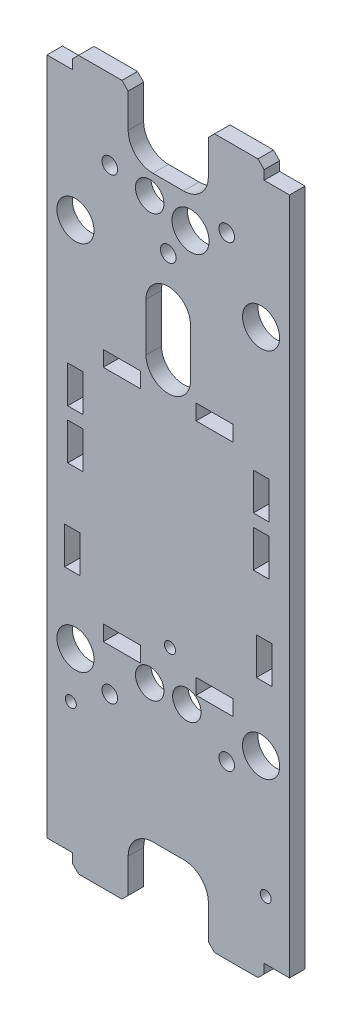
ISO-10303-21;
HEADER;
FILE_DESCRIPTION(('STEP AP214'),'2;1');
FILE_NAME('part.step','',(''),(''),'','','');
FILE_SCHEMA(('AUTOMOTIVE_DESIGN { 1 0 10303 214 1 1 1 1 }'));
ENDSEC;
DATA;
#1=APPLICATION_CONTEXT('core data for automotive mechanical design processes');
#2=APPLICATION_PROTOCOL_DEFINITION('international standard','automotive_design',2000,#1);
#3=PRODUCT_CONTEXT('',#1,'mechanical');
#4=PRODUCT('Part','Part','',(#3));
#5=PRODUCT_RELATED_PRODUCT_CATEGORY('part','',(#4));
#6=PRODUCT_DEFINITION_FORMATION('','',#4);
#7=PRODUCT_DEFINITION_CONTEXT('part definition',#1,'design');
#8=PRODUCT_DEFINITION('design','',#6,#7);
#9=PRODUCT_DEFINITION_SHAPE('','',#8);
#10=(LENGTH_UNIT() NAMED_UNIT(*) SI_UNIT(.MILLI.,.METRE.));
#11=(NAMED_UNIT(*) PLANE_ANGLE_UNIT() SI_UNIT($,.RADIAN.));
#12=(NAMED_UNIT(*) SI_UNIT($,.STERADIAN.) SOLID_ANGLE_UNIT());
#13=UNCERTAINTY_MEASURE_WITH_UNIT(LENGTH_MEASURE(1.E-05),#10,'distance_accuracy_value','');
#14=(GEOMETRIC_REPRESENTATION_CONTEXT(3) GLOBAL_UNCERTAINTY_ASSIGNED_CONTEXT((#13)) GLOBAL_UNIT_ASSIGNED_CONTEXT((#10,
#11,#12)) REPRESENTATION_CONTEXT('',''));
#15=CARTESIAN_POINT('',(0.,0.,0.));
#16=DIRECTION('',(0.,0.,1.));
#17=DIRECTION('',(1.,0.,0.));
#18=AXIS2_PLACEMENT_3D('',#15,#16,#17);
#19=CARTESIAN_POINT('',(-24.892,72.771,3.175));
#20=DIRECTION('',(0.,-1.,0.));
#21=DIRECTION('',(0.,0.,-1.));
#22=AXIS2_PLACEMENT_3D('',#19,#20,#21);
#23=PLANE('',#22);
#24=DIRECTION('',(-1.,0.,0.));
#25=VECTOR('',#24,1.);
#26=CARTESIAN_POINT('',(-24.892,72.771,3.175));
#27=LINE('',#26,#25);
#28=CARTESIAN_POINT('',(-9.49959999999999,72.771,3.175));
#29=VERTEX_POINT('',#28);
#30=CARTESIAN_POINT('',(-18.415,72.771,3.175));
#31=VERTEX_POINT('',#30);
#32=EDGE_CURVE('E1320',#29,#31,#27,.T.);
#33=ORIENTED_EDGE('',*,*,#32,.F.);
#34=DIRECTION('',(0.,0.,-1.));
#35=VECTOR('',#34,1.);
#36=CARTESIAN_POINT('',(-9.49959999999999,72.771,3.175));
#37=LINE('',#36,#35);
#38=CARTESIAN_POINT('',(-9.49959999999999,72.771,0.));
#39=VERTEX_POINT('',#38);
#40=EDGE_CURVE('E1378',#29,#39,#37,.T.);
#41=ORIENTED_EDGE('',*,*,#40,.T.);
#42=DIRECTION('',(-1.,0.,0.));
#43=VECTOR('',#42,1.);
#44=CARTESIAN_POINT('',(-24.892,72.771,0.));
#45=LINE('',#44,#43);
#46=CARTESIAN_POINT('',(-18.415,72.771,0.));
#47=VERTEX_POINT('',#46);
#48=EDGE_CURVE('E1337',#39,#47,#45,.T.);
#49=ORIENTED_EDGE('',*,*,#48,.T.);
#50=DIRECTION('',(0.,0.,1.));
#51=VECTOR('',#50,1.);
#52=CARTESIAN_POINT('',(-18.415,72.771,3.175));
#53=LINE('',#52,#51);
#54=EDGE_CURVE('E1374',#47,#31,#53,.T.);
#55=ORIENTED_EDGE('',*,*,#54,.T.);
#56=EDGE_LOOP('',(#33,#41,#49,#55));
#57=FACE_BOUND('',#56,.T.);
#58=ADVANCED_FACE('F42',(#57),#23,.F.);
#59=CARTESIAN_POINT('',(-24.892,-72.771,3.175));
#60=DIRECTION('',(0.,1.,0.));
#61=DIRECTION('',(0.,0.,1.));
#62=AXIS2_PLACEMENT_3D('',#59,#60,#61);
#63=PLANE('',#62);
#64=DIRECTION('',(1.,0.,0.));
#65=VECTOR('',#64,1.);
#66=CARTESIAN_POINT('',(-24.892,-72.771,0.));
#67=LINE('',#66,#65);
#68=CARTESIAN_POINT('',(9.49959999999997,-72.771,0.));
#69=VERTEX_POINT('',#68);
#70=CARTESIAN_POINT('',(18.415,-72.771,0.));
#71=VERTEX_POINT('',#70);
#72=EDGE_CURVE('E1346',#69,#71,#67,.T.);
#73=ORIENTED_EDGE('',*,*,#72,.T.);
#74=DIRECTION('',(0.,0.,1.));
#75=VECTOR('',#74,1.);
#76=CARTESIAN_POINT('',(18.415,-72.771,3.175));
#77=LINE('',#76,#75);
#78=CARTESIAN_POINT('',(18.415,-72.771,3.175));
#79=VERTEX_POINT('',#78);
#80=EDGE_CURVE('E1465',#71,#79,#77,.T.);
#81=ORIENTED_EDGE('',*,*,#80,.T.);
#82=DIRECTION('',(1.,0.,0.));
#83=VECTOR('',#82,1.);
#84=CARTESIAN_POINT('',(-24.892,-72.771,3.175));
#85=LINE('',#84,#83);
#86=CARTESIAN_POINT('',(9.49959999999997,-72.771,3.175));
#87=VERTEX_POINT('',#86);
#88=EDGE_CURVE('E1329',#87,#79,#85,.T.);
#89=ORIENTED_EDGE('',*,*,#88,.F.);
#90=DIRECTION('',(0.,0.,-1.));
#91=VECTOR('',#90,1.);
#92=CARTESIAN_POINT('',(9.49959999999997,-72.771,3.175));
#93=LINE('',#92,#91);
#94=EDGE_CURVE('E1461',#87,#69,#93,.T.);
#95=ORIENTED_EDGE('',*,*,#94,.T.);
#96=EDGE_LOOP('',(#73,#81,#89,#95));
#97=FACE_BOUND('',#96,.T.);
#98=ADVANCED_FACE('F1486',(#97),#63,.F.);
#99=CARTESIAN_POINT('',(24.892,72.771,3.175));
#100=DIRECTION('',(-1.,0.,0.));
#101=DIRECTION('',(0.,-1.,0.));
#102=AXIS2_PLACEMENT_3D('',#99,#100,#101);
#103=PLANE('',#102);
#104=DIRECTION('',(0.,1.,0.));
#105=VECTOR('',#104,1.);
#106=CARTESIAN_POINT('',(24.892,72.771,0.));
#107=LINE('',#106,#105);
#108=CARTESIAN_POINT('',(24.892,-69.596,0.));
#109=VERTEX_POINT('',#108);
#110=CARTESIAN_POINT('',(24.892,69.596,0.));
#111=VERTEX_POINT('',#110);
#112=EDGE_CURVE('E1315',#109,#111,#107,.T.);
#113=ORIENTED_EDGE('',*,*,#112,.T.);
#114=DIRECTION('',(0.,0.,1.));
#115=VECTOR('',#114,1.);
#116=CARTESIAN_POINT('',(24.892,69.596,3.175));
#117=LINE('',#116,#115);
#118=CARTESIAN_POINT('',(24.892,69.596,3.175));
#119=VERTEX_POINT('',#118);
#120=EDGE_CURVE('E1311',#111,#119,#117,.T.);
#121=ORIENTED_EDGE('',*,*,#120,.T.);
#122=DIRECTION('',(0.,1.,0.));
#123=VECTOR('',#122,1.);
#124=CARTESIAN_POINT('',(24.892,72.771,3.175));
#125=LINE('',#124,#123);
#126=CARTESIAN_POINT('',(24.892,-69.596,3.175));
#127=VERTEX_POINT('',#126);
#128=EDGE_CURVE('E1316',#127,#119,#125,.T.);
#129=ORIENTED_EDGE('',*,*,#128,.F.);
#130=DIRECTION('',(0.,0.,-1.));
#131=VECTOR('',#130,1.);
#132=CARTESIAN_POINT('',(24.892,-69.596,3.175));
#133=LINE('',#132,#131);
#134=EDGE_CURVE('E1296',#127,#109,#133,.T.);
#135=ORIENTED_EDGE('',*,*,#134,.T.);
#136=EDGE_LOOP('',(#113,#121,#129,#135));
#137=FACE_BOUND('',#136,.T.);
#138=ADVANCED_FACE('F1578',(#137),#103,.F.);
#139=CARTESIAN_POINT('',(18.415,72.771,0.));
#140=VERTEX_POINT('',#139);
#141=CARTESIAN_POINT('',(9.49959999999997,72.771,0.));
#142=VERTEX_POINT('',#141);
#143=EDGE_CURVE('E1338',#140,#142,#45,.T.);
#144=ORIENTED_EDGE('',*,*,#143,.T.);
#145=DIRECTION('',(0.,0.,1.));
#146=VECTOR('',#145,1.);
#147=CARTESIAN_POINT('',(9.49959999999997,72.771,3.175));
#148=LINE('',#147,#146);
#149=CARTESIAN_POINT('',(9.49959999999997,72.771,3.175));
#150=VERTEX_POINT('',#149);
#151=EDGE_CURVE('E1438',#142,#150,#148,.T.);
#152=ORIENTED_EDGE('',*,*,#151,.T.);
#153=CARTESIAN_POINT('',(18.415,72.771,3.175));
#154=VERTEX_POINT('',#153);
#155=EDGE_CURVE('E1322',#154,#150,#27,.T.);
#156=ORIENTED_EDGE('',*,*,#155,.F.);
#157=DIRECTION('',(0.,0.,-1.));
#158=VECTOR('',#157,1.);
#159=CARTESIAN_POINT('',(18.415,72.771,3.175));
#160=LINE('',#159,#158);
#161=EDGE_CURVE('E1434',#154,#140,#160,.T.);
#162=ORIENTED_EDGE('',*,*,#161,.T.);
#163=EDGE_LOOP('',(#144,#152,#156,#162));
#164=FACE_BOUND('',#163,.T.);
#165=ADVANCED_FACE('F1573',(#164),#23,.F.);
#166=CARTESIAN_POINT('',(-24.892,72.771,3.175));
#167=DIRECTION('',(1.,0.,0.));
#168=DIRECTION('',(0.,1.,0.));
#169=AXIS2_PLACEMENT_3D('',#166,#167,#168);
#170=PLANE('',#169);
#171=DIRECTION('',(0.,-1.,0.));
#172=VECTOR('',#171,1.);
#173=CARTESIAN_POINT('',(-24.892,72.771,3.175));
#174=LINE('',#173,#172);
#175=CARTESIAN_POINT('',(-24.892,69.596,3.175));
#176=VERTEX_POINT('',#175);
#177=CARTESIAN_POINT('',(-24.892,-69.596,3.175));
#178=VERTEX_POINT('',#177);
#179=EDGE_CURVE('E1325',#176,#178,#174,.T.);
#180=ORIENTED_EDGE('',*,*,#179,.F.);
#181=DIRECTION('',(0.,0.,-1.));
#182=VECTOR('',#181,1.);
#183=CARTESIAN_POINT('',(-24.892,69.596,3.175));
#184=LINE('',#183,#182);
#185=CARTESIAN_POINT('',(-24.892,69.596,0.));
#186=VERTEX_POINT('',#185);
#187=EDGE_CURVE('E1307',#176,#186,#184,.T.);
#188=ORIENTED_EDGE('',*,*,#187,.T.);
#189=DIRECTION('',(0.,-1.,0.));
#190=VECTOR('',#189,1.);
#191=CARTESIAN_POINT('',(-24.892,72.771,0.));
#192=LINE('',#191,#190);
#193=CARTESIAN_POINT('',(-24.892,-69.596,0.));
#194=VERTEX_POINT('',#193);
#195=EDGE_CURVE('E1342',#186,#194,#192,.T.);
#196=ORIENTED_EDGE('',*,*,#195,.T.);
#197=DIRECTION('',(0.,0.,1.));
#198=VECTOR('',#197,1.);
#199=CARTESIAN_POINT('',(-24.892,-69.596,3.175));
#200=LINE('',#199,#198);
#201=EDGE_CURVE('E1303',#194,#178,#200,.T.);
#202=ORIENTED_EDGE('',*,*,#201,.T.);
#203=EDGE_LOOP('',(#180,#188,#196,#202));
#204=FACE_BOUND('',#203,.T.);
#205=ADVANCED_FACE('F1514',(#204),#170,.F.);
#206=CARTESIAN_POINT('',(-18.415,-72.771,3.175));
#207=VERTEX_POINT('',#206);
#208=CARTESIAN_POINT('',(-9.49959999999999,-72.771,3.175));
#209=VERTEX_POINT('',#208);
#210=EDGE_CURVE('E1333',#207,#209,#85,.T.);
#211=ORIENTED_EDGE('',*,*,#210,.F.);
#212=DIRECTION('',(0.,0.,-1.));
#213=VECTOR('',#212,1.);
#214=CARTESIAN_POINT('',(-18.415,-72.771,3.175));
#215=LINE('',#214,#213);
#216=CARTESIAN_POINT('',(-18.415,-72.771,0.));
#217=VERTEX_POINT('',#216);
#218=EDGE_CURVE('E1451',#207,#217,#215,.T.);
#219=ORIENTED_EDGE('',*,*,#218,.T.);
#220=CARTESIAN_POINT('',(-9.49959999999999,-72.771,0.));
#221=VERTEX_POINT('',#220);
#222=EDGE_CURVE('E1321',#217,#221,#67,.T.);
#223=ORIENTED_EDGE('',*,*,#222,.T.);
#224=DIRECTION('',(0.,0.,1.));
#225=VECTOR('',#224,1.);
#226=CARTESIAN_POINT('',(-9.49959999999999,-72.771,3.175));
#227=LINE('',#226,#225);
#228=EDGE_CURVE('E1447',#221,#209,#227,.T.);
#229=ORIENTED_EDGE('',*,*,#228,.T.);
#230=EDGE_LOOP('',(#211,#219,#223,#229));
#231=FACE_BOUND('',#230,.T.);
#232=ADVANCED_FACE('F1531',(#231),#63,.F.);
#233=CARTESIAN_POINT('',(0.,0.,3.175));
#234=DIRECTION('',(0.,0.,1.));
#235=DIRECTION('',(1.,0.,0.));
#236=AXIS2_PLACEMENT_3D('',#233,#234,#235);
#237=PLANE('',#236);
#238=DIRECTION('',(0.,1.,0.));
#239=VECTOR('',#238,1.);
#240=CARTESIAN_POINT('',(-18.0975,-11.9755642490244,3.175));
#241=LINE('',#240,#239);
#242=CARTESIAN_POINT('',(-18.0975,-19.5955642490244,3.175));
#243=VERTEX_POINT('',#242);
#244=CARTESIAN_POINT('',(-18.0975,-11.9755642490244,3.175));
#245=VERTEX_POINT('',#244);
#246=EDGE_CURVE('E526',#243,#245,#241,.T.);
#247=ORIENTED_EDGE('',*,*,#246,.F.);
#248=DIRECTION('',(1.,0.,0.));
#249=VECTOR('',#248,1.);
#250=CARTESIAN_POINT('',(-21.2725,-19.5955642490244,3.175));
#251=LINE('',#250,#249);
#252=CARTESIAN_POINT('',(-21.2725,-19.5955642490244,3.175));
#253=VERTEX_POINT('',#252);
#254=EDGE_CURVE('E547',#253,#243,#251,.T.);
#255=ORIENTED_EDGE('',*,*,#254,.F.);
#256=DIRECTION('',(0.,-1.,0.));
#257=VECTOR('',#256,1.);
#258=CARTESIAN_POINT('',(-21.2725,-11.9755642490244,3.175));
#259=LINE('',#258,#257);
#260=CARTESIAN_POINT('',(-21.2725,-11.9755642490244,3.175));
#261=VERTEX_POINT('',#260);
#262=EDGE_CURVE('E551',#261,#253,#259,.T.);
#263=ORIENTED_EDGE('',*,*,#262,.F.);
#264=DIRECTION('',(-1.,0.,0.));
#265=VECTOR('',#264,1.);
#266=CARTESIAN_POINT('',(-21.2725,-11.9755642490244,3.175));
#267=LINE('',#266,#265);
#268=EDGE_CURVE('E560',#245,#261,#267,.T.);
#269=ORIENTED_EDGE('',*,*,#268,.F.);
#270=EDGE_LOOP('',(#247,#255,#263,#269));
#271=FACE_BOUND('',#270,.T.);
#272=DIRECTION('',(0.,1.,0.));
#273=VECTOR('',#272,1.);
#274=CARTESIAN_POINT('',(13.335,-25.7484771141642,3.175));
#275=LINE('',#274,#273);
#276=CARTESIAN_POINT('',(13.335,-28.9234771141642,3.175));
#277=VERTEX_POINT('',#276);
#278=CARTESIAN_POINT('',(13.335,-25.7484771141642,3.175));
#279=VERTEX_POINT('',#278);
#280=EDGE_CURVE('E594',#277,#279,#275,.T.);
#281=ORIENTED_EDGE('',*,*,#280,.F.);
#282=DIRECTION('',(1.,0.,0.));
#283=VECTOR('',#282,1.);
#284=CARTESIAN_POINT('',(5.715,-28.9234771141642,3.175));
#285=LINE('',#284,#283);
#286=CARTESIAN_POINT('',(5.715,-28.9234771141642,3.175));
#287=VERTEX_POINT('',#286);
#288=EDGE_CURVE('E581',#287,#277,#285,.T.);
#289=ORIENTED_EDGE('',*,*,#288,.F.);
#290=DIRECTION('',(0.,-1.,0.));
#291=VECTOR('',#290,1.);
#292=CARTESIAN_POINT('',(5.715,-25.7484771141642,3.175));
#293=LINE('',#292,#291);
#294=CARTESIAN_POINT('',(5.715,-25.7484771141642,3.175));
#295=VERTEX_POINT('',#294);
#296=EDGE_CURVE('E602',#295,#287,#293,.T.);
#297=ORIENTED_EDGE('',*,*,#296,.F.);
#298=DIRECTION('',(-1.,0.,0.));
#299=VECTOR('',#298,1.);
#300=CARTESIAN_POINT('',(5.715,-25.7484771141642,3.175));
#301=LINE('',#300,#299);
#302=EDGE_CURVE('E597',#279,#295,#301,.T.);
#303=ORIENTED_EDGE('',*,*,#302,.F.);
#304=EDGE_LOOP('',(#281,#289,#297,#303));
#305=FACE_BOUND('',#304,.T.);
#306=DIRECTION('',(0.,1.,0.));
#307=VECTOR('',#306,1.);
#308=CARTESIAN_POINT('',(-5.715,-25.7484771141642,3.175));
#309=LINE('',#308,#307);
#310=CARTESIAN_POINT('',(-5.715,-28.9234771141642,3.175));
#311=VERTEX_POINT('',#310);
#312=CARTESIAN_POINT('',(-5.715,-25.7484771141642,3.175));
#313=VERTEX_POINT('',#312);
#314=EDGE_CURVE('E638',#311,#313,#309,.T.);
#315=ORIENTED_EDGE('',*,*,#314,.F.);
#316=DIRECTION('',(1.,0.,0.));
#317=VECTOR('',#316,1.);
#318=CARTESIAN_POINT('',(-13.335,-28.9234771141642,3.175));
#319=LINE('',#318,#317);
#320=CARTESIAN_POINT('',(-13.335,-28.9234771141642,3.175));
#321=VERTEX_POINT('',#320);
#322=EDGE_CURVE('E625',#321,#311,#319,.T.);
#323=ORIENTED_EDGE('',*,*,#322,.F.);
#324=DIRECTION('',(0.,-1.,0.));
#325=VECTOR('',#324,1.);
#326=CARTESIAN_POINT('',(-13.335,-25.7484771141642,3.175));
#327=LINE('',#326,#325);
#328=CARTESIAN_POINT('',(-13.335,-25.7484771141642,3.175));
#329=VERTEX_POINT('',#328);
#330=EDGE_CURVE('E646',#329,#321,#327,.T.);
#331=ORIENTED_EDGE('',*,*,#330,.F.);
#332=DIRECTION('',(-1.,0.,0.));
#333=VECTOR('',#332,1.);
#334=CARTESIAN_POINT('',(-13.335,-25.7484771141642,3.175));
#335=LINE('',#334,#333);
#336=EDGE_CURVE('E641',#313,#329,#335,.T.);
#337=ORIENTED_EDGE('',*,*,#336,.F.);
#338=EDGE_LOOP('',(#315,#323,#331,#337));
#339=FACE_BOUND('',#338,.T.);
#340=DIRECTION('',(0.,1.,0.));
#341=VECTOR('',#340,1.);
#342=CARTESIAN_POINT('',(21.2725,-11.9755642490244,3.175));
#343=LINE('',#342,#341);
#344=CARTESIAN_POINT('',(21.2725,-19.5955642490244,3.175));
#345=VERTEX_POINT('',#344);
#346=CARTESIAN_POINT('',(21.2725,-11.9755642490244,3.175));
#347=VERTEX_POINT('',#346);
#348=EDGE_CURVE('E682',#345,#347,#343,.T.);
#349=ORIENTED_EDGE('',*,*,#348,.F.);
#350=DIRECTION('',(1.,0.,0.));
#351=VECTOR('',#350,1.);
#352=CARTESIAN_POINT('',(21.2725,-19.5955642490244,3.175));
#353=LINE('',#352,#351);
#354=CARTESIAN_POINT('',(18.0975,-19.5955642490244,3.175));
#355=VERTEX_POINT('',#354);
#356=EDGE_CURVE('E669',#355,#345,#353,.T.);
#357=ORIENTED_EDGE('',*,*,#356,.F.);
#358=DIRECTION('',(0.,-1.,0.));
#359=VECTOR('',#358,1.);
#360=CARTESIAN_POINT('',(18.0975,-11.9755642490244,3.175));
#361=LINE('',#360,#359);
#362=CARTESIAN_POINT('',(18.0975,-11.9755642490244,3.175));
#363=VERTEX_POINT('',#362);
#364=EDGE_CURVE('E689',#363,#355,#361,.T.);
#365=ORIENTED_EDGE('',*,*,#364,.F.);
#366=DIRECTION('',(-1.,0.,0.));
#367=VECTOR('',#366,1.);
#368=CARTESIAN_POINT('',(21.2725,-11.9755642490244,3.175));
#369=LINE('',#368,#367);
#370=EDGE_CURVE('E685',#347,#363,#369,.T.);
#371=ORIENTED_EDGE('',*,*,#370,.F.);
#372=EDGE_LOOP('',(#349,#357,#365,#371));
#373=FACE_BOUND('',#372,.T.);
#374=CARTESIAN_POINT('',(-19.05,43.18,3.175));
#375=DIRECTION('',(0.,0.,1.));
#376=DIRECTION('',(1.,0.,0.));
#377=AXIS2_PLACEMENT_3D('',#374,#375,#376);
#378=CIRCLE('',#377,3.81);
#379=CARTESIAN_POINT('',(-15.24,43.18,3.175));
#380=VERTEX_POINT('',#379);
#381=EDGE_CURVE('E720',#380,#380,#378,.T.);
#382=ORIENTED_EDGE('',*,*,#381,.F.);
#383=EDGE_LOOP('',(#382));
#384=FACE_BOUND('',#383,.T.);
#385=CARTESIAN_POINT('',(19.05,-33.02,3.175));
#386=DIRECTION('',(0.,0.,1.));
#387=DIRECTION('',(1.,0.,0.));
#388=AXIS2_PLACEMENT_3D('',#385,#386,#387);
#389=CIRCLE('',#388,3.81);
#390=CARTESIAN_POINT('',(22.86,-33.02,3.175));
#391=VERTEX_POINT('',#390);
#392=EDGE_CURVE('E711',#391,#391,#389,.T.);
#393=ORIENTED_EDGE('',*,*,#392,.F.);
#394=EDGE_LOOP('',(#393));
#395=FACE_BOUND('',#394,.T.);
#396=CARTESIAN_POINT('',(-19.05,-33.02,3.175));
#397=DIRECTION('',(0.,0.,1.));
#398=DIRECTION('',(1.,0.,0.));
#399=AXIS2_PLACEMENT_3D('',#396,#397,#398);
#400=CIRCLE('',#399,3.81);
#401=CARTESIAN_POINT('',(-15.24,-33.02,3.175));
#402=VERTEX_POINT('',#401);
#403=EDGE_CURVE('E570',#402,#402,#400,.T.);
#404=ORIENTED_EDGE('',*,*,#403,.F.);
#405=EDGE_LOOP('',(#404));
#406=FACE_BOUND('',#405,.T.);
#407=CARTESIAN_POINT('',(19.05,43.18,3.175));
#408=DIRECTION('',(0.,0.,1.));
#409=DIRECTION('',(1.,0.,0.));
#410=AXIS2_PLACEMENT_3D('',#407,#408,#409);
#411=CIRCLE('',#410,3.81);
#412=CARTESIAN_POINT('',(22.86,43.18,3.175));
#413=VERTEX_POINT('',#412);
#414=EDGE_CURVE('E719',#413,#413,#411,.T.);
#415=ORIENTED_EDGE('',*,*,#414,.F.);
#416=EDGE_LOOP('',(#415));
#417=FACE_BOUND('',#416,.T.);
#418=CARTESIAN_POINT('',(-3.81,55.118,3.175));
#419=DIRECTION('',(0.,0.,1.));
#420=DIRECTION('',(1.,0.,0.));
#421=AXIS2_PLACEMENT_3D('',#418,#419,#420);
#422=CIRCLE('',#421,2.921);
#423=CARTESIAN_POINT('',(-0.889,55.118,3.175));
#424=VERTEX_POINT('',#423);
#425=EDGE_CURVE('E752',#424,#424,#422,.T.);
#426=ORIENTED_EDGE('',*,*,#425,.F.);
#427=EDGE_LOOP('',(#426));
#428=FACE_BOUND('',#427,.T.);
#429=CARTESIAN_POINT('',(3.81000000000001,-31.496,3.175));
#430=DIRECTION('',(0.,0.,1.));
#431=DIRECTION('',(1.,0.,0.));
#432=AXIS2_PLACEMENT_3D('',#429,#430,#431);
#433=CIRCLE('',#432,2.921);
#434=CARTESIAN_POINT('',(6.73100000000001,-31.496,3.175));
#435=VERTEX_POINT('',#434);
#436=EDGE_CURVE('E743',#435,#435,#433,.T.);
#437=ORIENTED_EDGE('',*,*,#436,.F.);
#438=EDGE_LOOP('',(#437));
#439=FACE_BOUND('',#438,.T.);
#440=CARTESIAN_POINT('',(-3.80999999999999,-31.496,3.175));
#441=DIRECTION('',(0.,0.,1.));
#442=DIRECTION('',(1.,0.,0.));
#443=AXIS2_PLACEMENT_3D('',#440,#441,#442);
#444=CIRCLE('',#443,2.921);
#445=CARTESIAN_POINT('',(-0.888999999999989,-31.496,3.175));
#446=VERTEX_POINT('',#445);
#447=EDGE_CURVE('E735',#446,#446,#444,.T.);
#448=ORIENTED_EDGE('',*,*,#447,.F.);
#449=EDGE_LOOP('',(#448));
#450=FACE_BOUND('',#449,.T.);
#451=CARTESIAN_POINT('',(4.572,53.086,3.175));
#452=DIRECTION('',(0.,0.,1.));
#453=DIRECTION('',(1.,0.,0.));
#454=AXIS2_PLACEMENT_3D('',#451,#452,#453);
#455=CIRCLE('',#454,3.81);
#456=CARTESIAN_POINT('',(8.382,53.086,3.175));
#457=VERTEX_POINT('',#456);
#458=EDGE_CURVE('E751',#457,#457,#455,.T.);
#459=ORIENTED_EDGE('',*,*,#458,.F.);
#460=EDGE_LOOP('',(#459));
#461=FACE_BOUND('',#460,.T.);
#462=CARTESIAN_POINT('',(0.,36.322,3.175));
#463=DIRECTION('',(0.,0.,1.));
#464=DIRECTION('',(1.,0.,0.));
#465=AXIS2_PLACEMENT_3D('',#462,#463,#464);
#466=CIRCLE('',#465,4.572);
#467=CARTESIAN_POINT('',(4.572,36.322,3.175));
#468=VERTEX_POINT('',#467);
#469=CARTESIAN_POINT('',(-4.572,36.322,3.175));
#470=VERTEX_POINT('',#469);
#471=EDGE_CURVE('E767',#468,#470,#466,.T.);
#472=ORIENTED_EDGE('',*,*,#471,.F.);
#473=DIRECTION('',(0.,1.,0.));
#474=VECTOR('',#473,1.);
#475=CARTESIAN_POINT('',(4.572,36.322,3.175));
#476=LINE('',#475,#474);
#477=CARTESIAN_POINT('',(4.572,26.416,3.175));
#478=VERTEX_POINT('',#477);
#479=EDGE_CURVE('E776',#478,#468,#476,.T.);
#480=ORIENTED_EDGE('',*,*,#479,.F.);
#481=CARTESIAN_POINT('',(0.,26.416,3.175));
#482=DIRECTION('',(0.,0.,1.));
#483=DIRECTION('',(1.,0.,0.));
#484=AXIS2_PLACEMENT_3D('',#481,#482,#483);
#485=CIRCLE('',#484,4.572);
#486=CARTESIAN_POINT('',(-4.572,26.416,3.175));
#487=VERTEX_POINT('',#486);
#488=EDGE_CURVE('E795',#487,#478,#485,.T.);
#489=ORIENTED_EDGE('',*,*,#488,.F.);
#490=DIRECTION('',(0.,-1.,0.));
#491=VECTOR('',#490,1.);
#492=CARTESIAN_POINT('',(-4.572,36.322,3.175));
#493=LINE('',#492,#491);
#494=EDGE_CURVE('E791',#470,#487,#493,.T.);
#495=ORIENTED_EDGE('',*,*,#494,.F.);
#496=EDGE_LOOP('',(#472,#480,#489,#495));
#497=FACE_BOUND('',#496,.T.);
#498=DIRECTION('',(0.,-1.,0.));
#499=VECTOR('',#498,1.);
#500=CARTESIAN_POINT('',(-20.6375,-0.804710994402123,3.175));
#501=LINE('',#500,#499);
#502=CARTESIAN_POINT('',(-20.6375,6.81528900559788,3.175));
#503=VERTEX_POINT('',#502);
#504=CARTESIAN_POINT('',(-20.6375,-0.804710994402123,3.175));
#505=VERTEX_POINT('',#504);
#506=EDGE_CURVE('E805',#503,#505,#501,.T.);
#507=ORIENTED_EDGE('',*,*,#506,.F.);
#508=DIRECTION('',(-1.,0.,0.));
#509=VECTOR('',#508,1.);
#510=CARTESIAN_POINT('',(-20.6375,6.81528900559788,3.175));
#511=LINE('',#510,#509);
#512=CARTESIAN_POINT('',(-17.4625,6.81528900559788,3.175));
#513=VERTEX_POINT('',#512);
#514=EDGE_CURVE('E998',#513,#503,#511,.T.);
#515=ORIENTED_EDGE('',*,*,#514,.F.);
#516=DIRECTION('',(0.,1.,0.));
#517=VECTOR('',#516,1.);
#518=CARTESIAN_POINT('',(-17.4625,-0.804710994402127,3.175));
#519=LINE('',#518,#517);
#520=CARTESIAN_POINT('',(-17.4625,-0.804710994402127,3.175));
#521=VERTEX_POINT('',#520);
#522=EDGE_CURVE('E1017',#521,#513,#519,.T.);
#523=ORIENTED_EDGE('',*,*,#522,.F.);
#524=DIRECTION('',(1.,0.,0.));
#525=VECTOR('',#524,1.);
#526=CARTESIAN_POINT('',(-20.6375,-0.804710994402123,3.175));
#527=LINE('',#526,#525);
#528=EDGE_CURVE('E1013',#505,#521,#527,.T.);
#529=ORIENTED_EDGE('',*,*,#528,.F.);
#530=EDGE_LOOP('',(#507,#515,#523,#529));
#531=FACE_BOUND('',#530,.T.);
#532=DIRECTION('',(0.,1.,0.));
#533=VECTOR('',#532,1.);
#534=CARTESIAN_POINT('',(20.6375,-0.804710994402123,3.175));
#535=LINE('',#534,#533);
#536=CARTESIAN_POINT('',(20.6375,-0.804710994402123,3.175));
#537=VERTEX_POINT('',#536);
#538=CARTESIAN_POINT('',(20.6375,6.81528900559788,3.175));
#539=VERTEX_POINT('',#538);
#540=EDGE_CURVE('E967',#537,#539,#535,.T.);
#541=ORIENTED_EDGE('',*,*,#540,.F.);
#542=DIRECTION('',(1.,0.,0.));
#543=VECTOR('',#542,1.);
#544=CARTESIAN_POINT('',(20.6375,-0.804710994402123,3.175));
#545=LINE('',#544,#543);
#546=CARTESIAN_POINT('',(17.4625,-0.804710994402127,3.175));
#547=VERTEX_POINT('',#546);
#548=EDGE_CURVE('E954',#547,#537,#545,.T.);
#549=ORIENTED_EDGE('',*,*,#548,.F.);
#550=DIRECTION('',(0.,-1.,0.));
#551=VECTOR('',#550,1.);
#552=CARTESIAN_POINT('',(17.4625,-0.804710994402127,3.175));
#553=LINE('',#552,#551);
#554=CARTESIAN_POINT('',(17.4625,6.81528900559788,3.175));
#555=VERTEX_POINT('',#554);
#556=EDGE_CURVE('E975',#555,#547,#553,.T.);
#557=ORIENTED_EDGE('',*,*,#556,.F.);
#558=DIRECTION('',(-1.,0.,0.));
#559=VECTOR('',#558,1.);
#560=CARTESIAN_POINT('',(20.6375,6.81528900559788,3.175));
#561=LINE('',#560,#559);
#562=EDGE_CURVE('E970',#539,#555,#561,.T.);
#563=ORIENTED_EDGE('',*,*,#562,.F.);
#564=EDGE_LOOP('',(#541,#549,#557,#563));
#565=FACE_BOUND('',#564,.T.);
#566=DIRECTION('',(0.,1.,0.));
#567=VECTOR('',#566,1.);
#568=CARTESIAN_POINT('',(20.6375,16.9752890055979,3.175));
#569=LINE('',#568,#567);
#570=CARTESIAN_POINT('',(20.6375,9.35528900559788,3.175));
#571=VERTEX_POINT('',#570);
#572=CARTESIAN_POINT('',(20.6375,16.9752890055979,3.175));
#573=VERTEX_POINT('',#572);
#574=EDGE_CURVE('E923',#571,#573,#569,.T.);
#575=ORIENTED_EDGE('',*,*,#574,.F.);
#576=DIRECTION('',(1.,0.,0.));
#577=VECTOR('',#576,1.);
#578=CARTESIAN_POINT('',(20.6375,9.35528900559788,3.175));
#579=LINE('',#578,#577);
#580=CARTESIAN_POINT('',(17.4625,9.35528900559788,3.175));
#581=VERTEX_POINT('',#580);
#582=EDGE_CURVE('E910',#581,#571,#579,.T.);
#583=ORIENTED_EDGE('',*,*,#582,.F.);
#584=DIRECTION('',(0.,-1.,0.));
#585=VECTOR('',#584,1.);
#586=CARTESIAN_POINT('',(17.4625,16.9752890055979,3.175));
#587=LINE('',#586,#585);
#588=CARTESIAN_POINT('',(17.4625,16.9752890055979,3.175));
#589=VERTEX_POINT('',#588);
#590=EDGE_CURVE('E931',#589,#581,#587,.T.);
#591=ORIENTED_EDGE('',*,*,#590,.F.);
#592=DIRECTION('',(-1.,0.,0.));
#593=VECTOR('',#592,1.);
#594=CARTESIAN_POINT('',(20.6375,16.9752890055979,3.175));
#595=LINE('',#594,#593);
#596=EDGE_CURVE('E926',#573,#589,#595,.T.);
#597=ORIENTED_EDGE('',*,*,#596,.F.);
#598=EDGE_LOOP('',(#575,#583,#591,#597));
#599=FACE_BOUND('',#598,.T.);
#600=DIRECTION('',(0.,1.,0.));
#601=VECTOR('',#600,1.);
#602=CARTESIAN_POINT('',(13.335,23.0199327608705,3.175));
#603=LINE('',#602,#601);
#604=CARTESIAN_POINT('',(13.335,19.8449327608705,3.175));
#605=VERTEX_POINT('',#604);
#606=CARTESIAN_POINT('',(13.335,23.0199327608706,3.175));
#607=VERTEX_POINT('',#606);
#608=EDGE_CURVE('E879',#605,#607,#603,.T.);
#609=ORIENTED_EDGE('',*,*,#608,.F.);
#610=DIRECTION('',(1.,0.,0.));
#611=VECTOR('',#610,1.);
#612=CARTESIAN_POINT('',(5.715,19.8449327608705,3.175));
#613=LINE('',#612,#611);
#614=CARTESIAN_POINT('',(5.715,19.8449327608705,3.175));
#615=VERTEX_POINT('',#614);
#616=EDGE_CURVE('E866',#615,#605,#613,.T.);
#617=ORIENTED_EDGE('',*,*,#616,.F.);
#618=DIRECTION('',(0.,-1.,0.));
#619=VECTOR('',#618,1.);
#620=CARTESIAN_POINT('',(5.715,23.0199327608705,3.175));
#621=LINE('',#620,#619);
#622=CARTESIAN_POINT('',(5.715,23.0199327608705,3.175));
#623=VERTEX_POINT('',#622);
#624=EDGE_CURVE('E887',#623,#615,#621,.T.);
#625=ORIENTED_EDGE('',*,*,#624,.F.);
#626=DIRECTION('',(-1.,0.,0.));
#627=VECTOR('',#626,1.);
#628=CARTESIAN_POINT('',(5.715,23.0199327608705,3.175));
#629=LINE('',#628,#627);
#630=EDGE_CURVE('E882',#607,#623,#629,.T.);
#631=ORIENTED_EDGE('',*,*,#630,.F.);
#632=EDGE_LOOP('',(#609,#617,#625,#631));
#633=FACE_BOUND('',#632,.T.);
#634=DIRECTION('',(0.,1.,0.));
#635=VECTOR('',#634,1.);
#636=CARTESIAN_POINT('',(-5.715,23.0199327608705,3.175));
#637=LINE('',#636,#635);
#638=CARTESIAN_POINT('',(-5.715,19.8449327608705,3.175));
#639=VERTEX_POINT('',#638);
#640=CARTESIAN_POINT('',(-5.715,23.0199327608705,3.175));
#641=VERTEX_POINT('',#640);
#642=EDGE_CURVE('E833',#639,#641,#637,.T.);
#643=ORIENTED_EDGE('',*,*,#642,.F.);
#644=DIRECTION('',(1.,0.,0.));
#645=VECTOR('',#644,1.);
#646=CARTESIAN_POINT('',(-13.335,19.8449327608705,3.175));
#647=LINE('',#646,#645);
#648=CARTESIAN_POINT('',(-13.335,19.8449327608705,3.175));
#649=VERTEX_POINT('',#648);
#650=EDGE_CURVE('E820',#649,#639,#647,.T.);
#651=ORIENTED_EDGE('',*,*,#650,.F.);
#652=DIRECTION('',(0.,-1.,0.));
#653=VECTOR('',#652,1.);
#654=CARTESIAN_POINT('',(-13.335,23.0199327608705,3.175));
#655=LINE('',#654,#653);
#656=CARTESIAN_POINT('',(-13.335,23.0199327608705,3.175));
#657=VERTEX_POINT('',#656);
#658=EDGE_CURVE('E841',#657,#649,#655,.T.);
#659=ORIENTED_EDGE('',*,*,#658,.F.);
#660=DIRECTION('',(-1.,0.,0.));
#661=VECTOR('',#660,1.);
#662=CARTESIAN_POINT('',(-13.335,23.0199327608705,3.175));
#663=LINE('',#662,#661);
#664=EDGE_CURVE('E836',#641,#657,#663,.T.);
#665=ORIENTED_EDGE('',*,*,#664,.F.);
#666=EDGE_LOOP('',(#643,#651,#659,#665));
#667=FACE_BOUND('',#666,.T.);
#668=DIRECTION('',(0.,1.,0.));
#669=VECTOR('',#668,1.);
#670=CARTESIAN_POINT('',(-17.4625,16.9752890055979,3.175));
#671=LINE('',#670,#669);
#672=CARTESIAN_POINT('',(-17.4625,9.35528900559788,3.175));
#673=VERTEX_POINT('',#672);
#674=CARTESIAN_POINT('',(-17.4625,16.9752890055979,3.175));
#675=VERTEX_POINT('',#674);
#676=EDGE_CURVE('E851',#673,#675,#671,.T.);
#677=ORIENTED_EDGE('',*,*,#676,.F.);
#678=DIRECTION('',(1.,0.,0.));
#679=VECTOR('',#678,1.);
#680=CARTESIAN_POINT('',(-20.6375,9.35528900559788,3.175));
#681=LINE('',#680,#679);
#682=CARTESIAN_POINT('',(-20.6375,9.35528900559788,3.175));
#683=VERTEX_POINT('',#682);
#684=EDGE_CURVE('E1040',#683,#673,#681,.T.);
#685=ORIENTED_EDGE('',*,*,#684,.F.);
#686=DIRECTION('',(0.,-1.,0.));
#687=VECTOR('',#686,1.);
#688=CARTESIAN_POINT('',(-20.6375,16.9752890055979,3.175));
#689=LINE('',#688,#687);
#690=CARTESIAN_POINT('',(-20.6375,16.9752890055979,3.175));
#691=VERTEX_POINT('',#690);
#692=EDGE_CURVE('E1059',#691,#683,#689,.T.);
#693=ORIENTED_EDGE('',*,*,#692,.F.);
#694=DIRECTION('',(-1.,0.,0.));
#695=VECTOR('',#694,1.);
#696=CARTESIAN_POINT('',(-20.6375,16.9752890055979,3.175));
#697=LINE('',#696,#695);
#698=EDGE_CURVE('E1055',#675,#691,#697,.T.);
#699=ORIENTED_EDGE('',*,*,#698,.F.);
#700=EDGE_LOOP('',(#677,#685,#693,#699));
#701=FACE_BOUND('',#700,.T.);
#702=CARTESIAN_POINT('',(-20.005,-42.91600002,3.175));
#703=DIRECTION('',(0.,0.,1.));
#704=DIRECTION('',(1.,0.,0.));
#705=AXIS2_PLACEMENT_3D('',#702,#703,#704);
#706=CIRCLE('',#705,1.1303);
#707=CARTESIAN_POINT('',(-18.8747,-42.91600002,3.175));
#708=VERTEX_POINT('',#707);
#709=EDGE_CURVE('E1069',#708,#708,#706,.T.);
#710=ORIENTED_EDGE('',*,*,#709,.F.);
#711=EDGE_LOOP('',(#710));
#712=FACE_BOUND('',#711,.T.);
#713=CARTESIAN_POINT('',(20.005,-57.526,3.175));
#714=DIRECTION('',(0.,0.,1.));
#715=DIRECTION('',(1.,0.,0.));
#716=AXIS2_PLACEMENT_3D('',#713,#714,#715);
#717=CIRCLE('',#716,1.1303);
#718=CARTESIAN_POINT('',(21.1353,-57.526,3.175));
#719=VERTEX_POINT('',#718);
#720=EDGE_CURVE('E1086',#719,#719,#717,.T.);
#721=ORIENTED_EDGE('',*,*,#720,.F.);
#722=EDGE_LOOP('',(#721));
#723=FACE_BOUND('',#722,.T.);
#724=CARTESIAN_POINT('',(0.351538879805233,-23.114,3.175));
#725=DIRECTION('',(0.,0.,1.));
#726=DIRECTION('',(1.,0.,0.));
#727=AXIS2_PLACEMENT_3D('',#724,#725,#726);
#728=CIRCLE('',#727,1.1303);
#729=CARTESIAN_POINT('',(1.48183887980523,-23.114,3.175));
#730=VERTEX_POINT('',#729);
#731=EDGE_CURVE('E1094',#730,#730,#728,.T.);
#732=ORIENTED_EDGE('',*,*,#731,.F.);
#733=EDGE_LOOP('',(#732));
#734=FACE_BOUND('',#733,.T.);
#735=CARTESIAN_POINT('',(-12.,56.436,3.175));
#736=DIRECTION('',(0.,0.,1.));
#737=DIRECTION('',(1.,0.,0.));
#738=AXIS2_PLACEMENT_3D('',#735,#736,#737);
#739=CIRCLE('',#738,1.6);
#740=CARTESIAN_POINT('',(-10.4,56.436,3.175));
#741=VERTEX_POINT('',#740);
#742=EDGE_CURVE('E1102',#741,#741,#739,.T.);
#743=ORIENTED_EDGE('',*,*,#742,.F.);
#744=EDGE_LOOP('',(#743));
#745=FACE_BOUND('',#744,.T.);
#746=CARTESIAN_POINT('',(12.,56.436,3.175));
#747=DIRECTION('',(0.,0.,1.));
#748=DIRECTION('',(1.,0.,0.));
#749=AXIS2_PLACEMENT_3D('',#746,#747,#748);
#750=CIRCLE('',#749,1.6);
#751=CARTESIAN_POINT('',(13.6,56.436,3.175));
#752=VERTEX_POINT('',#751);
#753=EDGE_CURVE('E1110',#752,#752,#750,.T.);
#754=ORIENTED_EDGE('',*,*,#753,.F.);
#755=EDGE_LOOP('',(#754));
#756=FACE_BOUND('',#755,.T.);
#757=CARTESIAN_POINT('',(12.,-37.564,3.175));
#758=DIRECTION('',(0.,0.,1.));
#759=DIRECTION('',(1.,0.,0.));
#760=AXIS2_PLACEMENT_3D('',#757,#758,#759);
#761=CIRCLE('',#760,1.6);
#762=CARTESIAN_POINT('',(13.6,-37.564,3.175));
#763=VERTEX_POINT('',#762);
#764=EDGE_CURVE('E1118',#763,#763,#761,.T.);
#765=ORIENTED_EDGE('',*,*,#764,.F.);
#766=EDGE_LOOP('',(#765));
#767=FACE_BOUND('',#766,.T.);
#768=CARTESIAN_POINT('',(-12.,-37.564,3.175));
#769=DIRECTION('',(0.,0.,1.));
#770=DIRECTION('',(1.,0.,0.));
#771=AXIS2_PLACEMENT_3D('',#768,#769,#770);
#772=CIRCLE('',#771,1.6);
#773=CARTESIAN_POINT('',(-10.4,-37.564,3.175));
#774=VERTEX_POINT('',#773);
#775=EDGE_CURVE('E1126',#774,#774,#772,.T.);
#776=ORIENTED_EDGE('',*,*,#775,.F.);
#777=EDGE_LOOP('',(#776));
#778=FACE_BOUND('',#777,.T.);
#779=CARTESIAN_POINT('',(0.,46.736,3.175));
#780=DIRECTION('',(0.,0.,1.));
#781=DIRECTION('',(1.,0.,0.));
#782=AXIS2_PLACEMENT_3D('',#779,#780,#781);
#783=CIRCLE('',#782,1.6);
#784=CARTESIAN_POINT('',(1.6,46.736,3.175));
#785=VERTEX_POINT('',#784);
#786=EDGE_CURVE('E1134',#785,#785,#783,.T.);
#787=ORIENTED_EDGE('',*,*,#786,.F.);
#788=EDGE_LOOP('',(#787));
#789=FACE_BOUND('',#788,.T.);
#790=DIRECTION('',(0.,1.,0.));
#791=VECTOR('',#790,1.);
#792=CARTESIAN_POINT('',(-8.22960000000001,75.946,3.175));
#793=LINE('',#792,#791);
#794=CARTESIAN_POINT('',(-8.2296,64.516,3.175));
#795=VERTEX_POINT('',#794);
#796=CARTESIAN_POINT('',(-8.22960000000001,71.501,3.175));
#797=VERTEX_POINT('',#796);
#798=EDGE_CURVE('E1289',#795,#797,#793,.T.);
#799=ORIENTED_EDGE('',*,*,#798,.T.);
#800=DIRECTION('',(0.707106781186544,-0.707106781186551,0.));
#801=VECTOR('',#800,1.);
#802=CARTESIAN_POINT('',(31.6357,31.6356999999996,3.175));
#803=LINE('',#802,#801);
#804=EDGE_CURVE('E1428',#797,#29,#803,.F.);
#805=ORIENTED_EDGE('',*,*,#804,.T.);
#806=ORIENTED_EDGE('',*,*,#32,.T.);
#807=DIRECTION('',(0.707106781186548,0.707106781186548,0.));
#808=VECTOR('',#807,1.);
#809=CARTESIAN_POINT('',(-45.593,45.593,3.175));
#810=LINE('',#809,#808);
#811=CARTESIAN_POINT('',(-19.685,71.501,3.175));
#812=VERTEX_POINT('',#811);
#813=EDGE_CURVE('E1425',#31,#812,#810,.F.);
#814=ORIENTED_EDGE('',*,*,#813,.T.);
#815=DIRECTION('',(0.,-1.,0.));
#816=VECTOR('',#815,1.);
#817=CARTESIAN_POINT('',(-19.685,75.946,3.175));
#818=LINE('',#817,#816);
#819=CARTESIAN_POINT('',(-19.685,69.596,3.175));
#820=VERTEX_POINT('',#819);
#821=EDGE_CURVE('E1247',#812,#820,#818,.T.);
#822=ORIENTED_EDGE('',*,*,#821,.T.);
#823=DIRECTION('',(-1.,0.,0.));
#824=VECTOR('',#823,1.);
#825=CARTESIAN_POINT('',(-30.099,69.596,3.175));
#826=LINE('',#825,#824);
#827=EDGE_CURVE('E1250',#820,#176,#826,.T.);
#828=ORIENTED_EDGE('',*,*,#827,.T.);
#829=ORIENTED_EDGE('',*,*,#179,.T.);
#830=DIRECTION('',(1.,0.,0.));
#831=VECTOR('',#830,1.);
#832=CARTESIAN_POINT('',(-30.099,-69.596,3.175));
#833=LINE('',#832,#831);
#834=CARTESIAN_POINT('',(-19.685,-69.596,3.175));
#835=VERTEX_POINT('',#834);
#836=EDGE_CURVE('E1261',#178,#835,#833,.T.);
#837=ORIENTED_EDGE('',*,*,#836,.T.);
#838=DIRECTION('',(0.,-1.,0.));
#839=VECTOR('',#838,1.);
#840=CARTESIAN_POINT('',(-19.685,-75.946,3.175));
#841=LINE('',#840,#839);
#842=CARTESIAN_POINT('',(-19.685,-71.501,3.175));
#843=VERTEX_POINT('',#842);
#844=EDGE_CURVE('E1265',#835,#843,#841,.T.);
#845=ORIENTED_EDGE('',*,*,#844,.T.);
#846=DIRECTION('',(-0.707106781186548,0.707106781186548,0.));
#847=VECTOR('',#846,1.);
#848=CARTESIAN_POINT('',(-45.593,-45.593,3.175));
#849=LINE('',#848,#847);
#850=EDGE_CURVE('E1418',#843,#207,#849,.F.);
#851=ORIENTED_EDGE('',*,*,#850,.T.);
#852=ORIENTED_EDGE('',*,*,#210,.T.);
#853=DIRECTION('',(-0.707106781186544,-0.707106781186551,0.));
#854=VECTOR('',#853,1.);
#855=CARTESIAN_POINT('',(31.6357,-31.6356999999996,3.175));
#856=LINE('',#855,#854);
#857=CARTESIAN_POINT('',(-8.22960000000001,-71.501,3.175));
#858=VERTEX_POINT('',#857);
#859=EDGE_CURVE('E1415',#209,#858,#856,.F.);
#860=ORIENTED_EDGE('',*,*,#859,.T.);
#861=DIRECTION('',(0.,1.,0.));
#862=VECTOR('',#861,1.);
#863=CARTESIAN_POINT('',(-8.22960000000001,-75.946,3.175));
#864=LINE('',#863,#862);
#865=CARTESIAN_POINT('',(-8.2296,-64.516,3.175));
#866=VERTEX_POINT('',#865);
#867=EDGE_CURVE('E1223',#858,#866,#864,.T.);
#868=ORIENTED_EDGE('',*,*,#867,.T.);
#869=CARTESIAN_POINT('',(-3.1496,-64.516,3.175));
#870=DIRECTION('',(0.,0.,-1.));
#871=DIRECTION('',(1.,0.,0.));
#872=AXIS2_PLACEMENT_3D('',#869,#870,#871);
#873=CIRCLE('',#872,5.08);
#874=CARTESIAN_POINT('',(-3.1496,-59.436,3.175));
#875=VERTEX_POINT('',#874);
#876=EDGE_CURVE('E1183',#866,#875,#873,.T.);
#877=ORIENTED_EDGE('',*,*,#876,.T.);
#878=DIRECTION('',(1.,0.,0.));
#879=VECTOR('',#878,1.);
#880=CARTESIAN_POINT('',(3.1496,-59.436,3.175));
#881=LINE('',#880,#879);
#882=CARTESIAN_POINT('',(3.1496,-59.436,3.175));
#883=VERTEX_POINT('',#882);
#884=EDGE_CURVE('E1187',#875,#883,#881,.T.);
#885=ORIENTED_EDGE('',*,*,#884,.T.);
#886=CARTESIAN_POINT('',(3.1496,-64.516,3.175));
#887=DIRECTION('',(0.,0.,-1.));
#888=DIRECTION('',(1.,0.,0.));
#889=AXIS2_PLACEMENT_3D('',#886,#887,#888);
#890=CIRCLE('',#889,5.08);
#891=CARTESIAN_POINT('',(8.2296,-64.516,3.175));
#892=VERTEX_POINT('',#891);
#893=EDGE_CURVE('E1192',#883,#892,#890,.T.);
#894=ORIENTED_EDGE('',*,*,#893,.T.);
#895=DIRECTION('',(0.,-1.,0.));
#896=VECTOR('',#895,1.);
#897=CARTESIAN_POINT('',(8.22959999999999,-75.946,3.175));
#898=LINE('',#897,#896);
#899=CARTESIAN_POINT('',(8.22959999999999,-71.501,3.175));
#900=VERTEX_POINT('',#899);
#901=EDGE_CURVE('E1219',#892,#900,#898,.T.);
#902=ORIENTED_EDGE('',*,*,#901,.T.);
#903=DIRECTION('',(-0.707106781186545,0.70710678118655,0.));
#904=VECTOR('',#903,1.);
#905=CARTESIAN_POINT('',(-31.6357,-31.6356999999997,3.175));
#906=LINE('',#905,#904);
#907=EDGE_CURVE('E1409',#900,#87,#906,.F.);
#908=ORIENTED_EDGE('',*,*,#907,.T.);
#909=ORIENTED_EDGE('',*,*,#88,.T.);
#910=DIRECTION('',(-0.707106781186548,-0.707106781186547,0.));
#911=VECTOR('',#910,1.);
#912=CARTESIAN_POINT('',(45.593,-45.5930000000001,3.175));
#913=LINE('',#912,#911);
#914=CARTESIAN_POINT('',(19.685,-71.501,3.175));
#915=VERTEX_POINT('',#914);
#916=EDGE_CURVE('E1412',#79,#915,#913,.F.);
#917=ORIENTED_EDGE('',*,*,#916,.T.);
#918=DIRECTION('',(0.,1.,0.));
#919=VECTOR('',#918,1.);
#920=CARTESIAN_POINT('',(19.685,-75.946,3.175));
#921=LINE('',#920,#919);
#922=CARTESIAN_POINT('',(19.685,-69.596,3.175));
#923=VERTEX_POINT('',#922);
#924=EDGE_CURVE('E1277',#915,#923,#921,.T.);
#925=ORIENTED_EDGE('',*,*,#924,.T.);
#926=DIRECTION('',(1.,0.,0.));
#927=VECTOR('',#926,1.);
#928=CARTESIAN_POINT('',(30.099,-69.596,3.175));
#929=LINE('',#928,#927);
#930=EDGE_CURVE('E1280',#923,#127,#929,.T.);
#931=ORIENTED_EDGE('',*,*,#930,.T.);
#932=ORIENTED_EDGE('',*,*,#128,.T.);
#933=DIRECTION('',(-1.,0.,0.));
#934=VECTOR('',#933,1.);
#935=CARTESIAN_POINT('',(30.099,69.596,3.175));
#936=LINE('',#935,#934);
#937=CARTESIAN_POINT('',(19.685,69.596,3.175));
#938=VERTEX_POINT('',#937);
#939=EDGE_CURVE('E1233',#119,#938,#936,.T.);
#940=ORIENTED_EDGE('',*,*,#939,.T.);
#941=DIRECTION('',(0.,1.,0.));
#942=VECTOR('',#941,1.);
#943=CARTESIAN_POINT('',(19.685,75.946,3.175));
#944=LINE('',#943,#942);
#945=CARTESIAN_POINT('',(19.685,71.501,3.175));
#946=VERTEX_POINT('',#945);
#947=EDGE_CURVE('E1230',#938,#946,#944,.T.);
#948=ORIENTED_EDGE('',*,*,#947,.T.);
#949=DIRECTION('',(0.707106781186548,-0.707106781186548,0.));
#950=VECTOR('',#949,1.);
#951=CARTESIAN_POINT('',(45.593,45.593,3.175));
#952=LINE('',#951,#950);
#953=EDGE_CURVE('E67',#946,#154,#952,.F.);
#954=ORIENTED_EDGE('',*,*,#953,.T.);
#955=ORIENTED_EDGE('',*,*,#155,.T.);
#956=DIRECTION('',(0.707106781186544,0.707106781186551,0.));
#957=VECTOR('',#956,1.);
#958=CARTESIAN_POINT('',(-31.6357,31.6356999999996,3.175));
#959=LINE('',#958,#957);
#960=CARTESIAN_POINT('',(8.22959999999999,71.501,3.175));
#961=VERTEX_POINT('',#960);
#962=EDGE_CURVE('E59',#150,#961,#959,.F.);
#963=ORIENTED_EDGE('',*,*,#962,.T.);
#964=DIRECTION('',(0.,-1.,0.));
#965=VECTOR('',#964,1.);
#966=CARTESIAN_POINT('',(8.22959999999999,75.946,3.175));
#967=LINE('',#966,#965);
#968=CARTESIAN_POINT('',(8.2296,64.516,3.175));
#969=VERTEX_POINT('',#968);
#970=EDGE_CURVE('E1293',#961,#969,#967,.T.);
#971=ORIENTED_EDGE('',*,*,#970,.T.);
#972=CARTESIAN_POINT('',(3.1496,64.516,3.175));
#973=DIRECTION('',(0.,0.,-1.));
#974=DIRECTION('',(-1.,0.,0.));
#975=AXIS2_PLACEMENT_3D('',#972,#973,#974);
#976=CIRCLE('',#975,5.08);
#977=CARTESIAN_POINT('',(3.1496,59.436,3.175));
#978=VERTEX_POINT('',#977);
#979=EDGE_CURVE('E1143',#969,#978,#976,.T.);
#980=ORIENTED_EDGE('',*,*,#979,.T.);
#981=DIRECTION('',(-1.,0.,0.));
#982=VECTOR('',#981,1.);
#983=CARTESIAN_POINT('',(3.1496,59.436,3.175));
#984=LINE('',#983,#982);
#985=CARTESIAN_POINT('',(-3.1496,59.436,3.175));
#986=VERTEX_POINT('',#985);
#987=EDGE_CURVE('E1147',#978,#986,#984,.T.);
#988=ORIENTED_EDGE('',*,*,#987,.T.);
#989=CARTESIAN_POINT('',(-3.1496,64.516,3.175));
#990=DIRECTION('',(0.,0.,-1.));
#991=DIRECTION('',(-1.,0.,0.));
#992=AXIS2_PLACEMENT_3D('',#989,#990,#991);
#993=CIRCLE('',#992,5.08);
#994=EDGE_CURVE('E1152',#986,#795,#993,.T.);
#995=ORIENTED_EDGE('',*,*,#994,.T.);
#996=EDGE_LOOP('',(#799,#805,#806,#814,#822,#828,#829,#837,#845,#851,#852,#860,#868,#877,#885,
#894,#902,#908,#909,#917,#925,#931,#932,#940,#948,#954,#955,#963,#971,#980,#988,#995));
#997=FACE_BOUND('',#996,.T.);
#998=ADVANCED_FACE('F1488',(#271,#305,#339,#373,#384,#395,#406,#417,#428,#439,#450,#461,#497,
#531,#565,#599,#633,#667,#701,#712,#723,#734,#745,#756,#767,#778,#789,#997),#237,.T.);
#999=CARTESIAN_POINT('',(0.,0.,0.));
#1000=DIRECTION('',(0.,0.,1.));
#1001=DIRECTION('',(1.,0.,0.));
#1002=AXIS2_PLACEMENT_3D('',#999,#1000,#1001);
#1003=PLANE('',#1002);
#1004=DIRECTION('',(1.,0.,0.));
#1005=VECTOR('',#1004,1.);
#1006=CARTESIAN_POINT('',(-21.2725,-19.5955642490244,0.));
#1007=LINE('',#1006,#1005);
#1008=CARTESIAN_POINT('',(-21.2725,-19.5955642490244,0.));
#1009=VERTEX_POINT('',#1008);
#1010=CARTESIAN_POINT('',(-18.0975,-19.5955642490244,0.));
#1011=VERTEX_POINT('',#1010);
#1012=EDGE_CURVE('E532',#1009,#1011,#1007,.T.);
#1013=ORIENTED_EDGE('',*,*,#1012,.T.);
#1014=DIRECTION('',(0.,1.,0.));
#1015=VECTOR('',#1014,1.);
#1016=CARTESIAN_POINT('',(-18.0975,-11.9755642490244,0.));
#1017=LINE('',#1016,#1015);
#1018=CARTESIAN_POINT('',(-18.0975,-11.9755642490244,0.));
#1019=VERTEX_POINT('',#1018);
#1020=EDGE_CURVE('E523',#1011,#1019,#1017,.T.);
#1021=ORIENTED_EDGE('',*,*,#1020,.T.);
#1022=DIRECTION('',(-1.,0.,0.));
#1023=VECTOR('',#1022,1.);
#1024=CARTESIAN_POINT('',(-21.2725,-11.9755642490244,0.));
#1025=LINE('',#1024,#1023);
#1026=CARTESIAN_POINT('',(-21.2725,-11.9755642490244,0.));
#1027=VERTEX_POINT('',#1026);
#1028=EDGE_CURVE('E536',#1019,#1027,#1025,.T.);
#1029=ORIENTED_EDGE('',*,*,#1028,.T.);
#1030=DIRECTION('',(0.,-1.,0.));
#1031=VECTOR('',#1030,1.);
#1032=CARTESIAN_POINT('',(-21.2725,-11.9755642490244,0.));
#1033=LINE('',#1032,#1031);
#1034=EDGE_CURVE('E541',#1027,#1009,#1033,.T.);
#1035=ORIENTED_EDGE('',*,*,#1034,.T.);
#1036=EDGE_LOOP('',(#1013,#1021,#1029,#1035));
#1037=FACE_BOUND('',#1036,.T.);
#1038=DIRECTION('',(1.,0.,0.));
#1039=VECTOR('',#1038,1.);
#1040=CARTESIAN_POINT('',(5.715,-28.9234771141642,0.));
#1041=LINE('',#1040,#1039);
#1042=CARTESIAN_POINT('',(5.715,-28.9234771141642,0.));
#1043=VERTEX_POINT('',#1042);
#1044=CARTESIAN_POINT('',(13.335,-28.9234771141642,0.));
#1045=VERTEX_POINT('',#1044);
#1046=EDGE_CURVE('E589',#1043,#1045,#1041,.T.);
#1047=ORIENTED_EDGE('',*,*,#1046,.T.);
#1048=DIRECTION('',(0.,1.,0.));
#1049=VECTOR('',#1048,1.);
#1050=CARTESIAN_POINT('',(13.335,-25.7484771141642,0.));
#1051=LINE('',#1050,#1049);
#1052=CARTESIAN_POINT('',(13.335,-25.7484771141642,0.));
#1053=VERTEX_POINT('',#1052);
#1054=EDGE_CURVE('E576',#1045,#1053,#1051,.T.);
#1055=ORIENTED_EDGE('',*,*,#1054,.T.);
#1056=DIRECTION('',(-1.,0.,0.));
#1057=VECTOR('',#1056,1.);
#1058=CARTESIAN_POINT('',(5.715,-25.7484771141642,0.));
#1059=LINE('',#1058,#1057);
#1060=CARTESIAN_POINT('',(5.715,-25.7484771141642,0.));
#1061=VERTEX_POINT('',#1060);
#1062=EDGE_CURVE('E580',#1053,#1061,#1059,.T.);
#1063=ORIENTED_EDGE('',*,*,#1062,.T.);
#1064=DIRECTION('',(0.,-1.,0.));
#1065=VECTOR('',#1064,1.);
#1066=CARTESIAN_POINT('',(5.715,-25.7484771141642,0.));
#1067=LINE('',#1066,#1065);
#1068=EDGE_CURVE('E585',#1061,#1043,#1067,.T.);
#1069=ORIENTED_EDGE('',*,*,#1068,.T.);
#1070=EDGE_LOOP('',(#1047,#1055,#1063,#1069));
#1071=FACE_BOUND('',#1070,.T.);
#1072=DIRECTION('',(1.,0.,0.));
#1073=VECTOR('',#1072,1.);
#1074=CARTESIAN_POINT('',(-13.335,-28.9234771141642,0.));
#1075=LINE('',#1074,#1073);
#1076=CARTESIAN_POINT('',(-13.335,-28.9234771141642,0.));
#1077=VERTEX_POINT('',#1076);
#1078=CARTESIAN_POINT('',(-5.715,-28.9234771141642,0.));
#1079=VERTEX_POINT('',#1078);
#1080=EDGE_CURVE('E633',#1077,#1079,#1075,.T.);
#1081=ORIENTED_EDGE('',*,*,#1080,.T.);
#1082=DIRECTION('',(0.,1.,0.));
#1083=VECTOR('',#1082,1.);
#1084=CARTESIAN_POINT('',(-5.715,-25.7484771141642,0.));
#1085=LINE('',#1084,#1083);
#1086=CARTESIAN_POINT('',(-5.715,-25.7484771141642,0.));
#1087=VERTEX_POINT('',#1086);
#1088=EDGE_CURVE('E620',#1079,#1087,#1085,.T.);
#1089=ORIENTED_EDGE('',*,*,#1088,.T.);
#1090=DIRECTION('',(-1.,0.,0.));
#1091=VECTOR('',#1090,1.);
#1092=CARTESIAN_POINT('',(-13.335,-25.7484771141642,0.));
#1093=LINE('',#1092,#1091);
#1094=CARTESIAN_POINT('',(-13.335,-25.7484771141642,0.));
#1095=VERTEX_POINT('',#1094);
#1096=EDGE_CURVE('E624',#1087,#1095,#1093,.T.);
#1097=ORIENTED_EDGE('',*,*,#1096,.T.);
#1098=DIRECTION('',(0.,-1.,0.));
#1099=VECTOR('',#1098,1.);
#1100=CARTESIAN_POINT('',(-13.335,-25.7484771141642,0.));
#1101=LINE('',#1100,#1099);
#1102=EDGE_CURVE('E629',#1095,#1077,#1101,.T.);
#1103=ORIENTED_EDGE('',*,*,#1102,.T.);
#1104=EDGE_LOOP('',(#1081,#1089,#1097,#1103));
#1105=FACE_BOUND('',#1104,.T.);
#1106=DIRECTION('',(1.,0.,0.));
#1107=VECTOR('',#1106,1.);
#1108=CARTESIAN_POINT('',(21.2725,-19.5955642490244,0.));
#1109=LINE('',#1108,#1107);
#1110=CARTESIAN_POINT('',(18.0975,-19.5955642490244,0.));
#1111=VERTEX_POINT('',#1110);
#1112=CARTESIAN_POINT('',(21.2725,-19.5955642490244,0.));
#1113=VERTEX_POINT('',#1112);
#1114=EDGE_CURVE('E677',#1111,#1113,#1109,.T.);
#1115=ORIENTED_EDGE('',*,*,#1114,.T.);
#1116=DIRECTION('',(0.,1.,0.));
#1117=VECTOR('',#1116,1.);
#1118=CARTESIAN_POINT('',(21.2725,-11.9755642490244,0.));
#1119=LINE('',#1118,#1117);
#1120=CARTESIAN_POINT('',(21.2725,-11.9755642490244,0.));
#1121=VERTEX_POINT('',#1120);
#1122=EDGE_CURVE('E664',#1113,#1121,#1119,.T.);
#1123=ORIENTED_EDGE('',*,*,#1122,.T.);
#1124=DIRECTION('',(-1.,0.,0.));
#1125=VECTOR('',#1124,1.);
#1126=CARTESIAN_POINT('',(21.2725,-11.9755642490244,0.));
#1127=LINE('',#1126,#1125);
#1128=CARTESIAN_POINT('',(18.0975,-11.9755642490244,0.));
#1129=VERTEX_POINT('',#1128);
#1130=EDGE_CURVE('E668',#1121,#1129,#1127,.T.);
#1131=ORIENTED_EDGE('',*,*,#1130,.T.);
#1132=DIRECTION('',(0.,-1.,0.));
#1133=VECTOR('',#1132,1.);
#1134=CARTESIAN_POINT('',(18.0975,-11.9755642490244,0.));
#1135=LINE('',#1134,#1133);
#1136=EDGE_CURVE('E673',#1129,#1111,#1135,.T.);
#1137=ORIENTED_EDGE('',*,*,#1136,.T.);
#1138=EDGE_LOOP('',(#1115,#1123,#1131,#1137));
#1139=FACE_BOUND('',#1138,.T.);
#1140=CARTESIAN_POINT('',(-19.05,43.18,0.));
#1141=DIRECTION('',(0.,0.,1.));
#1142=DIRECTION('',(1.,0.,0.));
#1143=AXIS2_PLACEMENT_3D('',#1140,#1141,#1142);
#1144=CIRCLE('',#1143,3.81);
#1145=CARTESIAN_POINT('',(-15.24,43.18,0.));
#1146=VERTEX_POINT('',#1145);
#1147=EDGE_CURVE('E715',#1146,#1146,#1144,.T.);
#1148=ORIENTED_EDGE('',*,*,#1147,.T.);
#1149=EDGE_LOOP('',(#1148));
#1150=FACE_BOUND('',#1149,.T.);
#1151=CARTESIAN_POINT('',(19.05,-33.02,0.));
#1152=DIRECTION('',(0.,0.,1.));
#1153=DIRECTION('',(1.,0.,0.));
#1154=AXIS2_PLACEMENT_3D('',#1151,#1152,#1153);
#1155=CIRCLE('',#1154,3.81);
#1156=CARTESIAN_POINT('',(22.86,-33.02,0.));
#1157=VERTEX_POINT('',#1156);
#1158=EDGE_CURVE('E724',#1157,#1157,#1155,.T.);
#1159=ORIENTED_EDGE('',*,*,#1158,.T.);
#1160=EDGE_LOOP('',(#1159));
#1161=FACE_BOUND('',#1160,.T.);
#1162=CARTESIAN_POINT('',(-19.05,-33.02,0.));
#1163=DIRECTION('',(0.,0.,1.));
#1164=DIRECTION('',(1.,0.,0.));
#1165=AXIS2_PLACEMENT_3D('',#1162,#1163,#1164);
#1166=CIRCLE('',#1165,3.81);
#1167=CARTESIAN_POINT('',(-15.24,-33.02,0.));
#1168=VERTEX_POINT('',#1167);
#1169=EDGE_CURVE('E707',#1168,#1168,#1166,.T.);
#1170=ORIENTED_EDGE('',*,*,#1169,.T.);
#1171=EDGE_LOOP('',(#1170));
#1172=FACE_BOUND('',#1171,.T.);
#1173=CARTESIAN_POINT('',(19.05,43.18,0.));
#1174=DIRECTION('',(0.,0.,1.));
#1175=DIRECTION('',(1.,0.,0.));
#1176=AXIS2_PLACEMENT_3D('',#1173,#1174,#1175);
#1177=CIRCLE('',#1176,3.81);
#1178=CARTESIAN_POINT('',(22.86,43.18,0.));
#1179=VERTEX_POINT('',#1178);
#1180=EDGE_CURVE('E731',#1179,#1179,#1177,.T.);
#1181=ORIENTED_EDGE('',*,*,#1180,.T.);
#1182=EDGE_LOOP('',(#1181));
#1183=FACE_BOUND('',#1182,.T.);
#1184=CARTESIAN_POINT('',(-3.81,55.118,0.));
#1185=DIRECTION('',(0.,0.,1.));
#1186=DIRECTION('',(1.,0.,0.));
#1187=AXIS2_PLACEMENT_3D('',#1184,#1185,#1186);
#1188=CIRCLE('',#1187,2.921);
#1189=CARTESIAN_POINT('',(-0.889,55.118,0.));
#1190=VERTEX_POINT('',#1189);
#1191=EDGE_CURVE('E747',#1190,#1190,#1188,.T.);
#1192=ORIENTED_EDGE('',*,*,#1191,.T.);
#1193=EDGE_LOOP('',(#1192));
#1194=FACE_BOUND('',#1193,.T.);
#1195=CARTESIAN_POINT('',(3.81000000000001,-31.496,0.));
#1196=DIRECTION('',(0.,0.,1.));
#1197=DIRECTION('',(1.,0.,0.));
#1198=AXIS2_PLACEMENT_3D('',#1195,#1196,#1197);
#1199=CIRCLE('',#1198,2.921);
#1200=CARTESIAN_POINT('',(6.73100000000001,-31.496,0.));
#1201=VERTEX_POINT('',#1200);
#1202=EDGE_CURVE('E756',#1201,#1201,#1199,.T.);
#1203=ORIENTED_EDGE('',*,*,#1202,.T.);
#1204=EDGE_LOOP('',(#1203));
#1205=FACE_BOUND('',#1204,.T.);
#1206=CARTESIAN_POINT('',(-3.80999999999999,-31.496,0.));
#1207=DIRECTION('',(0.,0.,1.));
#1208=DIRECTION('',(1.,0.,0.));
#1209=AXIS2_PLACEMENT_3D('',#1206,#1207,#1208);
#1210=CIRCLE('',#1209,2.921);
#1211=CARTESIAN_POINT('',(-0.888999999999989,-31.496,0.));
#1212=VERTEX_POINT('',#1211);
#1213=EDGE_CURVE('E739',#1212,#1212,#1210,.T.);
#1214=ORIENTED_EDGE('',*,*,#1213,.T.);
#1215=EDGE_LOOP('',(#1214));
#1216=FACE_BOUND('',#1215,.T.);
#1217=CARTESIAN_POINT('',(4.572,53.086,0.));
#1218=DIRECTION('',(0.,0.,1.));
#1219=DIRECTION('',(1.,0.,0.));
#1220=AXIS2_PLACEMENT_3D('',#1217,#1218,#1219);
#1221=CIRCLE('',#1220,3.81);
#1222=CARTESIAN_POINT('',(8.382,53.086,0.));
#1223=VERTEX_POINT('',#1222);
#1224=EDGE_CURVE('E763',#1223,#1223,#1221,.T.);
#1225=ORIENTED_EDGE('',*,*,#1224,.T.);
#1226=EDGE_LOOP('',(#1225));
#1227=FACE_BOUND('',#1226,.T.);
#1228=DIRECTION('',(0.,1.,0.));
#1229=VECTOR('',#1228,1.);
#1230=CARTESIAN_POINT('',(4.572,36.322,0.));
#1231=LINE('',#1230,#1229);
#1232=CARTESIAN_POINT('',(4.572,26.416,0.));
#1233=VERTEX_POINT('',#1232);
#1234=CARTESIAN_POINT('',(4.572,36.322,0.));
#1235=VERTEX_POINT('',#1234);
#1236=EDGE_CURVE('E784',#1233,#1235,#1231,.T.);
#1237=ORIENTED_EDGE('',*,*,#1236,.T.);
#1238=CARTESIAN_POINT('',(0.,36.322,0.));
#1239=DIRECTION('',(0.,0.,1.));
#1240=DIRECTION('',(1.,0.,0.));
#1241=AXIS2_PLACEMENT_3D('',#1238,#1239,#1240);
#1242=CIRCLE('',#1241,4.572);
#1243=CARTESIAN_POINT('',(-4.572,36.322,0.));
#1244=VERTEX_POINT('',#1243);
#1245=EDGE_CURVE('E771',#1235,#1244,#1242,.T.);
#1246=ORIENTED_EDGE('',*,*,#1245,.T.);
#1247=DIRECTION('',(0.,-1.,0.));
#1248=VECTOR('',#1247,1.);
#1249=CARTESIAN_POINT('',(-4.572,36.322,0.));
#1250=LINE('',#1249,#1248);
#1251=CARTESIAN_POINT('',(-4.572,26.416,0.));
#1252=VERTEX_POINT('',#1251);
#1253=EDGE_CURVE('E775',#1244,#1252,#1250,.T.);
#1254=ORIENTED_EDGE('',*,*,#1253,.T.);
#1255=CARTESIAN_POINT('',(0.,26.416,0.));
#1256=DIRECTION('',(0.,0.,1.));
#1257=DIRECTION('',(1.,0.,0.));
#1258=AXIS2_PLACEMENT_3D('',#1255,#1256,#1257);
#1259=CIRCLE('',#1258,4.572);
#1260=EDGE_CURVE('E780',#1252,#1233,#1259,.T.);
#1261=ORIENTED_EDGE('',*,*,#1260,.T.);
#1262=EDGE_LOOP('',(#1237,#1246,#1254,#1261));
#1263=FACE_BOUND('',#1262,.T.);
#1264=DIRECTION('',(-1.,0.,0.));
#1265=VECTOR('',#1264,1.);
#1266=CARTESIAN_POINT('',(-20.6375,6.81528900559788,0.));
#1267=LINE('',#1266,#1265);
#1268=CARTESIAN_POINT('',(-17.4625,6.81528900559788,0.));
#1269=VERTEX_POINT('',#1268);
#1270=CARTESIAN_POINT('',(-20.6375,6.81528900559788,0.));
#1271=VERTEX_POINT('',#1270);
#1272=EDGE_CURVE('E1006',#1269,#1271,#1267,.T.);
#1273=ORIENTED_EDGE('',*,*,#1272,.T.);
#1274=DIRECTION('',(0.,-1.,0.));
#1275=VECTOR('',#1274,1.);
#1276=CARTESIAN_POINT('',(-20.6375,-0.804710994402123,0.));
#1277=LINE('',#1276,#1275);
#1278=CARTESIAN_POINT('',(-20.6375,-0.804710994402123,0.));
#1279=VERTEX_POINT('',#1278);
#1280=EDGE_CURVE('E993',#1271,#1279,#1277,.T.);
#1281=ORIENTED_EDGE('',*,*,#1280,.T.);
#1282=DIRECTION('',(1.,0.,0.));
#1283=VECTOR('',#1282,1.);
#1284=CARTESIAN_POINT('',(-20.6375,-0.804710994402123,0.));
#1285=LINE('',#1284,#1283);
#1286=CARTESIAN_POINT('',(-17.4625,-0.804710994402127,0.));
#1287=VERTEX_POINT('',#1286);
#1288=EDGE_CURVE('E997',#1279,#1287,#1285,.T.);
#1289=ORIENTED_EDGE('',*,*,#1288,.T.);
#1290=DIRECTION('',(0.,1.,0.));
#1291=VECTOR('',#1290,1.);
#1292=CARTESIAN_POINT('',(-17.4625,-0.804710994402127,0.));
#1293=LINE('',#1292,#1291);
#1294=EDGE_CURVE('E1002',#1287,#1269,#1293,.T.);
#1295=ORIENTED_EDGE('',*,*,#1294,.T.);
#1296=EDGE_LOOP('',(#1273,#1281,#1289,#1295));
#1297=FACE_BOUND('',#1296,.T.);
#1298=DIRECTION('',(1.,0.,0.));
#1299=VECTOR('',#1298,1.);
#1300=CARTESIAN_POINT('',(20.6375,-0.804710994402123,0.));
#1301=LINE('',#1300,#1299);
#1302=CARTESIAN_POINT('',(17.4625,-0.804710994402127,0.));
#1303=VERTEX_POINT('',#1302);
#1304=CARTESIAN_POINT('',(20.6375,-0.804710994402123,0.));
#1305=VERTEX_POINT('',#1304);
#1306=EDGE_CURVE('E962',#1303,#1305,#1301,.T.);
#1307=ORIENTED_EDGE('',*,*,#1306,.T.);
#1308=DIRECTION('',(0.,1.,0.));
#1309=VECTOR('',#1308,1.);
#1310=CARTESIAN_POINT('',(20.6375,-0.804710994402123,0.));
#1311=LINE('',#1310,#1309);
#1312=CARTESIAN_POINT('',(20.6375,6.81528900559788,0.));
#1313=VERTEX_POINT('',#1312);
#1314=EDGE_CURVE('E949',#1305,#1313,#1311,.T.);
#1315=ORIENTED_EDGE('',*,*,#1314,.T.);
#1316=DIRECTION('',(-1.,0.,0.));
#1317=VECTOR('',#1316,1.);
#1318=CARTESIAN_POINT('',(20.6375,6.81528900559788,0.));
#1319=LINE('',#1318,#1317);
#1320=CARTESIAN_POINT('',(17.4625,6.81528900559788,0.));
#1321=VERTEX_POINT('',#1320);
#1322=EDGE_CURVE('E953',#1313,#1321,#1319,.T.);
#1323=ORIENTED_EDGE('',*,*,#1322,.T.);
#1324=DIRECTION('',(0.,-1.,0.));
#1325=VECTOR('',#1324,1.);
#1326=CARTESIAN_POINT('',(17.4625,-0.804710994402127,0.));
#1327=LINE('',#1326,#1325);
#1328=EDGE_CURVE('E958',#1321,#1303,#1327,.T.);
#1329=ORIENTED_EDGE('',*,*,#1328,.T.);
#1330=EDGE_LOOP('',(#1307,#1315,#1323,#1329));
#1331=FACE_BOUND('',#1330,.T.);
#1332=DIRECTION('',(1.,0.,0.));
#1333=VECTOR('',#1332,1.);
#1334=CARTESIAN_POINT('',(20.6375,9.35528900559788,0.));
#1335=LINE('',#1334,#1333);
#1336=CARTESIAN_POINT('',(17.4625,9.35528900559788,0.));
#1337=VERTEX_POINT('',#1336);
#1338=CARTESIAN_POINT('',(20.6375,9.35528900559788,0.));
#1339=VERTEX_POINT('',#1338);
#1340=EDGE_CURVE('E918',#1337,#1339,#1335,.T.);
#1341=ORIENTED_EDGE('',*,*,#1340,.T.);
#1342=DIRECTION('',(0.,1.,0.));
#1343=VECTOR('',#1342,1.);
#1344=CARTESIAN_POINT('',(20.6375,16.9752890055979,0.));
#1345=LINE('',#1344,#1343);
#1346=CARTESIAN_POINT('',(20.6375,16.9752890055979,0.));
#1347=VERTEX_POINT('',#1346);
#1348=EDGE_CURVE('E905',#1339,#1347,#1345,.T.);
#1349=ORIENTED_EDGE('',*,*,#1348,.T.);
#1350=DIRECTION('',(-1.,0.,0.));
#1351=VECTOR('',#1350,1.);
#1352=CARTESIAN_POINT('',(20.6375,16.9752890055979,0.));
#1353=LINE('',#1352,#1351);
#1354=CARTESIAN_POINT('',(17.4625,16.9752890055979,0.));
#1355=VERTEX_POINT('',#1354);
#1356=EDGE_CURVE('E909',#1347,#1355,#1353,.T.);
#1357=ORIENTED_EDGE('',*,*,#1356,.T.);
#1358=DIRECTION('',(0.,-1.,0.));
#1359=VECTOR('',#1358,1.);
#1360=CARTESIAN_POINT('',(17.4625,16.9752890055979,0.));
#1361=LINE('',#1360,#1359);
#1362=EDGE_CURVE('E914',#1355,#1337,#1361,.T.);
#1363=ORIENTED_EDGE('',*,*,#1362,.T.);
#1364=EDGE_LOOP('',(#1341,#1349,#1357,#1363));
#1365=FACE_BOUND('',#1364,.T.);
#1366=DIRECTION('',(1.,0.,0.));
#1367=VECTOR('',#1366,1.);
#1368=CARTESIAN_POINT('',(5.715,19.8449327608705,0.));
#1369=LINE('',#1368,#1367);
#1370=CARTESIAN_POINT('',(5.715,19.8449327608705,0.));
#1371=VERTEX_POINT('',#1370);
#1372=CARTESIAN_POINT('',(13.335,19.8449327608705,0.));
#1373=VERTEX_POINT('',#1372);
#1374=EDGE_CURVE('E874',#1371,#1373,#1369,.T.);
#1375=ORIENTED_EDGE('',*,*,#1374,.T.);
#1376=DIRECTION('',(0.,1.,0.));
#1377=VECTOR('',#1376,1.);
#1378=CARTESIAN_POINT('',(13.335,23.0199327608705,0.));
#1379=LINE('',#1378,#1377);
#1380=CARTESIAN_POINT('',(13.335,23.0199327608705,0.));
#1381=VERTEX_POINT('',#1380);
#1382=EDGE_CURVE('E861',#1373,#1381,#1379,.T.);
#1383=ORIENTED_EDGE('',*,*,#1382,.T.);
#1384=DIRECTION('',(-1.,0.,0.));
#1385=VECTOR('',#1384,1.);
#1386=CARTESIAN_POINT('',(5.715,23.0199327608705,0.));
#1387=LINE('',#1386,#1385);
#1388=CARTESIAN_POINT('',(5.715,23.0199327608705,0.));
#1389=VERTEX_POINT('',#1388);
#1390=EDGE_CURVE('E865',#1381,#1389,#1387,.T.);
#1391=ORIENTED_EDGE('',*,*,#1390,.T.);
#1392=DIRECTION('',(0.,-1.,0.));
#1393=VECTOR('',#1392,1.);
#1394=CARTESIAN_POINT('',(5.715,23.0199327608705,0.));
#1395=LINE('',#1394,#1393);
#1396=EDGE_CURVE('E870',#1389,#1371,#1395,.T.);
#1397=ORIENTED_EDGE('',*,*,#1396,.T.);
#1398=EDGE_LOOP('',(#1375,#1383,#1391,#1397));
#1399=FACE_BOUND('',#1398,.T.);
#1400=DIRECTION('',(1.,0.,0.));
#1401=VECTOR('',#1400,1.);
#1402=CARTESIAN_POINT('',(-13.335,19.8449327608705,0.));
#1403=LINE('',#1402,#1401);
#1404=CARTESIAN_POINT('',(-13.335,19.8449327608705,0.));
#1405=VERTEX_POINT('',#1404);
#1406=CARTESIAN_POINT('',(-5.715,19.8449327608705,0.));
#1407=VERTEX_POINT('',#1406);
#1408=EDGE_CURVE('E828',#1405,#1407,#1403,.T.);
#1409=ORIENTED_EDGE('',*,*,#1408,.T.);
#1410=DIRECTION('',(0.,1.,0.));
#1411=VECTOR('',#1410,1.);
#1412=CARTESIAN_POINT('',(-5.715,23.0199327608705,0.));
#1413=LINE('',#1412,#1411);
#1414=CARTESIAN_POINT('',(-5.715,23.0199327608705,0.));
#1415=VERTEX_POINT('',#1414);
#1416=EDGE_CURVE('E815',#1407,#1415,#1413,.T.);
#1417=ORIENTED_EDGE('',*,*,#1416,.T.);
#1418=DIRECTION('',(-1.,0.,0.));
#1419=VECTOR('',#1418,1.);
#1420=CARTESIAN_POINT('',(-13.335,23.0199327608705,0.));
#1421=LINE('',#1420,#1419);
#1422=CARTESIAN_POINT('',(-13.335,23.0199327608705,0.));
#1423=VERTEX_POINT('',#1422);
#1424=EDGE_CURVE('E819',#1415,#1423,#1421,.T.);
#1425=ORIENTED_EDGE('',*,*,#1424,.T.);
#1426=DIRECTION('',(0.,-1.,0.));
#1427=VECTOR('',#1426,1.);
#1428=CARTESIAN_POINT('',(-13.335,23.0199327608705,0.));
#1429=LINE('',#1428,#1427);
#1430=EDGE_CURVE('E824',#1423,#1405,#1429,.T.);
#1431=ORIENTED_EDGE('',*,*,#1430,.T.);
#1432=EDGE_LOOP('',(#1409,#1417,#1425,#1431));
#1433=FACE_BOUND('',#1432,.T.);
#1434=DIRECTION('',(1.,0.,0.));
#1435=VECTOR('',#1434,1.);
#1436=CARTESIAN_POINT('',(-20.6375,9.35528900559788,0.));
#1437=LINE('',#1436,#1435);
#1438=CARTESIAN_POINT('',(-20.6375,9.35528900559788,0.));
#1439=VERTEX_POINT('',#1438);
#1440=CARTESIAN_POINT('',(-17.4625,9.35528900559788,0.));
#1441=VERTEX_POINT('',#1440);
#1442=EDGE_CURVE('E1048',#1439,#1441,#1437,.T.);
#1443=ORIENTED_EDGE('',*,*,#1442,.T.);
#1444=DIRECTION('',(0.,1.,0.));
#1445=VECTOR('',#1444,1.);
#1446=CARTESIAN_POINT('',(-17.4625,16.9752890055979,0.));
#1447=LINE('',#1446,#1445);
#1448=CARTESIAN_POINT('',(-17.4625,16.9752890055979,0.));
#1449=VERTEX_POINT('',#1448);
#1450=EDGE_CURVE('E1035',#1441,#1449,#1447,.T.);
#1451=ORIENTED_EDGE('',*,*,#1450,.T.);
#1452=DIRECTION('',(-1.,0.,0.));
#1453=VECTOR('',#1452,1.);
#1454=CARTESIAN_POINT('',(-20.6375,16.9752890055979,0.));
#1455=LINE('',#1454,#1453);
#1456=CARTESIAN_POINT('',(-20.6375,16.9752890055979,0.));
#1457=VERTEX_POINT('',#1456);
#1458=EDGE_CURVE('E1039',#1449,#1457,#1455,.T.);
#1459=ORIENTED_EDGE('',*,*,#1458,.T.);
#1460=DIRECTION('',(0.,-1.,0.));
#1461=VECTOR('',#1460,1.);
#1462=CARTESIAN_POINT('',(-20.6375,16.9752890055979,0.));
#1463=LINE('',#1462,#1461);
#1464=EDGE_CURVE('E1044',#1457,#1439,#1463,.T.);
#1465=ORIENTED_EDGE('',*,*,#1464,.T.);
#1466=EDGE_LOOP('',(#1443,#1451,#1459,#1465));
#1467=FACE_BOUND('',#1466,.T.);
#1468=CARTESIAN_POINT('',(-20.005,-42.91600002,0.));
#1469=DIRECTION('',(0.,0.,1.));
#1470=DIRECTION('',(1.,0.,0.));
#1471=AXIS2_PLACEMENT_3D('',#1468,#1469,#1470);
#1472=CIRCLE('',#1471,1.1303);
#1473=CARTESIAN_POINT('',(-18.8747,-42.91600002,0.));
#1474=VERTEX_POINT('',#1473);
#1475=EDGE_CURVE('E1082',#1474,#1474,#1472,.T.);
#1476=ORIENTED_EDGE('',*,*,#1475,.T.);
#1477=EDGE_LOOP('',(#1476));
#1478=FACE_BOUND('',#1477,.T.);
#1479=CARTESIAN_POINT('',(20.005,-57.526,0.));
#1480=DIRECTION('',(0.,0.,1.));
#1481=DIRECTION('',(1.,0.,0.));
#1482=AXIS2_PLACEMENT_3D('',#1479,#1480,#1481);
#1483=CIRCLE('',#1482,1.1303);
#1484=CARTESIAN_POINT('',(21.1353,-57.526,0.));
#1485=VERTEX_POINT('',#1484);
#1486=EDGE_CURVE('E1090',#1485,#1485,#1483,.T.);
#1487=ORIENTED_EDGE('',*,*,#1486,.T.);
#1488=EDGE_LOOP('',(#1487));
#1489=FACE_BOUND('',#1488,.T.);
#1490=CARTESIAN_POINT('',(0.351538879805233,-23.114,0.));
#1491=DIRECTION('',(0.,0.,1.));
#1492=DIRECTION('',(1.,0.,0.));
#1493=AXIS2_PLACEMENT_3D('',#1490,#1491,#1492);
#1494=CIRCLE('',#1493,1.1303);
#1495=CARTESIAN_POINT('',(1.48183887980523,-23.114,0.));
#1496=VERTEX_POINT('',#1495);
#1497=EDGE_CURVE('E1098',#1496,#1496,#1494,.T.);
#1498=ORIENTED_EDGE('',*,*,#1497,.T.);
#1499=EDGE_LOOP('',(#1498));
#1500=FACE_BOUND('',#1499,.T.);
#1501=CARTESIAN_POINT('',(-12.,56.436,0.));
#1502=DIRECTION('',(0.,0.,1.));
#1503=DIRECTION('',(1.,0.,0.));
#1504=AXIS2_PLACEMENT_3D('',#1501,#1502,#1503);
#1505=CIRCLE('',#1504,1.6);
#1506=CARTESIAN_POINT('',(-10.4,56.436,0.));
#1507=VERTEX_POINT('',#1506);
#1508=EDGE_CURVE('E1106',#1507,#1507,#1505,.T.);
#1509=ORIENTED_EDGE('',*,*,#1508,.T.);
#1510=EDGE_LOOP('',(#1509));
#1511=FACE_BOUND('',#1510,.T.);
#1512=CARTESIAN_POINT('',(12.,56.436,0.));
#1513=DIRECTION('',(0.,0.,1.));
#1514=DIRECTION('',(1.,0.,0.));
#1515=AXIS2_PLACEMENT_3D('',#1512,#1513,#1514);
#1516=CIRCLE('',#1515,1.6);
#1517=CARTESIAN_POINT('',(13.6,56.436,0.));
#1518=VERTEX_POINT('',#1517);
#1519=EDGE_CURVE('E1114',#1518,#1518,#1516,.T.);
#1520=ORIENTED_EDGE('',*,*,#1519,.T.);
#1521=EDGE_LOOP('',(#1520));
#1522=FACE_BOUND('',#1521,.T.);
#1523=CARTESIAN_POINT('',(12.,-37.564,0.));
#1524=DIRECTION('',(0.,0.,1.));
#1525=DIRECTION('',(1.,0.,0.));
#1526=AXIS2_PLACEMENT_3D('',#1523,#1524,#1525);
#1527=CIRCLE('',#1526,1.6);
#1528=CARTESIAN_POINT('',(13.6,-37.564,0.));
#1529=VERTEX_POINT('',#1528);
#1530=EDGE_CURVE('E1122',#1529,#1529,#1527,.T.);
#1531=ORIENTED_EDGE('',*,*,#1530,.T.);
#1532=EDGE_LOOP('',(#1531));
#1533=FACE_BOUND('',#1532,.T.);
#1534=CARTESIAN_POINT('',(-12.,-37.564,0.));
#1535=DIRECTION('',(0.,0.,1.));
#1536=DIRECTION('',(1.,0.,0.));
#1537=AXIS2_PLACEMENT_3D('',#1534,#1535,#1536);
#1538=CIRCLE('',#1537,1.6);
#1539=CARTESIAN_POINT('',(-10.4,-37.564,0.));
#1540=VERTEX_POINT('',#1539);
#1541=EDGE_CURVE('E1130',#1540,#1540,#1538,.T.);
#1542=ORIENTED_EDGE('',*,*,#1541,.T.);
#1543=EDGE_LOOP('',(#1542));
#1544=FACE_BOUND('',#1543,.T.);
#1545=CARTESIAN_POINT('',(0.,46.736,0.));
#1546=DIRECTION('',(0.,0.,1.));
#1547=DIRECTION('',(1.,0.,0.));
#1548=AXIS2_PLACEMENT_3D('',#1545,#1546,#1547);
#1549=CIRCLE('',#1548,1.6);
#1550=CARTESIAN_POINT('',(1.6,46.736,0.));
#1551=VERTEX_POINT('',#1550);
#1552=EDGE_CURVE('E1138',#1551,#1551,#1549,.T.);
#1553=ORIENTED_EDGE('',*,*,#1552,.T.);
#1554=EDGE_LOOP('',(#1553));
#1555=FACE_BOUND('',#1554,.T.);
#1556=ORIENTED_EDGE('',*,*,#48,.F.);
#1557=DIRECTION('',(-0.707106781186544,0.707106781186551,0.));
#1558=VECTOR('',#1557,1.);
#1559=CARTESIAN_POINT('',(-9.49959999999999,72.771,0.));
#1560=LINE('',#1559,#1558);
#1561=CARTESIAN_POINT('',(-8.22960000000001,71.501,0.));
#1562=VERTEX_POINT('',#1561);
#1563=EDGE_CURVE('E1403',#39,#1562,#1560,.F.);
#1564=ORIENTED_EDGE('',*,*,#1563,.T.);
#1565=DIRECTION('',(0.,1.,0.));
#1566=VECTOR('',#1565,1.);
#1567=CARTESIAN_POINT('',(-8.22960000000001,75.946,0.));
#1568=LINE('',#1567,#1566);
#1569=CARTESIAN_POINT('',(-8.2296,64.516,0.));
#1570=VERTEX_POINT('',#1569);
#1571=EDGE_CURVE('E1246',#1570,#1562,#1568,.T.);
#1572=ORIENTED_EDGE('',*,*,#1571,.F.);
#1573=CARTESIAN_POINT('',(-3.1496,64.516,0.));
#1574=DIRECTION('',(0.,0.,-1.));
#1575=DIRECTION('',(-1.,0.,0.));
#1576=AXIS2_PLACEMENT_3D('',#1573,#1574,#1575);
#1577=CIRCLE('',#1576,5.08);
#1578=CARTESIAN_POINT('',(-3.1496,59.436,0.));
#1579=VERTEX_POINT('',#1578);
#1580=EDGE_CURVE('E1148',#1579,#1570,#1577,.T.);
#1581=ORIENTED_EDGE('',*,*,#1580,.F.);
#1582=DIRECTION('',(-1.,0.,0.));
#1583=VECTOR('',#1582,1.);
#1584=CARTESIAN_POINT('',(3.1496,59.436,0.));
#1585=LINE('',#1584,#1583);
#1586=CARTESIAN_POINT('',(3.1496,59.436,0.));
#1587=VERTEX_POINT('',#1586);
#1588=EDGE_CURVE('E1161',#1587,#1579,#1585,.T.);
#1589=ORIENTED_EDGE('',*,*,#1588,.F.);
#1590=CARTESIAN_POINT('',(3.1496,64.516,0.));
#1591=DIRECTION('',(0.,0.,-1.));
#1592=DIRECTION('',(-1.,0.,0.));
#1593=AXIS2_PLACEMENT_3D('',#1590,#1591,#1592);
#1594=CIRCLE('',#1593,5.08);
#1595=CARTESIAN_POINT('',(8.2296,64.516,0.));
#1596=VERTEX_POINT('',#1595);
#1597=EDGE_CURVE('E1157',#1596,#1587,#1594,.T.);
#1598=ORIENTED_EDGE('',*,*,#1597,.F.);
#1599=DIRECTION('',(0.,1.,0.));
#1600=VECTOR('',#1599,1.);
#1601=CARTESIAN_POINT('',(8.22959999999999,0.,0.));
#1602=LINE('',#1601,#1600);
#1603=CARTESIAN_POINT('',(8.22959999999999,71.501,0.));
#1604=VERTEX_POINT('',#1603);
#1605=EDGE_CURVE('E1350',#1596,#1604,#1602,.T.);
#1606=ORIENTED_EDGE('',*,*,#1605,.T.);
#1607=DIRECTION('',(-0.707106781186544,-0.707106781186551,0.));
#1608=VECTOR('',#1607,1.);
#1609=CARTESIAN_POINT('',(9.49959999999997,72.771,0.));
#1610=LINE('',#1609,#1608);
#1611=EDGE_CURVE('E1397',#1604,#142,#1610,.F.);
#1612=ORIENTED_EDGE('',*,*,#1611,.T.);
#1613=ORIENTED_EDGE('',*,*,#143,.F.);
#1614=DIRECTION('',(-0.707106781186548,0.707106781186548,0.));
#1615=VECTOR('',#1614,1.);
#1616=CARTESIAN_POINT('',(18.415,72.771,0.));
#1617=LINE('',#1616,#1615);
#1618=CARTESIAN_POINT('',(19.685,71.501,0.));
#1619=VERTEX_POINT('',#1618);
#1620=EDGE_CURVE('E1394',#140,#1619,#1617,.F.);
#1621=ORIENTED_EDGE('',*,*,#1620,.T.);
#1622=DIRECTION('',(0.,1.,0.));
#1623=VECTOR('',#1622,1.);
#1624=CARTESIAN_POINT('',(19.685,75.946,0.));
#1625=LINE('',#1624,#1623);
#1626=CARTESIAN_POINT('',(19.685,69.596,0.));
#1627=VERTEX_POINT('',#1626);
#1628=EDGE_CURVE('E1234',#1627,#1619,#1625,.T.);
#1629=ORIENTED_EDGE('',*,*,#1628,.F.);
#1630=DIRECTION('',(1.,0.,0.));
#1631=VECTOR('',#1630,1.);
#1632=CARTESIAN_POINT('',(0.,69.596,0.));
#1633=LINE('',#1632,#1631);
#1634=EDGE_CURVE('E1370',#1627,#111,#1633,.T.);
#1635=ORIENTED_EDGE('',*,*,#1634,.T.);
#1636=ORIENTED_EDGE('',*,*,#112,.F.);
#1637=DIRECTION('',(1.,0.,0.));
#1638=VECTOR('',#1637,1.);
#1639=CARTESIAN_POINT('',(30.099,-69.596,0.));
#1640=LINE('',#1639,#1638);
#1641=CARTESIAN_POINT('',(19.685,-69.596,0.));
#1642=VERTEX_POINT('',#1641);
#1643=EDGE_CURVE('E1226',#1642,#109,#1640,.T.);
#1644=ORIENTED_EDGE('',*,*,#1643,.F.);
#1645=DIRECTION('',(0.,-1.,0.));
#1646=VECTOR('',#1645,1.);
#1647=CARTESIAN_POINT('',(19.685,0.,0.));
#1648=LINE('',#1647,#1646);
#1649=CARTESIAN_POINT('',(19.685,-71.501,0.));
#1650=VERTEX_POINT('',#1649);
#1651=EDGE_CURVE('E1358',#1642,#1650,#1648,.T.);
#1652=ORIENTED_EDGE('',*,*,#1651,.T.);
#1653=DIRECTION('',(0.707106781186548,0.707106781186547,0.));
#1654=VECTOR('',#1653,1.);
#1655=CARTESIAN_POINT('',(18.415,-72.771,0.));
#1656=LINE('',#1655,#1654);
#1657=EDGE_CURVE('E1385',#1650,#71,#1656,.F.);
#1658=ORIENTED_EDGE('',*,*,#1657,.T.);
#1659=ORIENTED_EDGE('',*,*,#72,.F.);
#1660=DIRECTION('',(0.707106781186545,-0.70710678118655,0.));
#1661=VECTOR('',#1660,1.);
#1662=CARTESIAN_POINT('',(9.49959999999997,-72.771,0.));
#1663=LINE('',#1662,#1661);
#1664=CARTESIAN_POINT('',(8.22959999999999,-71.501,0.));
#1665=VERTEX_POINT('',#1664);
#1666=EDGE_CURVE('E1382',#69,#1665,#1663,.F.);
#1667=ORIENTED_EDGE('',*,*,#1666,.T.);
#1668=DIRECTION('',(0.,-1.,0.));
#1669=VECTOR('',#1668,1.);
#1670=CARTESIAN_POINT('',(8.22959999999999,-75.946,0.));
#1671=LINE('',#1670,#1669);
#1672=CARTESIAN_POINT('',(8.2296,-64.516,0.));
#1673=VERTEX_POINT('',#1672);
#1674=EDGE_CURVE('E1173',#1673,#1665,#1671,.T.);
#1675=ORIENTED_EDGE('',*,*,#1674,.F.);
#1676=CARTESIAN_POINT('',(3.1496,-64.516,0.));
#1677=DIRECTION('',(0.,0.,-1.));
#1678=DIRECTION('',(1.,0.,0.));
#1679=AXIS2_PLACEMENT_3D('',#1676,#1677,#1678);
#1680=CIRCLE('',#1679,5.08);
#1681=CARTESIAN_POINT('',(3.1496,-59.436,0.));
#1682=VERTEX_POINT('',#1681);
#1683=EDGE_CURVE('E1188',#1682,#1673,#1680,.T.);
#1684=ORIENTED_EDGE('',*,*,#1683,.F.);
#1685=DIRECTION('',(1.,0.,0.));
#1686=VECTOR('',#1685,1.);
#1687=CARTESIAN_POINT('',(3.1496,-59.436,0.));
#1688=LINE('',#1687,#1686);
#1689=CARTESIAN_POINT('',(-3.1496,-59.436,0.));
#1690=VERTEX_POINT('',#1689);
#1691=EDGE_CURVE('E1200',#1690,#1682,#1688,.T.);
#1692=ORIENTED_EDGE('',*,*,#1691,.F.);
#1693=CARTESIAN_POINT('',(-3.1496,-64.516,0.));
#1694=DIRECTION('',(0.,0.,-1.));
#1695=DIRECTION('',(1.,0.,0.));
#1696=AXIS2_PLACEMENT_3D('',#1693,#1694,#1695);
#1697=CIRCLE('',#1696,5.08);
#1698=CARTESIAN_POINT('',(-8.2296,-64.516,0.));
#1699=VERTEX_POINT('',#1698);
#1700=EDGE_CURVE('E1142',#1699,#1690,#1697,.T.);
#1701=ORIENTED_EDGE('',*,*,#1700,.F.);
#1702=DIRECTION('',(0.,-1.,0.));
#1703=VECTOR('',#1702,1.);
#1704=CARTESIAN_POINT('',(-8.22960000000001,0.,0.));
#1705=LINE('',#1704,#1703);
#1706=CARTESIAN_POINT('',(-8.22960000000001,-71.501,0.));
#1707=VERTEX_POINT('',#1706);
#1708=EDGE_CURVE('E1354',#1699,#1707,#1705,.T.);
#1709=ORIENTED_EDGE('',*,*,#1708,.T.);
#1710=DIRECTION('',(0.707106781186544,0.707106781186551,0.));
#1711=VECTOR('',#1710,1.);
#1712=CARTESIAN_POINT('',(-9.49959999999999,-72.771,0.));
#1713=LINE('',#1712,#1711);
#1714=EDGE_CURVE('E1388',#1707,#221,#1713,.F.);
#1715=ORIENTED_EDGE('',*,*,#1714,.T.);
#1716=ORIENTED_EDGE('',*,*,#222,.F.);
#1717=DIRECTION('',(0.707106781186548,-0.707106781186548,0.));
#1718=VECTOR('',#1717,1.);
#1719=CARTESIAN_POINT('',(-18.415,-72.771,0.));
#1720=LINE('',#1719,#1718);
#1721=CARTESIAN_POINT('',(-19.685,-71.501,0.));
#1722=VERTEX_POINT('',#1721);
#1723=EDGE_CURVE('E1391',#217,#1722,#1720,.F.);
#1724=ORIENTED_EDGE('',*,*,#1723,.T.);
#1725=DIRECTION('',(0.,-1.,0.));
#1726=VECTOR('',#1725,1.);
#1727=CARTESIAN_POINT('',(-19.685,-75.946,0.));
#1728=LINE('',#1727,#1726);
#1729=CARTESIAN_POINT('',(-19.685,-69.596,0.));
#1730=VERTEX_POINT('',#1729);
#1731=EDGE_CURVE('E1266',#1730,#1722,#1728,.T.);
#1732=ORIENTED_EDGE('',*,*,#1731,.F.);
#1733=DIRECTION('',(-1.,0.,0.));
#1734=VECTOR('',#1733,1.);
#1735=CARTESIAN_POINT('',(0.,-69.596,0.));
#1736=LINE('',#1735,#1734);
#1737=EDGE_CURVE('E1362',#1730,#194,#1736,.T.);
#1738=ORIENTED_EDGE('',*,*,#1737,.T.);
#1739=ORIENTED_EDGE('',*,*,#195,.F.);
#1740=DIRECTION('',(-1.,0.,0.));
#1741=VECTOR('',#1740,1.);
#1742=CARTESIAN_POINT('',(-30.099,69.596,0.));
#1743=LINE('',#1742,#1741);
#1744=CARTESIAN_POINT('',(-19.685,69.596,0.));
#1745=VERTEX_POINT('',#1744);
#1746=EDGE_CURVE('E1251',#1745,#186,#1743,.T.);
#1747=ORIENTED_EDGE('',*,*,#1746,.F.);
#1748=DIRECTION('',(0.,1.,0.));
#1749=VECTOR('',#1748,1.);
#1750=CARTESIAN_POINT('',(-19.685,0.,0.));
#1751=LINE('',#1750,#1749);
#1752=CARTESIAN_POINT('',(-19.685,71.501,0.));
#1753=VERTEX_POINT('',#1752);
#1754=EDGE_CURVE('E1366',#1745,#1753,#1751,.T.);
#1755=ORIENTED_EDGE('',*,*,#1754,.T.);
#1756=DIRECTION('',(-0.707106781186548,-0.707106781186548,0.));
#1757=VECTOR('',#1756,1.);
#1758=CARTESIAN_POINT('',(-18.415,72.771,0.));
#1759=LINE('',#1758,#1757);
#1760=EDGE_CURVE('E1400',#1753,#47,#1759,.F.);
#1761=ORIENTED_EDGE('',*,*,#1760,.T.);
#1762=EDGE_LOOP('',(#1556,#1564,#1572,#1581,#1589,#1598,#1606,#1612,#1613,#1621,#1629,#1635,
#1636,#1644,#1652,#1658,#1659,#1667,#1675,#1684,#1692,#1701,#1709,#1715,#1716,#1724,#1732,#1738,
#1739,#1747,#1755,#1761));
#1763=FACE_BOUND('',#1762,.T.);
#1764=ADVANCED_FACE('F543',(#1037,#1071,#1105,#1139,#1150,#1161,#1172,#1183,#1194,#1205,#1216,
#1227,#1263,#1297,#1331,#1365,#1399,#1433,#1467,#1478,#1489,#1500,#1511,#1522,#1533,#1544,#1555,
#1763),#1003,.F.);
#1765=CARTESIAN_POINT('',(-8.22960000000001,75.946,3.175));
#1766=DIRECTION('',(-1.,0.,0.));
#1767=DIRECTION('',(0.,0.,1.));
#1768=AXIS2_PLACEMENT_3D('',#1765,#1766,#1767);
#1769=PLANE('',#1768);
#1770=ORIENTED_EDGE('',*,*,#1571,.T.);
#1771=DIRECTION('',(0.,0.,1.));
#1772=VECTOR('',#1771,1.);
#1773=CARTESIAN_POINT('',(-8.22960000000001,71.501,3.175));
#1774=LINE('',#1773,#1772);
#1775=EDGE_CURVE('E1406',#1562,#797,#1774,.T.);
#1776=ORIENTED_EDGE('',*,*,#1775,.T.);
#1777=ORIENTED_EDGE('',*,*,#798,.F.);
#1778=DIRECTION('',(0.,0.,-1.));
#1779=VECTOR('',#1778,1.);
#1780=CARTESIAN_POINT('',(-8.2296,64.516,3.175));
#1781=LINE('',#1780,#1779);
#1782=EDGE_CURVE('E1169',#795,#1570,#1781,.T.);
#1783=ORIENTED_EDGE('',*,*,#1782,.T.);
#1784=EDGE_LOOP('',(#1770,#1776,#1777,#1783));
#1785=FACE_BOUND('',#1784,.T.);
#1786=ADVANCED_FACE('F1567',(#1785),#1769,.F.);
#1787=CARTESIAN_POINT('',(8.22959999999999,75.946,3.175));
#1788=DIRECTION('',(1.,0.,0.));
#1789=DIRECTION('',(0.,0.,-1.));
#1790=AXIS2_PLACEMENT_3D('',#1787,#1788,#1789);
#1791=PLANE('',#1790);
#1792=ORIENTED_EDGE('',*,*,#970,.F.);
#1793=DIRECTION('',(0.,0.,-1.));
#1794=VECTOR('',#1793,1.);
#1795=CARTESIAN_POINT('',(8.22959999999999,71.501,3.175));
#1796=LINE('',#1795,#1794);
#1797=EDGE_CURVE('E1441',#961,#1604,#1796,.T.);
#1798=ORIENTED_EDGE('',*,*,#1797,.T.);
#1799=ORIENTED_EDGE('',*,*,#1605,.F.);
#1800=DIRECTION('',(0.,0.,-1.));
#1801=VECTOR('',#1800,1.);
#1802=CARTESIAN_POINT('',(8.2296,64.516,3.175));
#1803=LINE('',#1802,#1801);
#1804=EDGE_CURVE('E1156',#969,#1596,#1803,.T.);
#1805=ORIENTED_EDGE('',*,*,#1804,.F.);
#1806=EDGE_LOOP('',(#1792,#1798,#1799,#1805));
#1807=FACE_BOUND('',#1806,.T.);
#1808=ADVANCED_FACE('F1559',(#1807),#1791,.F.);
#1809=CARTESIAN_POINT('',(8.22959999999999,-75.946,3.175));
#1810=DIRECTION('',(1.,0.,0.));
#1811=DIRECTION('',(0.,0.,-1.));
#1812=AXIS2_PLACEMENT_3D('',#1809,#1810,#1811);
#1813=PLANE('',#1812);
#1814=ORIENTED_EDGE('',*,*,#1674,.T.);
#1815=DIRECTION('',(0.,0.,1.));
#1816=VECTOR('',#1815,1.);
#1817=CARTESIAN_POINT('',(8.22959999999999,-71.501,3.175));
#1818=LINE('',#1817,#1816);
#1819=EDGE_CURVE('E11',#1665,#900,#1818,.T.);
#1820=ORIENTED_EDGE('',*,*,#1819,.T.);
#1821=ORIENTED_EDGE('',*,*,#901,.F.);
#1822=DIRECTION('',(0.,0.,-1.));
#1823=VECTOR('',#1822,1.);
#1824=CARTESIAN_POINT('',(8.2296,-64.516,3.175));
#1825=LINE('',#1824,#1823);
#1826=EDGE_CURVE('E1162',#892,#1673,#1825,.T.);
#1827=ORIENTED_EDGE('',*,*,#1826,.T.);
#1828=EDGE_LOOP('',(#1814,#1820,#1821,#1827));
#1829=FACE_BOUND('',#1828,.T.);
#1830=ADVANCED_FACE('F1557',(#1829),#1813,.F.);
#1831=CARTESIAN_POINT('',(-8.22960000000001,-75.946,3.175));
#1832=DIRECTION('',(-1.,0.,0.));
#1833=DIRECTION('',(0.,0.,1.));
#1834=AXIS2_PLACEMENT_3D('',#1831,#1832,#1833);
#1835=PLANE('',#1834);
#1836=ORIENTED_EDGE('',*,*,#867,.F.);
#1837=DIRECTION('',(0.,0.,-1.));
#1838=VECTOR('',#1837,1.);
#1839=CARTESIAN_POINT('',(-8.22960000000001,-71.501,3.175));
#1840=LINE('',#1839,#1838);
#1841=EDGE_CURVE('E1458',#858,#1707,#1840,.T.);
#1842=ORIENTED_EDGE('',*,*,#1841,.T.);
#1843=ORIENTED_EDGE('',*,*,#1708,.F.);
#1844=DIRECTION('',(0.,0.,-1.));
#1845=VECTOR('',#1844,1.);
#1846=CARTESIAN_POINT('',(-8.2296,-64.516,3.175));
#1847=LINE('',#1846,#1845);
#1848=EDGE_CURVE('E1196',#866,#1699,#1847,.T.);
#1849=ORIENTED_EDGE('',*,*,#1848,.F.);
#1850=EDGE_LOOP('',(#1836,#1842,#1843,#1849));
#1851=FACE_BOUND('',#1850,.T.);
#1852=ADVANCED_FACE('F1542',(#1851),#1835,.F.);
#1853=CARTESIAN_POINT('',(30.099,-69.596,3.175));
#1854=DIRECTION('',(0.,1.,0.));
#1855=DIRECTION('',(0.,0.,1.));
#1856=AXIS2_PLACEMENT_3D('',#1853,#1854,#1855);
#1857=PLANE('',#1856);
#1858=ORIENTED_EDGE('',*,*,#930,.F.);
#1859=DIRECTION('',(0.,0.,-1.));
#1860=VECTOR('',#1859,1.);
#1861=CARTESIAN_POINT('',(19.685,-69.596,3.175));
#1862=LINE('',#1861,#1860);
#1863=EDGE_CURVE('E1273',#923,#1642,#1862,.T.);
#1864=ORIENTED_EDGE('',*,*,#1863,.T.);
#1865=ORIENTED_EDGE('',*,*,#1643,.T.);
#1866=ORIENTED_EDGE('',*,*,#134,.F.);
#1867=EDGE_LOOP('',(#1858,#1864,#1865,#1866));
#1868=FACE_BOUND('',#1867,.T.);
#1869=ADVANCED_FACE('F1565',(#1868),#1857,.F.);
#1870=CARTESIAN_POINT('',(19.685,-75.946,3.175));
#1871=DIRECTION('',(-1.,0.,0.));
#1872=DIRECTION('',(0.,0.,1.));
#1873=AXIS2_PLACEMENT_3D('',#1870,#1871,#1872);
#1874=PLANE('',#1873);
#1875=ORIENTED_EDGE('',*,*,#924,.F.);
#1876=DIRECTION('',(0.,0.,-1.));
#1877=VECTOR('',#1876,1.);
#1878=CARTESIAN_POINT('',(19.685,-71.501,3.175));
#1879=LINE('',#1878,#1877);
#1880=EDGE_CURVE('E52',#915,#1650,#1879,.T.);
#1881=ORIENTED_EDGE('',*,*,#1880,.T.);
#1882=ORIENTED_EDGE('',*,*,#1651,.F.);
#1883=ORIENTED_EDGE('',*,*,#1863,.F.);
#1884=EDGE_LOOP('',(#1875,#1881,#1882,#1883));
#1885=FACE_BOUND('',#1884,.T.);
#1886=ADVANCED_FACE('F1472',(#1885),#1874,.F.);
#1887=CARTESIAN_POINT('',(-19.685,-75.946,3.175));
#1888=DIRECTION('',(1.,0.,0.));
#1889=DIRECTION('',(0.,0.,-1.));
#1890=AXIS2_PLACEMENT_3D('',#1887,#1888,#1889);
#1891=PLANE('',#1890);
#1892=ORIENTED_EDGE('',*,*,#1731,.T.);
#1893=DIRECTION('',(0.,0.,1.));
#1894=VECTOR('',#1893,1.);
#1895=CARTESIAN_POINT('',(-19.685,-71.501,3.175));
#1896=LINE('',#1895,#1894);
#1897=EDGE_CURVE('E1455',#1722,#843,#1896,.T.);
#1898=ORIENTED_EDGE('',*,*,#1897,.T.);
#1899=ORIENTED_EDGE('',*,*,#844,.F.);
#1900=DIRECTION('',(0.,0.,-1.));
#1901=VECTOR('',#1900,1.);
#1902=CARTESIAN_POINT('',(-19.685,-69.596,3.175));
#1903=LINE('',#1902,#1901);
#1904=EDGE_CURVE('E1257',#835,#1730,#1903,.T.);
#1905=ORIENTED_EDGE('',*,*,#1904,.T.);
#1906=EDGE_LOOP('',(#1892,#1898,#1899,#1905));
#1907=FACE_BOUND('',#1906,.T.);
#1908=ADVANCED_FACE('F1522',(#1907),#1891,.F.);
#1909=CARTESIAN_POINT('',(-30.099,-69.596,3.175));
#1910=DIRECTION('',(0.,1.,0.));
#1911=DIRECTION('',(0.,0.,1.));
#1912=AXIS2_PLACEMENT_3D('',#1909,#1910,#1911);
#1913=PLANE('',#1912);
#1914=ORIENTED_EDGE('',*,*,#1737,.F.);
#1915=ORIENTED_EDGE('',*,*,#1904,.F.);
#1916=ORIENTED_EDGE('',*,*,#836,.F.);
#1917=ORIENTED_EDGE('',*,*,#201,.F.);
#1918=EDGE_LOOP('',(#1914,#1915,#1916,#1917));
#1919=FACE_BOUND('',#1918,.T.);
#1920=ADVANCED_FACE('F1517',(#1919),#1913,.F.);
#1921=CARTESIAN_POINT('',(-30.099,69.596,3.175));
#1922=DIRECTION('',(0.,-1.,0.));
#1923=DIRECTION('',(0.,0.,-1.));
#1924=AXIS2_PLACEMENT_3D('',#1921,#1922,#1923);
#1925=PLANE('',#1924);
#1926=ORIENTED_EDGE('',*,*,#827,.F.);
#1927=DIRECTION('',(0.,0.,-1.));
#1928=VECTOR('',#1927,1.);
#1929=CARTESIAN_POINT('',(-19.685,69.596,3.175));
#1930=LINE('',#1929,#1928);
#1931=EDGE_CURVE('E1242',#820,#1745,#1930,.T.);
#1932=ORIENTED_EDGE('',*,*,#1931,.T.);
#1933=ORIENTED_EDGE('',*,*,#1746,.T.);
#1934=ORIENTED_EDGE('',*,*,#187,.F.);
#1935=EDGE_LOOP('',(#1926,#1932,#1933,#1934));
#1936=FACE_BOUND('',#1935,.T.);
#1937=ADVANCED_FACE('F1511',(#1936),#1925,.F.);
#1938=CARTESIAN_POINT('',(-19.685,75.946,3.175));
#1939=DIRECTION('',(1.,0.,0.));
#1940=DIRECTION('',(0.,0.,-1.));
#1941=AXIS2_PLACEMENT_3D('',#1938,#1939,#1940);
#1942=PLANE('',#1941);
#1943=ORIENTED_EDGE('',*,*,#821,.F.);
#1944=DIRECTION('',(0.,0.,-1.));
#1945=VECTOR('',#1944,1.);
#1946=CARTESIAN_POINT('',(-19.685,71.501,3.175));
#1947=LINE('',#1946,#1945);
#1948=EDGE_CURVE('E1431',#812,#1753,#1947,.T.);
#1949=ORIENTED_EDGE('',*,*,#1948,.T.);
#1950=ORIENTED_EDGE('',*,*,#1754,.F.);
#1951=ORIENTED_EDGE('',*,*,#1931,.F.);
#1952=EDGE_LOOP('',(#1943,#1949,#1950,#1951));
#1953=FACE_BOUND('',#1952,.T.);
#1954=ADVANCED_FACE('F1507',(#1953),#1942,.F.);
#1955=CARTESIAN_POINT('',(19.685,75.946,3.175));
#1956=DIRECTION('',(-1.,0.,0.));
#1957=DIRECTION('',(0.,0.,1.));
#1958=AXIS2_PLACEMENT_3D('',#1955,#1956,#1957);
#1959=PLANE('',#1958);
#1960=ORIENTED_EDGE('',*,*,#1628,.T.);
#1961=DIRECTION('',(0.,0.,1.));
#1962=VECTOR('',#1961,1.);
#1963=CARTESIAN_POINT('',(19.685,71.501,3.175));
#1964=LINE('',#1963,#1962);
#1965=EDGE_CURVE('E1444',#1619,#946,#1964,.T.);
#1966=ORIENTED_EDGE('',*,*,#1965,.T.);
#1967=ORIENTED_EDGE('',*,*,#947,.F.);
#1968=DIRECTION('',(0.,0.,-1.));
#1969=VECTOR('',#1968,1.);
#1970=CARTESIAN_POINT('',(19.685,69.596,3.175));
#1971=LINE('',#1970,#1969);
#1972=EDGE_CURVE('E1238',#938,#1627,#1971,.T.);
#1973=ORIENTED_EDGE('',*,*,#1972,.T.);
#1974=EDGE_LOOP('',(#1960,#1966,#1967,#1973));
#1975=FACE_BOUND('',#1974,.T.);
#1976=ADVANCED_FACE('F1607',(#1975),#1959,.F.);
#1977=CARTESIAN_POINT('',(30.099,69.596,3.175));
#1978=DIRECTION('',(0.,-1.,0.));
#1979=DIRECTION('',(0.,0.,-1.));
#1980=AXIS2_PLACEMENT_3D('',#1977,#1978,#1979);
#1981=PLANE('',#1980);
#1982=ORIENTED_EDGE('',*,*,#1634,.F.);
#1983=ORIENTED_EDGE('',*,*,#1972,.F.);
#1984=ORIENTED_EDGE('',*,*,#939,.F.);
#1985=ORIENTED_EDGE('',*,*,#120,.F.);
#1986=EDGE_LOOP('',(#1982,#1983,#1984,#1985));
#1987=FACE_BOUND('',#1986,.T.);
#1988=ADVANCED_FACE('F1610',(#1987),#1981,.F.);
#1989=CARTESIAN_POINT('',(3.1496,-64.516,3.175));
#1990=DIRECTION('',(0.,0.,-1.));
#1991=DIRECTION('',(-1.,0.,0.));
#1992=AXIS2_PLACEMENT_3D('',#1989,#1990,#1991);
#1993=CYLINDRICAL_SURFACE('',#1992,5.08);
#1994=ORIENTED_EDGE('',*,*,#1683,.T.);
#1995=ORIENTED_EDGE('',*,*,#1826,.F.);
#1996=ORIENTED_EDGE('',*,*,#893,.F.);
#1997=DIRECTION('',(0.,0.,-1.));
#1998=VECTOR('',#1997,1.);
#1999=CARTESIAN_POINT('',(3.1496,-59.436,3.175));
#2000=LINE('',#1999,#1998);
#2001=EDGE_CURVE('E1210',#883,#1682,#2000,.T.);
#2002=ORIENTED_EDGE('',*,*,#2001,.T.);
#2003=EDGE_LOOP('',(#1994,#1995,#1996,#2002));
#2004=FACE_BOUND('',#2003,.T.);
#2005=ADVANCED_FACE('F1555',(#2004),#1993,.F.);
#2006=CARTESIAN_POINT('',(3.1496,-59.436,3.175));
#2007=DIRECTION('',(0.,1.,0.));
#2008=DIRECTION('',(0.,0.,1.));
#2009=AXIS2_PLACEMENT_3D('',#2006,#2007,#2008);
#2010=PLANE('',#2009);
#2011=ORIENTED_EDGE('',*,*,#1691,.T.);
#2012=ORIENTED_EDGE('',*,*,#2001,.F.);
#2013=ORIENTED_EDGE('',*,*,#884,.F.);
#2014=DIRECTION('',(0.,0.,-1.));
#2015=VECTOR('',#2014,1.);
#2016=CARTESIAN_POINT('',(-3.1496,-59.436,3.175));
#2017=LINE('',#2016,#2015);
#2018=EDGE_CURVE('E1213',#875,#1690,#2017,.T.);
#2019=ORIENTED_EDGE('',*,*,#2018,.T.);
#2020=EDGE_LOOP('',(#2011,#2012,#2013,#2019));
#2021=FACE_BOUND('',#2020,.T.);
#2022=ADVANCED_FACE('F1550',(#2021),#2010,.F.);
#2023=CARTESIAN_POINT('',(-3.1496,-64.516,3.175));
#2024=DIRECTION('',(0.,0.,-1.));
#2025=DIRECTION('',(-1.,0.,0.));
#2026=AXIS2_PLACEMENT_3D('',#2023,#2024,#2025);
#2027=CYLINDRICAL_SURFACE('',#2026,5.08);
#2028=ORIENTED_EDGE('',*,*,#1700,.T.);
#2029=ORIENTED_EDGE('',*,*,#2018,.F.);
#2030=ORIENTED_EDGE('',*,*,#876,.F.);
#2031=ORIENTED_EDGE('',*,*,#1848,.T.);
#2032=EDGE_LOOP('',(#2028,#2029,#2030,#2031));
#2033=FACE_BOUND('',#2032,.T.);
#2034=ADVANCED_FACE('F1546',(#2033),#2027,.F.);
#2035=CARTESIAN_POINT('',(-3.1496,64.516,3.175));
#2036=DIRECTION('',(0.,0.,-1.));
#2037=DIRECTION('',(-1.,0.,0.));
#2038=AXIS2_PLACEMENT_3D('',#2035,#2036,#2037);
#2039=CYLINDRICAL_SURFACE('',#2038,5.08);
#2040=ORIENTED_EDGE('',*,*,#1580,.T.);
#2041=ORIENTED_EDGE('',*,*,#1782,.F.);
#2042=ORIENTED_EDGE('',*,*,#994,.F.);
#2043=DIRECTION('',(0.,0.,-1.));
#2044=VECTOR('',#2043,1.);
#2045=CARTESIAN_POINT('',(-3.1496,59.436,3.175));
#2046=LINE('',#2045,#2044);
#2047=EDGE_CURVE('E1174',#986,#1579,#2046,.T.);
#2048=ORIENTED_EDGE('',*,*,#2047,.T.);
#2049=EDGE_LOOP('',(#2040,#2041,#2042,#2048));
#2050=FACE_BOUND('',#2049,.T.);
#2051=ADVANCED_FACE('F2281',(#2050),#2039,.F.);
#2052=CARTESIAN_POINT('',(3.1496,59.436,3.175));
#2053=DIRECTION('',(0.,-1.,0.));
#2054=DIRECTION('',(0.,0.,-1.));
#2055=AXIS2_PLACEMENT_3D('',#2052,#2053,#2054);
#2056=PLANE('',#2055);
#2057=ORIENTED_EDGE('',*,*,#1588,.T.);
#2058=ORIENTED_EDGE('',*,*,#2047,.F.);
#2059=ORIENTED_EDGE('',*,*,#987,.F.);
#2060=DIRECTION('',(0.,0.,-1.));
#2061=VECTOR('',#2060,1.);
#2062=CARTESIAN_POINT('',(3.1496,59.436,3.175));
#2063=LINE('',#2062,#2061);
#2064=EDGE_CURVE('E1177',#978,#1587,#2063,.T.);
#2065=ORIENTED_EDGE('',*,*,#2064,.T.);
#2066=EDGE_LOOP('',(#2057,#2058,#2059,#2065));
#2067=FACE_BOUND('',#2066,.T.);
#2068=ADVANCED_FACE('F2274',(#2067),#2056,.F.);
#2069=CARTESIAN_POINT('',(3.1496,64.516,3.175));
#2070=DIRECTION('',(0.,0.,-1.));
#2071=DIRECTION('',(-1.,0.,0.));
#2072=AXIS2_PLACEMENT_3D('',#2069,#2070,#2071);
#2073=CYLINDRICAL_SURFACE('',#2072,5.08);
#2074=ORIENTED_EDGE('',*,*,#1597,.T.);
#2075=ORIENTED_EDGE('',*,*,#2064,.F.);
#2076=ORIENTED_EDGE('',*,*,#979,.F.);
#2077=ORIENTED_EDGE('',*,*,#1804,.T.);
#2078=EDGE_LOOP('',(#2074,#2075,#2076,#2077));
#2079=FACE_BOUND('',#2078,.T.);
#2080=ADVANCED_FACE('F1600',(#2079),#2073,.F.);
#2081=CARTESIAN_POINT('',(0.,46.736,3.175));
#2082=DIRECTION('',(0.,0.,1.));
#2083=DIRECTION('',(1.,0.,0.));
#2084=AXIS2_PLACEMENT_3D('',#2081,#2082,#2083);
#2085=CYLINDRICAL_SURFACE('',#2084,1.6);
#2086=ORIENTED_EDGE('',*,*,#1552,.F.);
#2087=EDGE_LOOP('',(#2086));
#2088=FACE_BOUND('',#2087,.T.);
#2089=ORIENTED_EDGE('',*,*,#786,.T.);
#2090=EDGE_LOOP('',(#2089));
#2091=FACE_BOUND('',#2090,.T.);
#2092=ADVANCED_FACE('F2259',(#2088,#2091),#2085,.F.);
#2093=CARTESIAN_POINT('',(-12.,-37.564,3.175));
#2094=DIRECTION('',(0.,0.,1.));
#2095=DIRECTION('',(1.,0.,0.));
#2096=AXIS2_PLACEMENT_3D('',#2093,#2094,#2095);
#2097=CYLINDRICAL_SURFACE('',#2096,1.6);
#2098=ORIENTED_EDGE('',*,*,#1541,.F.);
#2099=EDGE_LOOP('',(#2098));
#2100=FACE_BOUND('',#2099,.T.);
#2101=ORIENTED_EDGE('',*,*,#775,.T.);
#2102=EDGE_LOOP('',(#2101));
#2103=FACE_BOUND('',#2102,.T.);
#2104=ADVANCED_FACE('F2251',(#2100,#2103),#2097,.F.);
#2105=CARTESIAN_POINT('',(12.,-37.564,3.175));
#2106=DIRECTION('',(0.,0.,1.));
#2107=DIRECTION('',(1.,0.,0.));
#2108=AXIS2_PLACEMENT_3D('',#2105,#2106,#2107);
#2109=CYLINDRICAL_SURFACE('',#2108,1.6);
#2110=ORIENTED_EDGE('',*,*,#1530,.F.);
#2111=EDGE_LOOP('',(#2110));
#2112=FACE_BOUND('',#2111,.T.);
#2113=ORIENTED_EDGE('',*,*,#764,.T.);
#2114=EDGE_LOOP('',(#2113));
#2115=FACE_BOUND('',#2114,.T.);
#2116=ADVANCED_FACE('F2243',(#2112,#2115),#2109,.F.);
#2117=CARTESIAN_POINT('',(12.,56.436,3.175));
#2118=DIRECTION('',(0.,0.,1.));
#2119=DIRECTION('',(1.,0.,0.));
#2120=AXIS2_PLACEMENT_3D('',#2117,#2118,#2119);
#2121=CYLINDRICAL_SURFACE('',#2120,1.6);
#2122=ORIENTED_EDGE('',*,*,#1519,.F.);
#2123=EDGE_LOOP('',(#2122));
#2124=FACE_BOUND('',#2123,.T.);
#2125=ORIENTED_EDGE('',*,*,#753,.T.);
#2126=EDGE_LOOP('',(#2125));
#2127=FACE_BOUND('',#2126,.T.);
#2128=ADVANCED_FACE('F2235',(#2124,#2127),#2121,.F.);
#2129=CARTESIAN_POINT('',(-12.,56.436,3.175));
#2130=DIRECTION('',(0.,0.,1.));
#2131=DIRECTION('',(1.,0.,0.));
#2132=AXIS2_PLACEMENT_3D('',#2129,#2130,#2131);
#2133=CYLINDRICAL_SURFACE('',#2132,1.6);
#2134=ORIENTED_EDGE('',*,*,#1508,.F.);
#2135=EDGE_LOOP('',(#2134));
#2136=FACE_BOUND('',#2135,.T.);
#2137=ORIENTED_EDGE('',*,*,#742,.T.);
#2138=EDGE_LOOP('',(#2137));
#2139=FACE_BOUND('',#2138,.T.);
#2140=ADVANCED_FACE('F2227',(#2136,#2139),#2133,.F.);
#2141=CARTESIAN_POINT('',(0.351538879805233,-23.114,3.175));
#2142=DIRECTION('',(0.,0.,1.));
#2143=DIRECTION('',(1.,0.,0.));
#2144=AXIS2_PLACEMENT_3D('',#2141,#2142,#2143);
#2145=CYLINDRICAL_SURFACE('',#2144,1.1303);
#2146=ORIENTED_EDGE('',*,*,#1497,.F.);
#2147=EDGE_LOOP('',(#2146));
#2148=FACE_BOUND('',#2147,.T.);
#2149=ORIENTED_EDGE('',*,*,#731,.T.);
#2150=EDGE_LOOP('',(#2149));
#2151=FACE_BOUND('',#2150,.T.);
#2152=ADVANCED_FACE('F2219',(#2148,#2151),#2145,.F.);
#2153=CARTESIAN_POINT('',(20.005,-57.526,3.175));
#2154=DIRECTION('',(0.,0.,1.));
#2155=DIRECTION('',(1.,0.,0.));
#2156=AXIS2_PLACEMENT_3D('',#2153,#2154,#2155);
#2157=CYLINDRICAL_SURFACE('',#2156,1.1303);
#2158=ORIENTED_EDGE('',*,*,#1486,.F.);
#2159=EDGE_LOOP('',(#2158));
#2160=FACE_BOUND('',#2159,.T.);
#2161=ORIENTED_EDGE('',*,*,#720,.T.);
#2162=EDGE_LOOP('',(#2161));
#2163=FACE_BOUND('',#2162,.T.);
#2164=ADVANCED_FACE('F2211',(#2160,#2163),#2157,.F.);
#2165=CARTESIAN_POINT('',(-20.005,-42.91600002,3.175));
#2166=DIRECTION('',(0.,0.,1.));
#2167=DIRECTION('',(1.,0.,0.));
#2168=AXIS2_PLACEMENT_3D('',#2165,#2166,#2167);
#2169=CYLINDRICAL_SURFACE('',#2168,1.1303);
#2170=ORIENTED_EDGE('',*,*,#1475,.F.);
#2171=EDGE_LOOP('',(#2170));
#2172=FACE_BOUND('',#2171,.T.);
#2173=ORIENTED_EDGE('',*,*,#709,.T.);
#2174=EDGE_LOOP('',(#2173));
#2175=FACE_BOUND('',#2174,.T.);
#2176=ADVANCED_FACE('F2203',(#2172,#2175),#2169,.F.);
#2177=CARTESIAN_POINT('',(-17.4625,16.9752890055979,0.));
#2178=DIRECTION('',(1.,0.,0.));
#2179=DIRECTION('',(0.,0.,-1.));
#2180=AXIS2_PLACEMENT_3D('',#2177,#2178,#2179);
#2181=PLANE('',#2180);
#2182=ORIENTED_EDGE('',*,*,#676,.T.);
#2183=DIRECTION('',(0.,0.,1.));
#2184=VECTOR('',#2183,1.);
#2185=CARTESIAN_POINT('',(-17.4625,16.9752890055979,0.));
#2186=LINE('',#2185,#2184);
#2187=EDGE_CURVE('E1052',#1449,#675,#2186,.T.);
#2188=ORIENTED_EDGE('',*,*,#2187,.F.);
#2189=ORIENTED_EDGE('',*,*,#1450,.F.);
#2190=DIRECTION('',(0.,0.,1.));
#2191=VECTOR('',#2190,1.);
#2192=CARTESIAN_POINT('',(-17.4625,9.35528900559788,0.));
#2193=LINE('',#2192,#2191);
#2194=EDGE_CURVE('E1066',#1441,#673,#2193,.T.);
#2195=ORIENTED_EDGE('',*,*,#2194,.T.);
#2196=EDGE_LOOP('',(#2182,#2188,#2189,#2195));
#2197=FACE_BOUND('',#2196,.T.);
#2198=ADVANCED_FACE('F2195',(#2197),#2181,.F.);
#2199=CARTESIAN_POINT('',(-20.6375,9.35528900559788,0.));
#2200=DIRECTION('',(0.,-1.,0.));
#2201=DIRECTION('',(0.,0.,-1.));
#2202=AXIS2_PLACEMENT_3D('',#2199,#2200,#2201);
#2203=PLANE('',#2202);
#2204=ORIENTED_EDGE('',*,*,#684,.T.);
#2205=ORIENTED_EDGE('',*,*,#2194,.F.);
#2206=ORIENTED_EDGE('',*,*,#1442,.F.);
#2207=DIRECTION('',(0.,0.,1.));
#2208=VECTOR('',#2207,1.);
#2209=CARTESIAN_POINT('',(-20.6375,9.35528900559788,0.));
#2210=LINE('',#2209,#2208);
#2211=EDGE_CURVE('E1070',#1439,#683,#2210,.T.);
#2212=ORIENTED_EDGE('',*,*,#2211,.T.);
#2213=EDGE_LOOP('',(#2204,#2205,#2206,#2212));
#2214=FACE_BOUND('',#2213,.T.);
#2215=ADVANCED_FACE('F2187',(#2214),#2203,.F.);
#2216=CARTESIAN_POINT('',(-20.6375,16.9752890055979,0.));
#2217=DIRECTION('',(-1.,0.,0.));
#2218=DIRECTION('',(0.,0.,1.));
#2219=AXIS2_PLACEMENT_3D('',#2216,#2217,#2218);
#2220=PLANE('',#2219);
#2221=ORIENTED_EDGE('',*,*,#692,.T.);
#2222=ORIENTED_EDGE('',*,*,#2211,.F.);
#2223=ORIENTED_EDGE('',*,*,#1464,.F.);
#2224=DIRECTION('',(0.,0.,1.));
#2225=VECTOR('',#2224,1.);
#2226=CARTESIAN_POINT('',(-20.6375,16.9752890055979,0.));
#2227=LINE('',#2226,#2225);
#2228=EDGE_CURVE('E1073',#1457,#691,#2227,.T.);
#2229=ORIENTED_EDGE('',*,*,#2228,.T.);
#2230=EDGE_LOOP('',(#2221,#2222,#2223,#2229));
#2231=FACE_BOUND('',#2230,.T.);
#2232=ADVANCED_FACE('F2179',(#2231),#2220,.F.);
#2233=CARTESIAN_POINT('',(-20.6375,16.9752890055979,0.));
#2234=DIRECTION('',(0.,1.,0.));
#2235=DIRECTION('',(-1.,0.,0.));
#2236=AXIS2_PLACEMENT_3D('',#2233,#2234,#2235);
#2237=PLANE('',#2236);
#2238=ORIENTED_EDGE('',*,*,#698,.T.);
#2239=ORIENTED_EDGE('',*,*,#2228,.F.);
#2240=ORIENTED_EDGE('',*,*,#1458,.F.);
#2241=ORIENTED_EDGE('',*,*,#2187,.T.);
#2242=EDGE_LOOP('',(#2238,#2239,#2240,#2241));
#2243=FACE_BOUND('',#2242,.T.);
#2244=ADVANCED_FACE('F2171',(#2243),#2237,.F.);
#2245=CARTESIAN_POINT('',(-5.715,23.0199327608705,0.));
#2246=DIRECTION('',(1.,0.,0.));
#2247=DIRECTION('',(0.,1.,0.));
#2248=AXIS2_PLACEMENT_3D('',#2245,#2246,#2247);
#2249=PLANE('',#2248);
#2250=ORIENTED_EDGE('',*,*,#642,.T.);
#2251=DIRECTION('',(0.,0.,1.));
#2252=VECTOR('',#2251,1.);
#2253=CARTESIAN_POINT('',(-5.715,23.0199327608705,0.));
#2254=LINE('',#2253,#2252);
#2255=EDGE_CURVE('E832',#1415,#641,#2254,.T.);
#2256=ORIENTED_EDGE('',*,*,#2255,.F.);
#2257=ORIENTED_EDGE('',*,*,#1416,.F.);
#2258=DIRECTION('',(0.,0.,1.));
#2259=VECTOR('',#2258,1.);
#2260=CARTESIAN_POINT('',(-5.715,19.8449327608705,0.));
#2261=LINE('',#2260,#2259);
#2262=EDGE_CURVE('E848',#1407,#639,#2261,.T.);
#2263=ORIENTED_EDGE('',*,*,#2262,.T.);
#2264=EDGE_LOOP('',(#2250,#2256,#2257,#2263));
#2265=FACE_BOUND('',#2264,.T.);
#2266=ADVANCED_FACE('F2163',(#2265),#2249,.F.);
#2267=CARTESIAN_POINT('',(-13.335,19.8449327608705,0.));
#2268=DIRECTION('',(0.,-1.,0.));
#2269=DIRECTION('',(0.,0.,-1.));
#2270=AXIS2_PLACEMENT_3D('',#2267,#2268,#2269);
#2271=PLANE('',#2270);
#2272=ORIENTED_EDGE('',*,*,#650,.T.);
#2273=ORIENTED_EDGE('',*,*,#2262,.F.);
#2274=ORIENTED_EDGE('',*,*,#1408,.F.);
#2275=DIRECTION('',(0.,0.,1.));
#2276=VECTOR('',#2275,1.);
#2277=CARTESIAN_POINT('',(-13.335,19.8449327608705,0.));
#2278=LINE('',#2277,#2276);
#2279=EDGE_CURVE('E852',#1405,#649,#2278,.T.);
#2280=ORIENTED_EDGE('',*,*,#2279,.T.);
#2281=EDGE_LOOP('',(#2272,#2273,#2274,#2280));
#2282=FACE_BOUND('',#2281,.T.);
#2283=ADVANCED_FACE('F2155',(#2282),#2271,.F.);
#2284=CARTESIAN_POINT('',(-13.335,23.0199327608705,0.));
#2285=DIRECTION('',(-1.,0.,0.));
#2286=DIRECTION('',(0.,0.,1.));
#2287=AXIS2_PLACEMENT_3D('',#2284,#2285,#2286);
#2288=PLANE('',#2287);
#2289=ORIENTED_EDGE('',*,*,#658,.T.);
#2290=ORIENTED_EDGE('',*,*,#2279,.F.);
#2291=ORIENTED_EDGE('',*,*,#1430,.F.);
#2292=DIRECTION('',(0.,0.,1.));
#2293=VECTOR('',#2292,1.);
#2294=CARTESIAN_POINT('',(-13.335,23.0199327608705,0.));
#2295=LINE('',#2294,#2293);
#2296=EDGE_CURVE('E855',#1423,#657,#2295,.T.);
#2297=ORIENTED_EDGE('',*,*,#2296,.T.);
#2298=EDGE_LOOP('',(#2289,#2290,#2291,#2297));
#2299=FACE_BOUND('',#2298,.T.);
#2300=ADVANCED_FACE('F2147',(#2299),#2288,.F.);
#2301=CARTESIAN_POINT('',(-13.335,23.0199327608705,0.));
#2302=DIRECTION('',(0.,1.,0.));
#2303=DIRECTION('',(0.,0.,1.));
#2304=AXIS2_PLACEMENT_3D('',#2301,#2302,#2303);
#2305=PLANE('',#2304);
#2306=ORIENTED_EDGE('',*,*,#664,.T.);
#2307=ORIENTED_EDGE('',*,*,#2296,.F.);
#2308=ORIENTED_EDGE('',*,*,#1424,.F.);
#2309=ORIENTED_EDGE('',*,*,#2255,.T.);
#2310=EDGE_LOOP('',(#2306,#2307,#2308,#2309));
#2311=FACE_BOUND('',#2310,.T.);
#2312=ADVANCED_FACE('F2139',(#2311),#2305,.F.);
#2313=CARTESIAN_POINT('',(13.335,23.0199327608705,0.));
#2314=DIRECTION('',(1.,0.,0.));
#2315=DIRECTION('',(0.,0.,-1.));
#2316=AXIS2_PLACEMENT_3D('',#2313,#2314,#2315);
#2317=PLANE('',#2316);
#2318=ORIENTED_EDGE('',*,*,#608,.T.);
#2319=DIRECTION('',(0.,0.,1.));
#2320=VECTOR('',#2319,1.);
#2321=CARTESIAN_POINT('',(13.335,23.0199327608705,0.));
#2322=LINE('',#2321,#2320);
#2323=EDGE_CURVE('E878',#1381,#607,#2322,.T.);
#2324=ORIENTED_EDGE('',*,*,#2323,.F.);
#2325=ORIENTED_EDGE('',*,*,#1382,.F.);
#2326=DIRECTION('',(0.,0.,1.));
#2327=VECTOR('',#2326,1.);
#2328=CARTESIAN_POINT('',(13.335,19.8449327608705,0.));
#2329=LINE('',#2328,#2327);
#2330=EDGE_CURVE('E837',#1373,#605,#2329,.T.);
#2331=ORIENTED_EDGE('',*,*,#2330,.T.);
#2332=EDGE_LOOP('',(#2318,#2324,#2325,#2331));
#2333=FACE_BOUND('',#2332,.T.);
#2334=ADVANCED_FACE('F2131',(#2333),#2317,.F.);
#2335=CARTESIAN_POINT('',(5.715,19.8449327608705,0.));
#2336=DIRECTION('',(0.,-1.,0.));
#2337=DIRECTION('',(1.,0.,0.));
#2338=AXIS2_PLACEMENT_3D('',#2335,#2336,#2337);
#2339=PLANE('',#2338);
#2340=ORIENTED_EDGE('',*,*,#616,.T.);
#2341=ORIENTED_EDGE('',*,*,#2330,.F.);
#2342=ORIENTED_EDGE('',*,*,#1374,.F.);
#2343=DIRECTION('',(0.,0.,1.));
#2344=VECTOR('',#2343,1.);
#2345=CARTESIAN_POINT('',(5.715,19.8449327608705,0.));
#2346=LINE('',#2345,#2344);
#2347=EDGE_CURVE('E896',#1371,#615,#2346,.T.);
#2348=ORIENTED_EDGE('',*,*,#2347,.T.);
#2349=EDGE_LOOP('',(#2340,#2341,#2342,#2348));
#2350=FACE_BOUND('',#2349,.T.);
#2351=ADVANCED_FACE('F2123',(#2350),#2339,.F.);
#2352=CARTESIAN_POINT('',(5.715,23.0199327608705,0.));
#2353=DIRECTION('',(-1.,0.,0.));
#2354=DIRECTION('',(0.,-1.,0.));
#2355=AXIS2_PLACEMENT_3D('',#2352,#2353,#2354);
#2356=PLANE('',#2355);
#2357=ORIENTED_EDGE('',*,*,#624,.T.);
#2358=ORIENTED_EDGE('',*,*,#2347,.F.);
#2359=ORIENTED_EDGE('',*,*,#1396,.F.);
#2360=DIRECTION('',(0.,0.,1.));
#2361=VECTOR('',#2360,1.);
#2362=CARTESIAN_POINT('',(5.715,23.0199327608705,0.));
#2363=LINE('',#2362,#2361);
#2364=EDGE_CURVE('E899',#1389,#623,#2363,.T.);
#2365=ORIENTED_EDGE('',*,*,#2364,.T.);
#2366=EDGE_LOOP('',(#2357,#2358,#2359,#2365));
#2367=FACE_BOUND('',#2366,.T.);
#2368=ADVANCED_FACE('F2115',(#2367),#2356,.F.);
#2369=CARTESIAN_POINT('',(5.715,23.0199327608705,0.));
#2370=DIRECTION('',(0.,1.,0.));
#2371=DIRECTION('',(-1.,0.,0.));
#2372=AXIS2_PLACEMENT_3D('',#2369,#2370,#2371);
#2373=PLANE('',#2372);
#2374=ORIENTED_EDGE('',*,*,#630,.T.);
#2375=ORIENTED_EDGE('',*,*,#2364,.F.);
#2376=ORIENTED_EDGE('',*,*,#1390,.F.);
#2377=ORIENTED_EDGE('',*,*,#2323,.T.);
#2378=EDGE_LOOP('',(#2374,#2375,#2376,#2377));
#2379=FACE_BOUND('',#2378,.T.);
#2380=ADVANCED_FACE('F2107',(#2379),#2373,.F.);
#2381=CARTESIAN_POINT('',(20.6375,16.9752890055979,0.));
#2382=DIRECTION('',(1.,0.,0.));
#2383=DIRECTION('',(0.,0.,-1.));
#2384=AXIS2_PLACEMENT_3D('',#2381,#2382,#2383);
#2385=PLANE('',#2384);
#2386=ORIENTED_EDGE('',*,*,#574,.T.);
#2387=DIRECTION('',(0.,0.,1.));
#2388=VECTOR('',#2387,1.);
#2389=CARTESIAN_POINT('',(20.6375,16.9752890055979,0.));
#2390=LINE('',#2389,#2388);
#2391=EDGE_CURVE('E922',#1347,#573,#2390,.T.);
#2392=ORIENTED_EDGE('',*,*,#2391,.F.);
#2393=ORIENTED_EDGE('',*,*,#1348,.F.);
#2394=DIRECTION('',(0.,0.,1.));
#2395=VECTOR('',#2394,1.);
#2396=CARTESIAN_POINT('',(20.6375,9.35528900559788,0.));
#2397=LINE('',#2396,#2395);
#2398=EDGE_CURVE('E883',#1339,#571,#2397,.T.);
#2399=ORIENTED_EDGE('',*,*,#2398,.T.);
#2400=EDGE_LOOP('',(#2386,#2392,#2393,#2399));
#2401=FACE_BOUND('',#2400,.T.);
#2402=ADVANCED_FACE('F2099',(#2401),#2385,.F.);
#2403=CARTESIAN_POINT('',(20.6375,9.35528900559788,0.));
#2404=DIRECTION('',(0.,-1.,0.));
#2405=DIRECTION('',(0.,0.,-1.));
#2406=AXIS2_PLACEMENT_3D('',#2403,#2404,#2405);
#2407=PLANE('',#2406);
#2408=ORIENTED_EDGE('',*,*,#582,.T.);
#2409=ORIENTED_EDGE('',*,*,#2398,.F.);
#2410=ORIENTED_EDGE('',*,*,#1340,.F.);
#2411=DIRECTION('',(0.,0.,1.));
#2412=VECTOR('',#2411,1.);
#2413=CARTESIAN_POINT('',(17.4625,9.35528900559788,0.));
#2414=LINE('',#2413,#2412);
#2415=EDGE_CURVE('E940',#1337,#581,#2414,.T.);
#2416=ORIENTED_EDGE('',*,*,#2415,.T.);
#2417=EDGE_LOOP('',(#2408,#2409,#2410,#2416));
#2418=FACE_BOUND('',#2417,.T.);
#2419=ADVANCED_FACE('F2091',(#2418),#2407,.F.);
#2420=CARTESIAN_POINT('',(17.4625,16.9752890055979,0.));
#2421=DIRECTION('',(-1.,0.,0.));
#2422=DIRECTION('',(0.,0.,1.));
#2423=AXIS2_PLACEMENT_3D('',#2420,#2421,#2422);
#2424=PLANE('',#2423);
#2425=ORIENTED_EDGE('',*,*,#590,.T.);
#2426=ORIENTED_EDGE('',*,*,#2415,.F.);
#2427=ORIENTED_EDGE('',*,*,#1362,.F.);
#2428=DIRECTION('',(0.,0.,1.));
#2429=VECTOR('',#2428,1.);
#2430=CARTESIAN_POINT('',(17.4625,16.9752890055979,0.));
#2431=LINE('',#2430,#2429);
#2432=EDGE_CURVE('E943',#1355,#589,#2431,.T.);
#2433=ORIENTED_EDGE('',*,*,#2432,.T.);
#2434=EDGE_LOOP('',(#2425,#2426,#2427,#2433));
#2435=FACE_BOUND('',#2434,.T.);
#2436=ADVANCED_FACE('F2083',(#2435),#2424,.F.);
#2437=CARTESIAN_POINT('',(20.6375,16.9752890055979,0.));
#2438=DIRECTION('',(0.,1.,0.));
#2439=DIRECTION('',(-1.,0.,0.));
#2440=AXIS2_PLACEMENT_3D('',#2437,#2438,#2439);
#2441=PLANE('',#2440);
#2442=ORIENTED_EDGE('',*,*,#596,.T.);
#2443=ORIENTED_EDGE('',*,*,#2432,.F.);
#2444=ORIENTED_EDGE('',*,*,#1356,.F.);
#2445=ORIENTED_EDGE('',*,*,#2391,.T.);
#2446=EDGE_LOOP('',(#2442,#2443,#2444,#2445));
#2447=FACE_BOUND('',#2446,.T.);
#2448=ADVANCED_FACE('F2075',(#2447),#2441,.F.);
#2449=CARTESIAN_POINT('',(20.6375,-0.804710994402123,0.));
#2450=DIRECTION('',(1.,0.,0.));
#2451=DIRECTION('',(0.,0.,-1.));
#2452=AXIS2_PLACEMENT_3D('',#2449,#2450,#2451);
#2453=PLANE('',#2452);
#2454=ORIENTED_EDGE('',*,*,#540,.T.);
#2455=DIRECTION('',(0.,0.,1.));
#2456=VECTOR('',#2455,1.);
#2457=CARTESIAN_POINT('',(20.6375,6.81528900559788,0.));
#2458=LINE('',#2457,#2456);
#2459=EDGE_CURVE('E966',#1313,#539,#2458,.T.);
#2460=ORIENTED_EDGE('',*,*,#2459,.F.);
#2461=ORIENTED_EDGE('',*,*,#1314,.F.);
#2462=DIRECTION('',(0.,0.,1.));
#2463=VECTOR('',#2462,1.);
#2464=CARTESIAN_POINT('',(20.6375,-0.804710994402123,0.));
#2465=LINE('',#2464,#2463);
#2466=EDGE_CURVE('E927',#1305,#537,#2465,.T.);
#2467=ORIENTED_EDGE('',*,*,#2466,.T.);
#2468=EDGE_LOOP('',(#2454,#2460,#2461,#2467));
#2469=FACE_BOUND('',#2468,.T.);
#2470=ADVANCED_FACE('F2067',(#2469),#2453,.F.);
#2471=CARTESIAN_POINT('',(20.6375,-0.804710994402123,0.));
#2472=DIRECTION('',(0.,-1.,0.));
#2473=DIRECTION('',(1.,0.,0.));
#2474=AXIS2_PLACEMENT_3D('',#2471,#2472,#2473);
#2475=PLANE('',#2474);
#2476=ORIENTED_EDGE('',*,*,#548,.T.);
#2477=ORIENTED_EDGE('',*,*,#2466,.F.);
#2478=ORIENTED_EDGE('',*,*,#1306,.F.);
#2479=DIRECTION('',(0.,0.,1.));
#2480=VECTOR('',#2479,1.);
#2481=CARTESIAN_POINT('',(17.4625,-0.804710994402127,0.));
#2482=LINE('',#2481,#2480);
#2483=EDGE_CURVE('E984',#1303,#547,#2482,.T.);
#2484=ORIENTED_EDGE('',*,*,#2483,.T.);
#2485=EDGE_LOOP('',(#2476,#2477,#2478,#2484));
#2486=FACE_BOUND('',#2485,.T.);
#2487=ADVANCED_FACE('F2059',(#2486),#2475,.F.);
#2488=CARTESIAN_POINT('',(17.4625,-0.804710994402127,0.));
#2489=DIRECTION('',(-1.,0.,0.));
#2490=DIRECTION('',(0.,0.,1.));
#2491=AXIS2_PLACEMENT_3D('',#2488,#2489,#2490);
#2492=PLANE('',#2491);
#2493=ORIENTED_EDGE('',*,*,#556,.T.);
#2494=ORIENTED_EDGE('',*,*,#2483,.F.);
#2495=ORIENTED_EDGE('',*,*,#1328,.F.);
#2496=DIRECTION('',(0.,0.,1.));
#2497=VECTOR('',#2496,1.);
#2498=CARTESIAN_POINT('',(17.4625,6.81528900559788,0.));
#2499=LINE('',#2498,#2497);
#2500=EDGE_CURVE('E987',#1321,#555,#2499,.T.);
#2501=ORIENTED_EDGE('',*,*,#2500,.T.);
#2502=EDGE_LOOP('',(#2493,#2494,#2495,#2501));
#2503=FACE_BOUND('',#2502,.T.);
#2504=ADVANCED_FACE('F2051',(#2503),#2492,.F.);
#2505=CARTESIAN_POINT('',(20.6375,6.81528900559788,0.));
#2506=DIRECTION('',(0.,1.,0.));
#2507=DIRECTION('',(0.,0.,1.));
#2508=AXIS2_PLACEMENT_3D('',#2505,#2506,#2507);
#2509=PLANE('',#2508);
#2510=ORIENTED_EDGE('',*,*,#562,.T.);
#2511=ORIENTED_EDGE('',*,*,#2500,.F.);
#2512=ORIENTED_EDGE('',*,*,#1322,.F.);
#2513=ORIENTED_EDGE('',*,*,#2459,.T.);
#2514=EDGE_LOOP('',(#2510,#2511,#2512,#2513));
#2515=FACE_BOUND('',#2514,.T.);
#2516=ADVANCED_FACE('F2043',(#2515),#2509,.F.);
#2517=CARTESIAN_POINT('',(-20.6375,-0.804710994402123,0.));
#2518=DIRECTION('',(-1.,0.,0.));
#2519=DIRECTION('',(0.,0.,1.));
#2520=AXIS2_PLACEMENT_3D('',#2517,#2518,#2519);
#2521=PLANE('',#2520);
#2522=ORIENTED_EDGE('',*,*,#506,.T.);
#2523=DIRECTION('',(0.,0.,1.));
#2524=VECTOR('',#2523,1.);
#2525=CARTESIAN_POINT('',(-20.6375,-0.804710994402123,0.));
#2526=LINE('',#2525,#2524);
#2527=EDGE_CURVE('E1010',#1279,#505,#2526,.T.);
#2528=ORIENTED_EDGE('',*,*,#2527,.F.);
#2529=ORIENTED_EDGE('',*,*,#1280,.F.);
#2530=DIRECTION('',(0.,0.,1.));
#2531=VECTOR('',#2530,1.);
#2532=CARTESIAN_POINT('',(-20.6375,6.81528900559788,0.));
#2533=LINE('',#2532,#2531);
#2534=EDGE_CURVE('E971',#1271,#503,#2533,.T.);
#2535=ORIENTED_EDGE('',*,*,#2534,.T.);
#2536=EDGE_LOOP('',(#2522,#2528,#2529,#2535));
#2537=FACE_BOUND('',#2536,.T.);
#2538=ADVANCED_FACE('F2035',(#2537),#2521,.F.);
#2539=CARTESIAN_POINT('',(-20.6375,6.81528900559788,0.));
#2540=DIRECTION('',(0.,1.,0.));
#2541=DIRECTION('',(0.,0.,1.));
#2542=AXIS2_PLACEMENT_3D('',#2539,#2540,#2541);
#2543=PLANE('',#2542);
#2544=ORIENTED_EDGE('',*,*,#514,.T.);
#2545=ORIENTED_EDGE('',*,*,#2534,.F.);
#2546=ORIENTED_EDGE('',*,*,#1272,.F.);
#2547=DIRECTION('',(0.,0.,1.));
#2548=VECTOR('',#2547,1.);
#2549=CARTESIAN_POINT('',(-17.4625,6.81528900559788,0.));
#2550=LINE('',#2549,#2548);
#2551=EDGE_CURVE('E1026',#1269,#513,#2550,.T.);
#2552=ORIENTED_EDGE('',*,*,#2551,.T.);
#2553=EDGE_LOOP('',(#2544,#2545,#2546,#2552));
#2554=FACE_BOUND('',#2553,.T.);
#2555=ADVANCED_FACE('F2027',(#2554),#2543,.F.);
#2556=CARTESIAN_POINT('',(-17.4625,-0.804710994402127,0.));
#2557=DIRECTION('',(1.,0.,0.));
#2558=DIRECTION('',(0.,0.,-1.));
#2559=AXIS2_PLACEMENT_3D('',#2556,#2557,#2558);
#2560=PLANE('',#2559);
#2561=ORIENTED_EDGE('',*,*,#522,.T.);
#2562=ORIENTED_EDGE('',*,*,#2551,.F.);
#2563=ORIENTED_EDGE('',*,*,#1294,.F.);
#2564=DIRECTION('',(0.,0.,1.));
#2565=VECTOR('',#2564,1.);
#2566=CARTESIAN_POINT('',(-17.4625,-0.804710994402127,0.));
#2567=LINE('',#2566,#2565);
#2568=EDGE_CURVE('E1029',#1287,#521,#2567,.T.);
#2569=ORIENTED_EDGE('',*,*,#2568,.T.);
#2570=EDGE_LOOP('',(#2561,#2562,#2563,#2569));
#2571=FACE_BOUND('',#2570,.T.);
#2572=ADVANCED_FACE('F2019',(#2571),#2560,.F.);
#2573=CARTESIAN_POINT('',(-20.6375,-0.804710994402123,0.));
#2574=DIRECTION('',(0.,-1.,0.));
#2575=DIRECTION('',(1.,0.,0.));
#2576=AXIS2_PLACEMENT_3D('',#2573,#2574,#2575);
#2577=PLANE('',#2576);
#2578=ORIENTED_EDGE('',*,*,#528,.T.);
#2579=ORIENTED_EDGE('',*,*,#2568,.F.);
#2580=ORIENTED_EDGE('',*,*,#1288,.F.);
#2581=ORIENTED_EDGE('',*,*,#2527,.T.);
#2582=EDGE_LOOP('',(#2578,#2579,#2580,#2581));
#2583=FACE_BOUND('',#2582,.T.);
#2584=ADVANCED_FACE('F2011',(#2583),#2577,.F.);
#2585=CARTESIAN_POINT('',(0.,36.322,0.));
#2586=DIRECTION('',(0.,0.,1.));
#2587=DIRECTION('',(1.,0.,0.));
#2588=AXIS2_PLACEMENT_3D('',#2585,#2586,#2587);
#2589=CYLINDRICAL_SURFACE('',#2588,4.572);
#2590=ORIENTED_EDGE('',*,*,#471,.T.);
#2591=DIRECTION('',(0.,0.,1.));
#2592=VECTOR('',#2591,1.);
#2593=CARTESIAN_POINT('',(-4.572,36.322,0.));
#2594=LINE('',#2593,#2592);
#2595=EDGE_CURVE('E788',#1244,#470,#2594,.T.);
#2596=ORIENTED_EDGE('',*,*,#2595,.F.);
#2597=ORIENTED_EDGE('',*,*,#1245,.F.);
#2598=DIRECTION('',(0.,0.,1.));
#2599=VECTOR('',#2598,1.);
#2600=CARTESIAN_POINT('',(4.572,36.322,0.));
#2601=LINE('',#2600,#2599);
#2602=EDGE_CURVE('E802',#1235,#468,#2601,.T.);
#2603=ORIENTED_EDGE('',*,*,#2602,.T.);
#2604=EDGE_LOOP('',(#2590,#2596,#2597,#2603));
#2605=FACE_BOUND('',#2604,.T.);
#2606=ADVANCED_FACE('F2003',(#2605),#2589,.F.);
#2607=CARTESIAN_POINT('',(4.572,36.322,0.));
#2608=DIRECTION('',(1.,0.,0.));
#2609=DIRECTION('',(0.,1.,0.));
#2610=AXIS2_PLACEMENT_3D('',#2607,#2608,#2609);
#2611=PLANE('',#2610);
#2612=ORIENTED_EDGE('',*,*,#479,.T.);
#2613=ORIENTED_EDGE('',*,*,#2602,.F.);
#2614=ORIENTED_EDGE('',*,*,#1236,.F.);
#2615=DIRECTION('',(0.,0.,1.));
#2616=VECTOR('',#2615,1.);
#2617=CARTESIAN_POINT('',(4.572,26.416,0.));
#2618=LINE('',#2617,#2616);
#2619=EDGE_CURVE('E806',#1233,#478,#2618,.T.);
#2620=ORIENTED_EDGE('',*,*,#2619,.T.);
#2621=EDGE_LOOP('',(#2612,#2613,#2614,#2620));
#2622=FACE_BOUND('',#2621,.T.);
#2623=ADVANCED_FACE('F1995',(#2622),#2611,.F.);
#2624=CARTESIAN_POINT('',(0.,26.416,0.));
#2625=DIRECTION('',(0.,0.,1.));
#2626=DIRECTION('',(1.,0.,0.));
#2627=AXIS2_PLACEMENT_3D('',#2624,#2625,#2626);
#2628=CYLINDRICAL_SURFACE('',#2627,4.572);
#2629=ORIENTED_EDGE('',*,*,#488,.T.);
#2630=ORIENTED_EDGE('',*,*,#2619,.F.);
#2631=ORIENTED_EDGE('',*,*,#1260,.F.);
#2632=DIRECTION('',(0.,0.,1.));
#2633=VECTOR('',#2632,1.);
#2634=CARTESIAN_POINT('',(-4.572,26.416,0.));
#2635=LINE('',#2634,#2633);
#2636=EDGE_CURVE('E809',#1252,#487,#2635,.T.);
#2637=ORIENTED_EDGE('',*,*,#2636,.T.);
#2638=EDGE_LOOP('',(#2629,#2630,#2631,#2637));
#2639=FACE_BOUND('',#2638,.T.);
#2640=ADVANCED_FACE('F1987',(#2639),#2628,.F.);
#2641=CARTESIAN_POINT('',(-4.572,36.322,0.));
#2642=DIRECTION('',(-1.,0.,0.));
#2643=DIRECTION('',(0.,0.,1.));
#2644=AXIS2_PLACEMENT_3D('',#2641,#2642,#2643);
#2645=PLANE('',#2644);
#2646=ORIENTED_EDGE('',*,*,#494,.T.);
#2647=ORIENTED_EDGE('',*,*,#2636,.F.);
#2648=ORIENTED_EDGE('',*,*,#1253,.F.);
#2649=ORIENTED_EDGE('',*,*,#2595,.T.);
#2650=EDGE_LOOP('',(#2646,#2647,#2648,#2649));
#2651=FACE_BOUND('',#2650,.T.);
#2652=ADVANCED_FACE('F1979',(#2651),#2645,.F.);
#2653=CARTESIAN_POINT('',(4.572,53.086,0.));
#2654=DIRECTION('',(0.,0.,1.));
#2655=DIRECTION('',(1.,0.,0.));
#2656=AXIS2_PLACEMENT_3D('',#2653,#2654,#2655);
#2657=CYLINDRICAL_SURFACE('',#2656,3.81);
#2658=ORIENTED_EDGE('',*,*,#1224,.F.);
#2659=EDGE_LOOP('',(#2658));
#2660=FACE_BOUND('',#2659,.T.);
#2661=ORIENTED_EDGE('',*,*,#458,.T.);
#2662=EDGE_LOOP('',(#2661));
#2663=FACE_BOUND('',#2662,.T.);
#2664=ADVANCED_FACE('F1971',(#2660,#2663),#2657,.F.);
#2665=CARTESIAN_POINT('',(-3.80999999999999,-31.496,0.));
#2666=DIRECTION('',(0.,0.,1.));
#2667=DIRECTION('',(1.,0.,0.));
#2668=AXIS2_PLACEMENT_3D('',#2665,#2666,#2667);
#2669=CYLINDRICAL_SURFACE('',#2668,2.921);
#2670=ORIENTED_EDGE('',*,*,#1213,.F.);
#2671=EDGE_LOOP('',(#2670));
#2672=FACE_BOUND('',#2671,.T.);
#2673=ORIENTED_EDGE('',*,*,#447,.T.);
#2674=EDGE_LOOP('',(#2673));
#2675=FACE_BOUND('',#2674,.T.);
#2676=ADVANCED_FACE('F1963',(#2672,#2675),#2669,.F.);
#2677=CARTESIAN_POINT('',(3.81000000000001,-31.496,0.));
#2678=DIRECTION('',(0.,0.,1.));
#2679=DIRECTION('',(1.,0.,0.));
#2680=AXIS2_PLACEMENT_3D('',#2677,#2678,#2679);
#2681=CYLINDRICAL_SURFACE('',#2680,2.921);
#2682=ORIENTED_EDGE('',*,*,#1202,.F.);
#2683=EDGE_LOOP('',(#2682));
#2684=FACE_BOUND('',#2683,.T.);
#2685=ORIENTED_EDGE('',*,*,#436,.T.);
#2686=EDGE_LOOP('',(#2685));
#2687=FACE_BOUND('',#2686,.T.);
#2688=ADVANCED_FACE('F1955',(#2684,#2687),#2681,.F.);
#2689=CARTESIAN_POINT('',(-3.81,55.118,0.));
#2690=DIRECTION('',(0.,0.,1.));
#2691=DIRECTION('',(1.,0.,0.));
#2692=AXIS2_PLACEMENT_3D('',#2689,#2690,#2691);
#2693=CYLINDRICAL_SURFACE('',#2692,2.921);
#2694=ORIENTED_EDGE('',*,*,#1191,.F.);
#2695=EDGE_LOOP('',(#2694));
#2696=FACE_BOUND('',#2695,.T.);
#2697=ORIENTED_EDGE('',*,*,#425,.T.);
#2698=EDGE_LOOP('',(#2697));
#2699=FACE_BOUND('',#2698,.T.);
#2700=ADVANCED_FACE('F1947',(#2696,#2699),#2693,.F.);
#2701=CARTESIAN_POINT('',(19.05,43.18,0.));
#2702=DIRECTION('',(0.,0.,1.));
#2703=DIRECTION('',(1.,0.,0.));
#2704=AXIS2_PLACEMENT_3D('',#2701,#2702,#2703);
#2705=CYLINDRICAL_SURFACE('',#2704,3.81);
#2706=ORIENTED_EDGE('',*,*,#1180,.F.);
#2707=EDGE_LOOP('',(#2706));
#2708=FACE_BOUND('',#2707,.T.);
#2709=ORIENTED_EDGE('',*,*,#414,.T.);
#2710=EDGE_LOOP('',(#2709));
#2711=FACE_BOUND('',#2710,.T.);
#2712=ADVANCED_FACE('F1939',(#2708,#2711),#2705,.F.);
#2713=CARTESIAN_POINT('',(-19.05,-33.02,0.));
#2714=DIRECTION('',(0.,0.,1.));
#2715=DIRECTION('',(1.,0.,0.));
#2716=AXIS2_PLACEMENT_3D('',#2713,#2714,#2715);
#2717=CYLINDRICAL_SURFACE('',#2716,3.81);
#2718=ORIENTED_EDGE('',*,*,#1169,.F.);
#2719=EDGE_LOOP('',(#2718));
#2720=FACE_BOUND('',#2719,.T.);
#2721=ORIENTED_EDGE('',*,*,#403,.T.);
#2722=EDGE_LOOP('',(#2721));
#2723=FACE_BOUND('',#2722,.T.);
#2724=ADVANCED_FACE('F1931',(#2720,#2723),#2717,.F.);
#2725=CARTESIAN_POINT('',(19.05,-33.02,0.));
#2726=DIRECTION('',(0.,0.,1.));
#2727=DIRECTION('',(1.,0.,0.));
#2728=AXIS2_PLACEMENT_3D('',#2725,#2726,#2727);
#2729=CYLINDRICAL_SURFACE('',#2728,3.81);
#2730=ORIENTED_EDGE('',*,*,#1158,.F.);
#2731=EDGE_LOOP('',(#2730));
#2732=FACE_BOUND('',#2731,.T.);
#2733=ORIENTED_EDGE('',*,*,#392,.T.);
#2734=EDGE_LOOP('',(#2733));
#2735=FACE_BOUND('',#2734,.T.);
#2736=ADVANCED_FACE('F1923',(#2732,#2735),#2729,.F.);
#2737=CARTESIAN_POINT('',(-19.05,43.18,0.));
#2738=DIRECTION('',(0.,0.,1.));
#2739=DIRECTION('',(1.,0.,0.));
#2740=AXIS2_PLACEMENT_3D('',#2737,#2738,#2739);
#2741=CYLINDRICAL_SURFACE('',#2740,3.81);
#2742=ORIENTED_EDGE('',*,*,#1147,.F.);
#2743=EDGE_LOOP('',(#2742));
#2744=FACE_BOUND('',#2743,.T.);
#2745=ORIENTED_EDGE('',*,*,#381,.T.);
#2746=EDGE_LOOP('',(#2745));
#2747=FACE_BOUND('',#2746,.T.);
#2748=ADVANCED_FACE('F1915',(#2744,#2747),#2741,.F.);
#2749=CARTESIAN_POINT('',(21.2725,-11.9755642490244,0.));
#2750=DIRECTION('',(1.,0.,0.));
#2751=DIRECTION('',(0.,0.,-1.));
#2752=AXIS2_PLACEMENT_3D('',#2749,#2750,#2751);
#2753=PLANE('',#2752);
#2754=ORIENTED_EDGE('',*,*,#348,.T.);
#2755=DIRECTION('',(0.,0.,1.));
#2756=VECTOR('',#2755,1.);
#2757=CARTESIAN_POINT('',(21.2725,-11.9755642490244,0.));
#2758=LINE('',#2757,#2756);
#2759=EDGE_CURVE('E681',#1121,#347,#2758,.T.);
#2760=ORIENTED_EDGE('',*,*,#2759,.F.);
#2761=ORIENTED_EDGE('',*,*,#1122,.F.);
#2762=DIRECTION('',(0.,0.,1.));
#2763=VECTOR('',#2762,1.);
#2764=CARTESIAN_POINT('',(21.2725,-19.5955642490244,0.));
#2765=LINE('',#2764,#2763);
#2766=EDGE_CURVE('E642',#1113,#345,#2765,.T.);
#2767=ORIENTED_EDGE('',*,*,#2766,.T.);
#2768=EDGE_LOOP('',(#2754,#2760,#2761,#2767));
#2769=FACE_BOUND('',#2768,.T.);
#2770=ADVANCED_FACE('F1907',(#2769),#2753,.F.);
#2771=CARTESIAN_POINT('',(21.2725,-19.5955642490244,0.));
#2772=DIRECTION('',(0.,-1.,0.));
#2773=DIRECTION('',(0.,0.,-1.));
#2774=AXIS2_PLACEMENT_3D('',#2771,#2772,#2773);
#2775=PLANE('',#2774);
#2776=ORIENTED_EDGE('',*,*,#356,.T.);
#2777=ORIENTED_EDGE('',*,*,#2766,.F.);
#2778=ORIENTED_EDGE('',*,*,#1114,.F.);
#2779=DIRECTION('',(0.,0.,1.));
#2780=VECTOR('',#2779,1.);
#2781=CARTESIAN_POINT('',(18.0975,-19.5955642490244,0.));
#2782=LINE('',#2781,#2780);
#2783=EDGE_CURVE('E698',#1111,#355,#2782,.T.);
#2784=ORIENTED_EDGE('',*,*,#2783,.T.);
#2785=EDGE_LOOP('',(#2776,#2777,#2778,#2784));
#2786=FACE_BOUND('',#2785,.T.);
#2787=ADVANCED_FACE('F1899',(#2786),#2775,.F.);
#2788=CARTESIAN_POINT('',(18.0975,-11.9755642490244,0.));
#2789=DIRECTION('',(-1.,0.,0.));
#2790=DIRECTION('',(0.,-1.,0.));
#2791=AXIS2_PLACEMENT_3D('',#2788,#2789,#2790);
#2792=PLANE('',#2791);
#2793=ORIENTED_EDGE('',*,*,#364,.T.);
#2794=ORIENTED_EDGE('',*,*,#2783,.F.);
#2795=ORIENTED_EDGE('',*,*,#1136,.F.);
#2796=DIRECTION('',(0.,0.,1.));
#2797=VECTOR('',#2796,1.);
#2798=CARTESIAN_POINT('',(18.0975,-11.9755642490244,0.));
#2799=LINE('',#2798,#2797);
#2800=EDGE_CURVE('E701',#1129,#363,#2799,.T.);
#2801=ORIENTED_EDGE('',*,*,#2800,.T.);
#2802=EDGE_LOOP('',(#2793,#2794,#2795,#2801));
#2803=FACE_BOUND('',#2802,.T.);
#2804=ADVANCED_FACE('F1891',(#2803),#2792,.F.);
#2805=CARTESIAN_POINT('',(21.2725,-11.9755642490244,0.));
#2806=DIRECTION('',(0.,1.,0.));
#2807=DIRECTION('',(0.,0.,1.));
#2808=AXIS2_PLACEMENT_3D('',#2805,#2806,#2807);
#2809=PLANE('',#2808);
#2810=ORIENTED_EDGE('',*,*,#370,.T.);
#2811=ORIENTED_EDGE('',*,*,#2800,.F.);
#2812=ORIENTED_EDGE('',*,*,#1130,.F.);
#2813=ORIENTED_EDGE('',*,*,#2759,.T.);
#2814=EDGE_LOOP('',(#2810,#2811,#2812,#2813));
#2815=FACE_BOUND('',#2814,.T.);
#2816=ADVANCED_FACE('F1883',(#2815),#2809,.F.);
#2817=CARTESIAN_POINT('',(-5.715,-25.7484771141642,0.));
#2818=DIRECTION('',(1.,0.,0.));
#2819=DIRECTION('',(0.,1.,0.));
#2820=AXIS2_PLACEMENT_3D('',#2817,#2818,#2819);
#2821=PLANE('',#2820);
#2822=ORIENTED_EDGE('',*,*,#314,.T.);
#2823=DIRECTION('',(0.,0.,1.));
#2824=VECTOR('',#2823,1.);
#2825=CARTESIAN_POINT('',(-5.715,-25.7484771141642,0.));
#2826=LINE('',#2825,#2824);
#2827=EDGE_CURVE('E637',#1087,#313,#2826,.T.);
#2828=ORIENTED_EDGE('',*,*,#2827,.F.);
#2829=ORIENTED_EDGE('',*,*,#1088,.F.);
#2830=DIRECTION('',(0.,0.,1.));
#2831=VECTOR('',#2830,1.);
#2832=CARTESIAN_POINT('',(-5.715,-28.9234771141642,0.));
#2833=LINE('',#2832,#2831);
#2834=EDGE_CURVE('E598',#1079,#311,#2833,.T.);
#2835=ORIENTED_EDGE('',*,*,#2834,.T.);
#2836=EDGE_LOOP('',(#2822,#2828,#2829,#2835));
#2837=FACE_BOUND('',#2836,.T.);
#2838=ADVANCED_FACE('F1875',(#2837),#2821,.F.);
#2839=CARTESIAN_POINT('',(-13.335,-28.9234771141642,0.));
#2840=DIRECTION('',(0.,-1.,0.));
#2841=DIRECTION('',(0.,0.,-1.));
#2842=AXIS2_PLACEMENT_3D('',#2839,#2840,#2841);
#2843=PLANE('',#2842);
#2844=ORIENTED_EDGE('',*,*,#322,.T.);
#2845=ORIENTED_EDGE('',*,*,#2834,.F.);
#2846=ORIENTED_EDGE('',*,*,#1080,.F.);
#2847=DIRECTION('',(0.,0.,1.));
#2848=VECTOR('',#2847,1.);
#2849=CARTESIAN_POINT('',(-13.335,-28.9234771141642,0.));
#2850=LINE('',#2849,#2848);
#2851=EDGE_CURVE('E655',#1077,#321,#2850,.T.);
#2852=ORIENTED_EDGE('',*,*,#2851,.T.);
#2853=EDGE_LOOP('',(#2844,#2845,#2846,#2852));
#2854=FACE_BOUND('',#2853,.T.);
#2855=ADVANCED_FACE('F1867',(#2854),#2843,.F.);
#2856=CARTESIAN_POINT('',(-13.335,-25.7484771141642,0.));
#2857=DIRECTION('',(-1.,0.,0.));
#2858=DIRECTION('',(0.,0.,1.));
#2859=AXIS2_PLACEMENT_3D('',#2856,#2857,#2858);
#2860=PLANE('',#2859);
#2861=ORIENTED_EDGE('',*,*,#330,.T.);
#2862=ORIENTED_EDGE('',*,*,#2851,.F.);
#2863=ORIENTED_EDGE('',*,*,#1102,.F.);
#2864=DIRECTION('',(0.,0.,1.));
#2865=VECTOR('',#2864,1.);
#2866=CARTESIAN_POINT('',(-13.335,-25.7484771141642,0.));
#2867=LINE('',#2866,#2865);
#2868=EDGE_CURVE('E658',#1095,#329,#2867,.T.);
#2869=ORIENTED_EDGE('',*,*,#2868,.T.);
#2870=EDGE_LOOP('',(#2861,#2862,#2863,#2869));
#2871=FACE_BOUND('',#2870,.T.);
#2872=ADVANCED_FACE('F1859',(#2871),#2860,.F.);
#2873=CARTESIAN_POINT('',(-13.335,-25.7484771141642,0.));
#2874=DIRECTION('',(0.,1.,0.));
#2875=DIRECTION('',(0.,0.,1.));
#2876=AXIS2_PLACEMENT_3D('',#2873,#2874,#2875);
#2877=PLANE('',#2876);
#2878=ORIENTED_EDGE('',*,*,#336,.T.);
#2879=ORIENTED_EDGE('',*,*,#2868,.F.);
#2880=ORIENTED_EDGE('',*,*,#1096,.F.);
#2881=ORIENTED_EDGE('',*,*,#2827,.T.);
#2882=EDGE_LOOP('',(#2878,#2879,#2880,#2881));
#2883=FACE_BOUND('',#2882,.T.);
#2884=ADVANCED_FACE('F1851',(#2883),#2877,.F.);
#2885=CARTESIAN_POINT('',(13.335,-25.7484771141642,0.));
#2886=DIRECTION('',(1.,0.,0.));
#2887=DIRECTION('',(0.,0.,-1.));
#2888=AXIS2_PLACEMENT_3D('',#2885,#2886,#2887);
#2889=PLANE('',#2888);
#2890=ORIENTED_EDGE('',*,*,#280,.T.);
#2891=DIRECTION('',(0.,0.,1.));
#2892=VECTOR('',#2891,1.);
#2893=CARTESIAN_POINT('',(13.335,-25.7484771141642,0.));
#2894=LINE('',#2893,#2892);
#2895=EDGE_CURVE('E593',#1053,#279,#2894,.T.);
#2896=ORIENTED_EDGE('',*,*,#2895,.F.);
#2897=ORIENTED_EDGE('',*,*,#1054,.F.);
#2898=DIRECTION('',(0.,0.,1.));
#2899=VECTOR('',#2898,1.);
#2900=CARTESIAN_POINT('',(13.335,-28.9234771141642,0.));
#2901=LINE('',#2900,#2899);
#2902=EDGE_CURVE('E561',#1045,#277,#2901,.T.);
#2903=ORIENTED_EDGE('',*,*,#2902,.T.);
#2904=EDGE_LOOP('',(#2890,#2896,#2897,#2903));
#2905=FACE_BOUND('',#2904,.T.);
#2906=ADVANCED_FACE('F1843',(#2905),#2889,.F.);
#2907=CARTESIAN_POINT('',(5.715,-28.9234771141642,0.));
#2908=DIRECTION('',(0.,-1.,0.));
#2909=DIRECTION('',(0.,0.,-1.));
#2910=AXIS2_PLACEMENT_3D('',#2907,#2908,#2909);
#2911=PLANE('',#2910);
#2912=ORIENTED_EDGE('',*,*,#288,.T.);
#2913=ORIENTED_EDGE('',*,*,#2902,.F.);
#2914=ORIENTED_EDGE('',*,*,#1046,.F.);
#2915=DIRECTION('',(0.,0.,1.));
#2916=VECTOR('',#2915,1.);
#2917=CARTESIAN_POINT('',(5.715,-28.9234771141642,0.));
#2918=LINE('',#2917,#2916);
#2919=EDGE_CURVE('E611',#1043,#287,#2918,.T.);
#2920=ORIENTED_EDGE('',*,*,#2919,.T.);
#2921=EDGE_LOOP('',(#2912,#2913,#2914,#2920));
#2922=FACE_BOUND('',#2921,.T.);
#2923=ADVANCED_FACE('F1835',(#2922),#2911,.F.);
#2924=CARTESIAN_POINT('',(5.715,-25.7484771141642,0.));
#2925=DIRECTION('',(-1.,0.,0.));
#2926=DIRECTION('',(0.,-1.,0.));
#2927=AXIS2_PLACEMENT_3D('',#2924,#2925,#2926);
#2928=PLANE('',#2927);
#2929=ORIENTED_EDGE('',*,*,#296,.T.);
#2930=ORIENTED_EDGE('',*,*,#2919,.F.);
#2931=ORIENTED_EDGE('',*,*,#1068,.F.);
#2932=DIRECTION('',(0.,0.,1.));
#2933=VECTOR('',#2932,1.);
#2934=CARTESIAN_POINT('',(5.715,-25.7484771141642,0.));
#2935=LINE('',#2934,#2933);
#2936=EDGE_CURVE('E614',#1061,#295,#2935,.T.);
#2937=ORIENTED_EDGE('',*,*,#2936,.T.);
#2938=EDGE_LOOP('',(#2929,#2930,#2931,#2937));
#2939=FACE_BOUND('',#2938,.T.);
#2940=ADVANCED_FACE('F1827',(#2939),#2928,.F.);
#2941=CARTESIAN_POINT('',(5.715,-25.7484771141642,0.));
#2942=DIRECTION('',(0.,1.,0.));
#2943=DIRECTION('',(0.,0.,1.));
#2944=AXIS2_PLACEMENT_3D('',#2941,#2942,#2943);
#2945=PLANE('',#2944);
#2946=ORIENTED_EDGE('',*,*,#302,.T.);
#2947=ORIENTED_EDGE('',*,*,#2936,.F.);
#2948=ORIENTED_EDGE('',*,*,#1062,.F.);
#2949=ORIENTED_EDGE('',*,*,#2895,.T.);
#2950=EDGE_LOOP('',(#2946,#2947,#2948,#2949));
#2951=FACE_BOUND('',#2950,.T.);
#2952=ADVANCED_FACE('F1820',(#2951),#2945,.F.);
#2953=CARTESIAN_POINT('',(-18.0975,-11.9755642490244,0.));
#2954=DIRECTION('',(1.,0.,0.));
#2955=DIRECTION('',(0.,1.,0.));
#2956=AXIS2_PLACEMENT_3D('',#2953,#2954,#2955);
#2957=PLANE('',#2956);
#2958=ORIENTED_EDGE('',*,*,#246,.T.);
#2959=DIRECTION('',(0.,0.,1.));
#2960=VECTOR('',#2959,1.);
#2961=CARTESIAN_POINT('',(-18.0975,-11.9755642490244,0.));
#2962=LINE('',#2961,#2960);
#2963=EDGE_CURVE('E519',#1019,#245,#2962,.T.);
#2964=ORIENTED_EDGE('',*,*,#2963,.F.);
#2965=ORIENTED_EDGE('',*,*,#1020,.F.);
#2966=DIRECTION('',(0.,0.,1.));
#2967=VECTOR('',#2966,1.);
#2968=CARTESIAN_POINT('',(-18.0975,-19.5955642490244,0.));
#2969=LINE('',#2968,#2967);
#2970=EDGE_CURVE('E567',#1011,#243,#2969,.T.);
#2971=ORIENTED_EDGE('',*,*,#2970,.T.);
#2972=EDGE_LOOP('',(#2958,#2964,#2965,#2971));
#2973=FACE_BOUND('',#2972,.T.);
#2974=ADVANCED_FACE('F521',(#2973),#2957,.F.);
#2975=CARTESIAN_POINT('',(-21.2725,-19.5955642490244,0.));
#2976=DIRECTION('',(0.,-1.,0.));
#2977=DIRECTION('',(0.,0.,-1.));
#2978=AXIS2_PLACEMENT_3D('',#2975,#2976,#2977);
#2979=PLANE('',#2978);
#2980=ORIENTED_EDGE('',*,*,#254,.T.);
#2981=ORIENTED_EDGE('',*,*,#2970,.F.);
#2982=ORIENTED_EDGE('',*,*,#1012,.F.);
#2983=DIRECTION('',(0.,0.,1.));
#2984=VECTOR('',#2983,1.);
#2985=CARTESIAN_POINT('',(-21.2725,-19.5955642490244,0.));
#2986=LINE('',#2985,#2984);
#2987=EDGE_CURVE('E571',#1009,#253,#2986,.T.);
#2988=ORIENTED_EDGE('',*,*,#2987,.T.);
#2989=EDGE_LOOP('',(#2980,#2981,#2982,#2988));
#2990=FACE_BOUND('',#2989,.T.);
#2991=ADVANCED_FACE('F1805',(#2990),#2979,.F.);
#2992=CARTESIAN_POINT('',(-21.2725,-11.9755642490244,0.));
#2993=DIRECTION('',(-1.,0.,0.));
#2994=DIRECTION('',(0.,0.,1.));
#2995=AXIS2_PLACEMENT_3D('',#2992,#2993,#2994);
#2996=PLANE('',#2995);
#2997=ORIENTED_EDGE('',*,*,#262,.T.);
#2998=ORIENTED_EDGE('',*,*,#2987,.F.);
#2999=ORIENTED_EDGE('',*,*,#1034,.F.);
#3000=DIRECTION('',(0.,0.,1.));
#3001=VECTOR('',#3000,1.);
#3002=CARTESIAN_POINT('',(-21.2725,-11.9755642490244,0.));
#3003=LINE('',#3002,#3001);
#3004=EDGE_CURVE('E531',#1027,#261,#3003,.T.);
#3005=ORIENTED_EDGE('',*,*,#3004,.T.);
#3006=EDGE_LOOP('',(#2997,#2998,#2999,#3005));
#3007=FACE_BOUND('',#3006,.T.);
#3008=ADVANCED_FACE('F1799',(#3007),#2996,.F.);
#3009=CARTESIAN_POINT('',(-21.2725,-11.9755642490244,0.));
#3010=DIRECTION('',(0.,1.,0.));
#3011=DIRECTION('',(0.,0.,1.));
#3012=AXIS2_PLACEMENT_3D('',#3009,#3010,#3011);
#3013=PLANE('',#3012);
#3014=ORIENTED_EDGE('',*,*,#268,.T.);
#3015=ORIENTED_EDGE('',*,*,#3004,.F.);
#3016=ORIENTED_EDGE('',*,*,#1028,.F.);
#3017=ORIENTED_EDGE('',*,*,#2963,.T.);
#3018=EDGE_LOOP('',(#3014,#3015,#3016,#3017));
#3019=FACE_BOUND('',#3018,.T.);
#3020=ADVANCED_FACE('F537',(#3019),#3013,.F.);
#3021=CARTESIAN_POINT('',(-9.49959999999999,72.771,3.175));
#3022=DIRECTION('',(-0.707106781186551,-0.707106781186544,0.));
#3023=DIRECTION('',(0.,0.,-1.));
#3024=AXIS2_PLACEMENT_3D('',#3021,#3022,#3023);
#3025=PLANE('',#3024);
#3026=ORIENTED_EDGE('',*,*,#804,.F.);
#3027=ORIENTED_EDGE('',*,*,#1775,.F.);
#3028=ORIENTED_EDGE('',*,*,#1563,.F.);
#3029=ORIENTED_EDGE('',*,*,#40,.F.);
#3030=EDGE_LOOP('',(#3026,#3027,#3028,#3029));
#3031=FACE_BOUND('',#3030,.T.);
#3032=ADVANCED_FACE('F1709',(#3031),#3025,.F.);
#3033=CARTESIAN_POINT('',(-18.415,72.771,3.175));
#3034=DIRECTION('',(0.707106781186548,-0.707106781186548,0.));
#3035=DIRECTION('',(0.,0.,1.));
#3036=AXIS2_PLACEMENT_3D('',#3033,#3034,#3035);
#3037=PLANE('',#3036);
#3038=ORIENTED_EDGE('',*,*,#1760,.F.);
#3039=ORIENTED_EDGE('',*,*,#1948,.F.);
#3040=ORIENTED_EDGE('',*,*,#813,.F.);
#3041=ORIENTED_EDGE('',*,*,#54,.F.);
#3042=EDGE_LOOP('',(#3038,#3039,#3040,#3041));
#3043=FACE_BOUND('',#3042,.T.);
#3044=ADVANCED_FACE('F1502',(#3043),#3037,.F.);
#3045=CARTESIAN_POINT('',(9.49959999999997,72.771,3.175));
#3046=DIRECTION('',(0.707106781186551,-0.707106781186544,0.));
#3047=DIRECTION('',(0.,0.,1.));
#3048=AXIS2_PLACEMENT_3D('',#3045,#3046,#3047);
#3049=PLANE('',#3048);
#3050=ORIENTED_EDGE('',*,*,#1611,.F.);
#3051=ORIENTED_EDGE('',*,*,#1797,.F.);
#3052=ORIENTED_EDGE('',*,*,#962,.F.);
#3053=ORIENTED_EDGE('',*,*,#151,.F.);
#3054=EDGE_LOOP('',(#3050,#3051,#3052,#3053));
#3055=FACE_BOUND('',#3054,.T.);
#3056=ADVANCED_FACE('F1593',(#3055),#3049,.F.);
#3057=CARTESIAN_POINT('',(18.415,72.771,3.175));
#3058=DIRECTION('',(-0.707106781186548,-0.707106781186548,0.));
#3059=DIRECTION('',(0.,0.,-1.));
#3060=AXIS2_PLACEMENT_3D('',#3057,#3058,#3059);
#3061=PLANE('',#3060);
#3062=ORIENTED_EDGE('',*,*,#953,.F.);
#3063=ORIENTED_EDGE('',*,*,#1965,.F.);
#3064=ORIENTED_EDGE('',*,*,#1620,.F.);
#3065=ORIENTED_EDGE('',*,*,#161,.F.);
#3066=EDGE_LOOP('',(#3062,#3063,#3064,#3065));
#3067=FACE_BOUND('',#3066,.T.);
#3068=ADVANCED_FACE('F1603',(#3067),#3061,.F.);
#3069=CARTESIAN_POINT('',(-18.415,-72.771,3.175));
#3070=DIRECTION('',(0.707106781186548,0.707106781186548,0.));
#3071=DIRECTION('',(0.,0.,-1.));
#3072=AXIS2_PLACEMENT_3D('',#3069,#3070,#3071);
#3073=PLANE('',#3072);
#3074=ORIENTED_EDGE('',*,*,#850,.F.);
#3075=ORIENTED_EDGE('',*,*,#1897,.F.);
#3076=ORIENTED_EDGE('',*,*,#1723,.F.);
#3077=ORIENTED_EDGE('',*,*,#218,.F.);
#3078=EDGE_LOOP('',(#3074,#3075,#3076,#3077));
#3079=FACE_BOUND('',#3078,.T.);
#3080=ADVANCED_FACE('F1526',(#3079),#3073,.F.);
#3081=CARTESIAN_POINT('',(-9.49959999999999,-72.771,3.175));
#3082=DIRECTION('',(-0.707106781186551,0.707106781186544,0.));
#3083=DIRECTION('',(0.,0.,1.));
#3084=AXIS2_PLACEMENT_3D('',#3081,#3082,#3083);
#3085=PLANE('',#3084);
#3086=ORIENTED_EDGE('',*,*,#1714,.F.);
#3087=ORIENTED_EDGE('',*,*,#1841,.F.);
#3088=ORIENTED_EDGE('',*,*,#859,.F.);
#3089=ORIENTED_EDGE('',*,*,#228,.F.);
#3090=EDGE_LOOP('',(#3086,#3087,#3088,#3089));
#3091=FACE_BOUND('',#3090,.T.);
#3092=ADVANCED_FACE('F1537',(#3091),#3085,.F.);
#3093=CARTESIAN_POINT('',(18.415,-72.771,3.175));
#3094=DIRECTION('',(-0.707106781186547,0.707106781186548,0.));
#3095=DIRECTION('',(0.,0.,1.));
#3096=AXIS2_PLACEMENT_3D('',#3093,#3094,#3095);
#3097=PLANE('',#3096);
#3098=ORIENTED_EDGE('',*,*,#1657,.F.);
#3099=ORIENTED_EDGE('',*,*,#1880,.F.);
#3100=ORIENTED_EDGE('',*,*,#916,.F.);
#3101=ORIENTED_EDGE('',*,*,#80,.F.);
#3102=EDGE_LOOP('',(#3098,#3099,#3100,#3101));
#3103=FACE_BOUND('',#3102,.T.);
#3104=ADVANCED_FACE('F1483',(#3103),#3097,.F.);
#3105=CARTESIAN_POINT('',(9.49959999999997,-72.771,3.175));
#3106=DIRECTION('',(0.70710678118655,0.707106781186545,0.));
#3107=DIRECTION('',(0.,0.,-1.));
#3108=AXIS2_PLACEMENT_3D('',#3105,#3106,#3107);
#3109=PLANE('',#3108);
#3110=ORIENTED_EDGE('',*,*,#907,.F.);
#3111=ORIENTED_EDGE('',*,*,#1819,.F.);
#3112=ORIENTED_EDGE('',*,*,#1666,.F.);
#3113=ORIENTED_EDGE('',*,*,#94,.F.);
#3114=EDGE_LOOP('',(#3110,#3111,#3112,#3113));
#3115=FACE_BOUND('',#3114,.T.);
#3116=ADVANCED_FACE('F45',(#3115),#3109,.F.);
#3117=CLOSED_SHELL('',(#58,#98,#138,#165,#205,#232,#998,#1764,#1786,#1808,#1830,#1852,#1869,
#1886,#1908,#1920,#1937,#1954,#1976,#1988,#2005,#2022,#2034,#2051,#2068,#2080,#2092,#2104,#2116,
#2128,#2140,#2152,#2164,#2176,#2198,#2215,#2232,#2244,#2266,#2283,#2300,#2312,#2334,#2351,#2368,
#2380,#2402,#2419,#2436,#2448,#2470,#2487,#2504,#2516,#2538,#2555,#2572,#2584,#2606,#2623,#2640,
#2652,#2664,#2676,#2688,#2700,#2712,#2724,#2736,#2748,#2770,#2787,#2804,#2816,#2838,#2855,#2872,
#2884,#2906,#2923,#2940,#2952,#2974,#2991,#3008,#3020,#3032,#3044,#3056,#3068,#3080,#3092,#3104,#3116));
#3118=MANIFOLD_SOLID_BREP('B2',#3117);
#3119=ADVANCED_BREP_SHAPE_REPRESENTATION('',(#18,#3118),#14);
#3120=SHAPE_DEFINITION_REPRESENTATION(#9,#3119);
ENDSEC;
END-ISO-10303-21;
